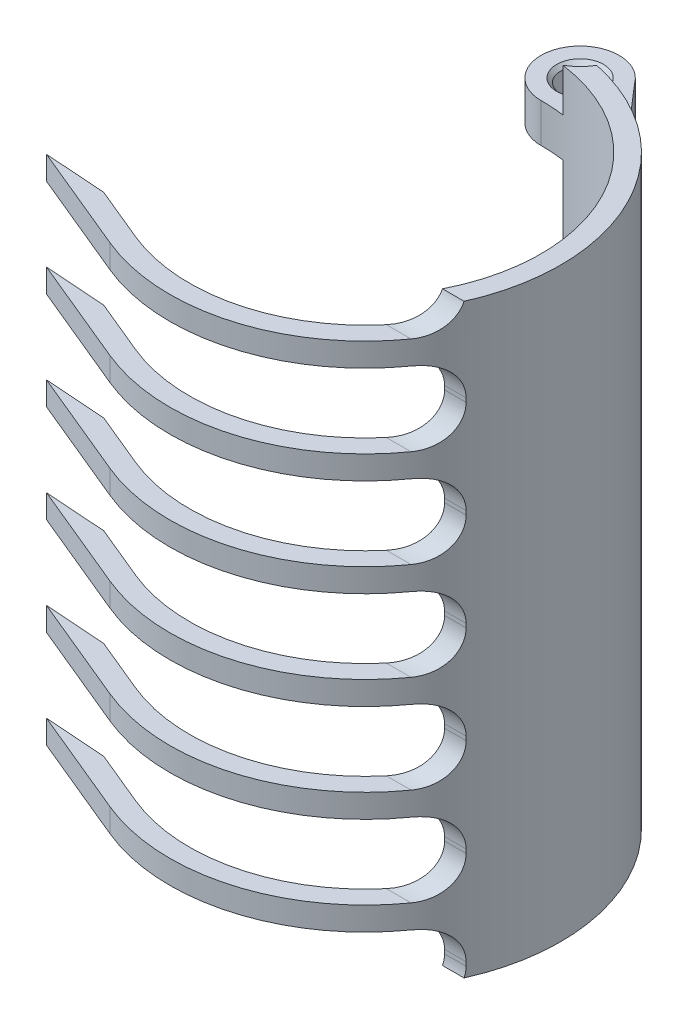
ISO-10303-21;
HEADER;
FILE_DESCRIPTION(('STEP AP214'),'2;1');
FILE_NAME('part.step','',(''),(''),'','','');
FILE_SCHEMA(('AUTOMOTIVE_DESIGN { 1 0 10303 214 1 1 1 1 }'));
ENDSEC;
DATA;
#1=APPLICATION_CONTEXT('core data for automotive mechanical design processes');
#2=APPLICATION_PROTOCOL_DEFINITION('international standard','automotive_design',2000,#1);
#3=PRODUCT_CONTEXT('',#1,'mechanical');
#4=PRODUCT('Part','Part','',(#3));
#5=PRODUCT_RELATED_PRODUCT_CATEGORY('part','',(#4));
#6=PRODUCT_DEFINITION_FORMATION('','',#4);
#7=PRODUCT_DEFINITION_CONTEXT('part definition',#1,'design');
#8=PRODUCT_DEFINITION('design','',#6,#7);
#9=PRODUCT_DEFINITION_SHAPE('','',#8);
#10=(LENGTH_UNIT() NAMED_UNIT(*) SI_UNIT(.MILLI.,.METRE.));
#11=(NAMED_UNIT(*) PLANE_ANGLE_UNIT() SI_UNIT($,.RADIAN.));
#12=(NAMED_UNIT(*) SI_UNIT($,.STERADIAN.) SOLID_ANGLE_UNIT());
#13=UNCERTAINTY_MEASURE_WITH_UNIT(LENGTH_MEASURE(1.E-05),#10,'distance_accuracy_value','');
#14=(GEOMETRIC_REPRESENTATION_CONTEXT(3) GLOBAL_UNCERTAINTY_ASSIGNED_CONTEXT((#13)) GLOBAL_UNIT_ASSIGNED_CONTEXT((#10,
#11,#12)) REPRESENTATION_CONTEXT('',''));
#15=CARTESIAN_POINT('',(0.,0.,0.));
#16=DIRECTION('',(0.,0.,1.));
#17=DIRECTION('',(1.,0.,0.));
#18=AXIS2_PLACEMENT_3D('',#15,#16,#17);
#19=CARTESIAN_POINT('',(0.,150.,0.));
#20=DIRECTION('',(0.,-1.,0.));
#21=DIRECTION('',(0.,0.,-1.));
#22=AXIS2_PLACEMENT_3D('',#19,#20,#21);
#23=CYLINDRICAL_SURFACE('',#22,45.);
#24=CARTESIAN_POINT('',(0.,21.,0.));
#25=DIRECTION('',(0.,1.,0.));
#26=DIRECTION('',(0.,0.,1.));
#27=AXIS2_PLACEMENT_3D('',#24,#25,#26);
#28=CIRCLE('',#27,45.);
#29=CARTESIAN_POINT('',(0.,21.,-45.));
#30=VERTEX_POINT('',#29);
#31=CARTESIAN_POINT('',(5.98665181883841,21.,-44.6));
#32=VERTEX_POINT('',#31);
#33=EDGE_CURVE('E449',#30,#32,#28,.F.);
#34=ORIENTED_EDGE('',*,*,#33,.F.);
#35=DIRECTION('',(0.,-1.,0.));
#36=VECTOR('',#35,1.);
#37=CARTESIAN_POINT('',(0.,150.,-45.));
#38=LINE('',#37,#36);
#39=CARTESIAN_POINT('',(0.,11.,-45.));
#40=VERTEX_POINT('',#39);
#41=EDGE_CURVE('E804',#30,#40,#38,.T.);
#42=ORIENTED_EDGE('',*,*,#41,.T.);
#43=CARTESIAN_POINT('',(0.,11.,0.));
#44=DIRECTION('',(0.,1.,0.));
#45=DIRECTION('',(0.,0.,1.));
#46=AXIS2_PLACEMENT_3D('',#43,#44,#45);
#47=CIRCLE('',#46,45.);
#48=CARTESIAN_POINT('',(5.98665181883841,11.,-44.6));
#49=VERTEX_POINT('',#48);
#50=EDGE_CURVE('E1736',#40,#49,#47,.F.);
#51=ORIENTED_EDGE('',*,*,#50,.T.);
#52=DIRECTION('',(0.,1.,0.));
#53=VECTOR('',#52,1.);
#54=CARTESIAN_POINT('',(5.98665181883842,5.49999999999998,-44.6));
#55=LINE('',#54,#53);
#56=CARTESIAN_POINT('',(5.98665181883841,0.,-44.6));
#57=VERTEX_POINT('',#56);
#58=EDGE_CURVE('E1717',#49,#57,#55,.F.);
#59=ORIENTED_EDGE('',*,*,#58,.T.);
#60=CARTESIAN_POINT('',(0.,0.,0.));
#61=DIRECTION('',(0.,-1.,0.));
#62=DIRECTION('',(0.,0.,1.));
#63=AXIS2_PLACEMENT_3D('',#60,#61,#62);
#64=CIRCLE('',#63,45.);
#65=CARTESIAN_POINT('',(40.1336128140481,0.,20.3541917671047));
#66=VERTEX_POINT('',#65);
#67=EDGE_CURVE('E797',#57,#66,#64,.T.);
#68=ORIENTED_EDGE('',*,*,#67,.T.);
#69=CARTESIAN_POINT('',(40.1336128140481,0.,20.3541917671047));
#70=CARTESIAN_POINT('',(40.1632523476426,0.20208273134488,20.2957326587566));
#71=CARTESIAN_POINT('',(40.1892051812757,0.406732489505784,20.2442602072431));
#72=CARTESIAN_POINT('',(40.2335664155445,0.818646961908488,20.1559601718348));
#73=CARTESIAN_POINT('',(40.2520199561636,1.02588805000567,20.1190450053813));
#74=CARTESIAN_POINT('',(40.281574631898,1.44296959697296,20.0598069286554));
#75=CARTESIAN_POINT('',(40.2926756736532,1.65281008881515,20.0374842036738));
#76=CARTESIAN_POINT('',(40.3075564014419,2.07509319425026,20.0075228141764));
#77=CARTESIAN_POINT('',(40.3112906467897,2.28754387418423,19.9999752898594));
#78=CARTESIAN_POINT('',(40.3112887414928,2.50000000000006,20.));
#79=B_SPLINE_CURVE_WITH_KNOTS('',3,(#69,#70,#71,#72,#73,#74,#75,#76,#77,#78),.UNSPECIFIED.,.F.,
.F.,(4,2,2,2,4),(0.,0.637185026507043,1.27047576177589,1.90377453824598,2.54096763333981),.UNSPECIFIED.);
#80=CARTESIAN_POINT('',(40.3112887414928,2.50000000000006,20.));
#81=VERTEX_POINT('',#80);
#82=EDGE_CURVE('E562',#66,#81,#79,.T.);
#83=ORIENTED_EDGE('',*,*,#82,.T.);
#84=DIRECTION('',(0.,-1.,0.));
#85=VECTOR('',#84,1.);
#86=CARTESIAN_POINT('',(40.3112887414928,150.,20.));
#87=LINE('',#86,#85);
#88=CARTESIAN_POINT('',(40.3112887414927,3.50000000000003,20.));
#89=VERTEX_POINT('',#88);
#90=EDGE_CURVE('E611',#81,#89,#87,.F.);
#91=ORIENTED_EDGE('',*,*,#90,.T.);
#92=CARTESIAN_POINT('',(40.3112887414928,3.50000000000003,20.));
#93=CARTESIAN_POINT('',(40.3112918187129,3.73145054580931,19.9999624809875));
#94=CARTESIAN_POINT('',(40.3068594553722,3.96289223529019,20.0089265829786));
#95=CARTESIAN_POINT('',(40.2891468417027,4.42402669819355,20.0445847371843));
#96=CARTESIAN_POINT('',(40.2758680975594,4.65371976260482,20.0712757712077));
#97=CARTESIAN_POINT('',(40.240531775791,5.10911195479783,20.1420224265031));
#98=CARTESIAN_POINT('',(40.2184971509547,5.33481992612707,20.1860326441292));
#99=CARTESIAN_POINT('',(40.1656941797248,5.78124421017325,20.2908963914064));
#100=CARTESIAN_POINT('',(40.1349257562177,6.00196047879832,20.3517500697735));
#101=CARTESIAN_POINT('',(40.064728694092,6.43683936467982,20.4895944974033));
#102=CARTESIAN_POINT('',(40.0253012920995,6.65100291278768,20.5665829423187));
#103=CARTESIAN_POINT('',(39.9378799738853,7.07140131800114,20.7358339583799));
#104=CARTESIAN_POINT('',(39.8898857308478,7.27763587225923,20.8280971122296));
#105=CARTESIAN_POINT('',(39.7854555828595,7.68091766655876,21.0268904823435));
#106=CARTESIAN_POINT('',(39.7290183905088,7.87796349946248,21.1334228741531));
#107=CARTESIAN_POINT('',(39.6078779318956,8.26170935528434,21.3595986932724));
#108=CARTESIAN_POINT('',(39.5431745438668,8.44840922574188,21.4792423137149));
#109=CARTESIAN_POINT('',(39.4038902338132,8.81530581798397,21.7337300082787));
#110=CARTESIAN_POINT('',(39.3290930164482,8.99519915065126,21.8688928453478));
#111=CARTESIAN_POINT('',(39.1712849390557,9.34223667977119,22.1503150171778));
#112=CARTESIAN_POINT('',(39.0882739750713,9.50938071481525,22.2965744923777));
#113=CARTESIAN_POINT('',(38.9143555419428,9.83028585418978,22.5987458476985));
#114=CARTESIAN_POINT('',(38.8234480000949,9.98404683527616,22.7546578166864));
#115=CARTESIAN_POINT('',(38.6340624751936,10.2777984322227,23.0747440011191));
#116=CARTESIAN_POINT('',(38.53558169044,10.4177839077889,23.2389212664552));
#117=CARTESIAN_POINT('',(38.3223682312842,10.6955221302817,23.5890173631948));
#118=CARTESIAN_POINT('',(38.2069693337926,10.8319646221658,23.7755699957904));
#119=CARTESIAN_POINT('',(37.9681867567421,11.0880840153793,24.1550631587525));
#120=CARTESIAN_POINT('',(37.8448001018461,11.2077546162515,24.3480060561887));
#121=CARTESIAN_POINT('',(37.5906118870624,11.4304065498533,24.7386379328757));
#122=CARTESIAN_POINT('',(37.45980859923,11.5333839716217,24.9363280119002));
#123=CARTESIAN_POINT('',(37.1913483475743,11.7229186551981,25.3349835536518));
#124=CARTESIAN_POINT('',(37.0536890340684,11.809470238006,25.5359501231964));
#125=CARTESIAN_POINT('',(36.751287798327,11.9781377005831,25.9696487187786));
#126=CARTESIAN_POINT('',(36.5855524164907,12.0577024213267,26.2026811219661));
#127=CARTESIAN_POINT('',(36.2466439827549,12.1964514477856,26.6695343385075));
#128=CARTESIAN_POINT('',(36.0734675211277,12.2556262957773,26.9033554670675));
#129=CARTESIAN_POINT('',(35.7207482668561,12.3543615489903,27.3699398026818));
#130=CARTESIAN_POINT('',(35.5412116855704,12.3939405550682,27.6027038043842));
#131=CARTESIAN_POINT('',(35.1764007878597,12.4544676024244,28.0661320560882));
#132=CARTESIAN_POINT('',(34.991126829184,12.4754168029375,28.296796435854));
#133=CARTESIAN_POINT('',(34.7382528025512,12.491694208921,28.6053207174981));
#134=CARTESIAN_POINT('',(34.6728116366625,12.4948200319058,28.6846075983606));
#135=CARTESIAN_POINT('',(34.5414378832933,12.4989714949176,28.8426699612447));
#136=CARTESIAN_POINT('',(34.4755059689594,12.499999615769,28.9214459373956));
#137=CARTESIAN_POINT('',(34.4093010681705,12.5,29.));
#138=B_SPLINE_CURVE_WITH_KNOTS('',3,(#92,#93,#94,#95,#96,#97,#98,#99,#100,#101,#102,#103,#104,
#105,#106,#107,#108,#109,#110,#111,#112,#113,#114,#115,#116,#117,#118,#119,#120,#121,#122,#123,
#124,#125,#126,#127,#128,#129,#130,#131,#132,#133,#134,#135,#136,#137),.UNSPECIFIED.,.F.,.F.,(4,
2,2,2,2,2,2,2,2,2,2,2,2,2,2,2,2,2,2,2,2,2,4),(0.,0.694122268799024,1.3881263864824,
2.08032310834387,2.77252594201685,3.46462998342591,4.15676043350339,4.84899652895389,
5.54124282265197,6.25183135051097,6.96242887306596,7.673032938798,8.38390116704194,
9.15810777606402,9.93260444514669,10.7072823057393,11.4822275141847,12.371834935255,
13.2618544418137,14.1510274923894,15.0401452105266,15.3486871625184,15.6568640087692),.UNSPECIFIED.);
#139=CARTESIAN_POINT('',(34.4093010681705,12.5,29.));
#140=VERTEX_POINT('',#139);
#141=EDGE_CURVE('E602',#89,#140,#138,.T.);
#142=ORIENTED_EDGE('',*,*,#141,.T.);
#143=CARTESIAN_POINT('',(0.,12.5,0.));
#144=DIRECTION('',(0.,1.,0.));
#145=DIRECTION('',(0.,0.,1.));
#146=AXIS2_PLACEMENT_3D('',#143,#144,#145);
#147=CIRCLE('',#146,45.);
#148=CARTESIAN_POINT('',(-17.2207544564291,12.5,41.5745789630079));
#149=VERTEX_POINT('',#148);
#150=EDGE_CURVE('E1401',#140,#149,#147,.F.);
#151=ORIENTED_EDGE('',*,*,#150,.T.);
#152=DIRECTION('',(0.,-1.,0.));
#153=VECTOR('',#152,1.);
#154=CARTESIAN_POINT('',(-17.2207544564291,150.,41.5745789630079));
#155=LINE('',#154,#153);
#156=CARTESIAN_POINT('',(-17.2207544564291,18.5,41.5745789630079));
#157=VERTEX_POINT('',#156);
#158=EDGE_CURVE('E826',#157,#149,#155,.T.);
#159=ORIENTED_EDGE('',*,*,#158,.F.);
#160=CARTESIAN_POINT('',(0.,18.5,0.));
#161=DIRECTION('',(0.,-1.,0.));
#162=DIRECTION('',(0.,0.,-1.));
#163=AXIS2_PLACEMENT_3D('',#160,#161,#162);
#164=CIRCLE('',#163,45.);
#165=CARTESIAN_POINT('',(34.4093010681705,18.5,29.));
#166=VERTEX_POINT('',#165);
#167=EDGE_CURVE('E1388',#157,#166,#164,.F.);
#168=ORIENTED_EDGE('',*,*,#167,.T.);
#169=CARTESIAN_POINT('',(34.4093010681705,18.5,29.));
#170=CARTESIAN_POINT('',(34.5320797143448,18.5000031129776,28.8543216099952));
#171=CARTESIAN_POINT('',(34.6539207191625,18.5035375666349,28.7078738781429));
#172=CARTESIAN_POINT('',(34.8955758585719,18.5179123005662,28.4136415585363));
#173=CARTESIAN_POINT('',(35.0153897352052,18.5287535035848,28.2658568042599));
#174=CARTESIAN_POINT('',(35.3718780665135,18.5726452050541,27.8204042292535));
#175=CARTESIAN_POINT('',(35.6052247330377,18.6170652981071,27.5210825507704));
#176=CARTESIAN_POINT('',(36.062569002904,18.7384652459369,26.919043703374));
#177=CARTESIAN_POINT('',(36.2865038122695,18.8156343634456,26.6163169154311));
#178=CARTESIAN_POINT('',(36.7216458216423,19.0043714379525,26.0126683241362));
#179=CARTESIAN_POINT('',(36.9328631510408,19.1159115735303,25.7117452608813));
#180=CARTESIAN_POINT('',(37.2874625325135,19.3410301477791,25.1935792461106));
#181=CARTESIAN_POINT('',(37.4341434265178,19.4464530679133,24.9750258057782));
#182=CARTESIAN_POINT('',(37.7188479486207,19.6773094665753,24.542929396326));
#183=CARTESIAN_POINT('',(37.8568735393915,19.8027383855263,24.3293852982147));
#184=CARTESIAN_POINT('',(38.1232129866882,20.0735053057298,23.9098772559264));
#185=CARTESIAN_POINT('',(38.2515495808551,20.2187942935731,23.703896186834));
#186=CARTESIAN_POINT('',(38.4981659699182,20.5294486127,23.3012222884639));
#187=CARTESIAN_POINT('',(38.6164457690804,20.6948139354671,23.104529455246));
#188=CARTESIAN_POINT('',(38.8431363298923,21.0465548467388,22.7213709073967));
#189=CARTESIAN_POINT('',(38.9514653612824,21.2330803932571,22.5349941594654));
#190=CARTESIAN_POINT('',(39.1566212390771,21.6253251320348,22.1766017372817));
#191=CARTESIAN_POINT('',(39.253447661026,21.8310450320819,22.0045865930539));
#192=CARTESIAN_POINT('',(39.4351043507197,22.2605579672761,21.6773522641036));
#193=CARTESIAN_POINT('',(39.5199290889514,22.4843592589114,21.5221408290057));
#194=CARTESIAN_POINT('',(39.6770829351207,22.9482961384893,21.2310261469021));
#195=CARTESIAN_POINT('',(39.7494141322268,23.1884289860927,21.0951196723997));
#196=CARTESIAN_POINT('',(39.8735359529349,23.6540421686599,20.8594520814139));
#197=CARTESIAN_POINT('',(39.9267395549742,23.8779511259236,20.7573225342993));
#198=CARTESIAN_POINT('',(40.0229745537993,24.3352674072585,20.5711569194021));
#199=CARTESIAN_POINT('',(40.0660070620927,24.5686736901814,20.487118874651));
#200=CARTESIAN_POINT('',(40.1417176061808,25.0427903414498,20.3383744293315));
#201=CARTESIAN_POINT('',(40.1744116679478,25.2834887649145,20.2736381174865));
#202=CARTESIAN_POINT('',(40.2294393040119,25.770457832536,20.1642246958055));
#203=CARTESIAN_POINT('',(40.2517779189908,26.016725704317,20.1195378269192));
#204=CARTESIAN_POINT('',(40.2830483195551,26.4691867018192,20.0568456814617));
#205=CARTESIAN_POINT('',(40.2936466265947,26.6748139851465,20.0355308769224));
#206=CARTESIAN_POINT('',(40.3077615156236,27.0869549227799,20.0071089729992));
#207=CARTESIAN_POINT('',(40.3112895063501,27.2934666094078,19.9999789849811));
#208=CARTESIAN_POINT('',(40.3112887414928,27.5,20.));
#209=B_SPLINE_CURVE_WITH_KNOTS('',3,(#169,#170,#171,#172,#173,#174,#175,#176,#177,#178,#179,
#180,#181,#182,#183,#184,#185,#186,#187,#188,#189,#190,#191,#192,#193,#194,#195,#196,#197,#198,
#199,#200,#201,#202,#203,#204,#205,#206,#207,#208),.UNSPECIFIED.,.F.,.F.,(4,2,2,2,2,2,2,2,2,2,2,
2,2,2,2,2,2,2,2,4),(0.,0.571477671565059,1.14302752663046,2.28786553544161,3.43941186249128,
4.59002851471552,5.43985160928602,6.28948129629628,7.13705078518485,7.98461991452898,
8.83862284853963,9.69265728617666,10.5470839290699,11.401367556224,12.1557299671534,
12.9100099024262,13.6631148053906,14.4158527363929,15.036260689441,15.6556667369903),.UNSPECIFIED.);
#210=CARTESIAN_POINT('',(40.3112887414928,27.5000000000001,20.));
#211=VERTEX_POINT('',#210);
#212=EDGE_CURVE('E638',#166,#211,#209,.T.);
#213=ORIENTED_EDGE('',*,*,#212,.T.);
#214=DIRECTION('',(0.,-1.,0.));
#215=VECTOR('',#214,1.);
#216=CARTESIAN_POINT('',(40.3112887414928,150.,20.));
#217=LINE('',#216,#215);
#218=CARTESIAN_POINT('',(40.3112887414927,28.5,20.));
#219=VERTEX_POINT('',#218);
#220=EDGE_CURVE('E1386',#211,#219,#217,.F.);
#221=ORIENTED_EDGE('',*,*,#220,.T.);
#222=CARTESIAN_POINT('',(40.3112887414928,28.5,20.));
#223=CARTESIAN_POINT('',(40.3112918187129,28.7314505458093,19.9999624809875));
#224=CARTESIAN_POINT('',(40.3068594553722,28.9628922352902,20.0089265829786));
#225=CARTESIAN_POINT('',(40.2891468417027,29.4240266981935,20.0445847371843));
#226=CARTESIAN_POINT('',(40.2758680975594,29.6537197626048,20.0712757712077));
#227=CARTESIAN_POINT('',(40.240531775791,30.1091119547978,20.1420224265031));
#228=CARTESIAN_POINT('',(40.2184971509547,30.3348199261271,20.1860326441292));
#229=CARTESIAN_POINT('',(40.1656941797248,30.7812442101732,20.2908963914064));
#230=CARTESIAN_POINT('',(40.1349257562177,31.0019604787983,20.3517500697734));
#231=CARTESIAN_POINT('',(40.064728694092,31.4368393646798,20.4895944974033));
#232=CARTESIAN_POINT('',(40.0253012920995,31.6510029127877,20.5665829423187));
#233=CARTESIAN_POINT('',(39.9378799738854,32.0714013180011,20.7358339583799));
#234=CARTESIAN_POINT('',(39.8898857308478,32.2776358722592,20.8280971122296));
#235=CARTESIAN_POINT('',(39.7854555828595,32.6809176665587,21.0268904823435));
#236=CARTESIAN_POINT('',(39.7290183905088,32.8779634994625,21.1334228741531));
#237=CARTESIAN_POINT('',(39.6078779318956,33.2617093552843,21.3595986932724));
#238=CARTESIAN_POINT('',(39.5431745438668,33.4484092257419,21.4792423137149));
#239=CARTESIAN_POINT('',(39.4038902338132,33.815305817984,21.7337300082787));
#240=CARTESIAN_POINT('',(39.3290930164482,33.9951991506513,21.8688928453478));
#241=CARTESIAN_POINT('',(39.1712849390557,34.3422366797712,22.1503150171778));
#242=CARTESIAN_POINT('',(39.0882739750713,34.5093807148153,22.2965744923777));
#243=CARTESIAN_POINT('',(38.9143555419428,34.8302858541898,22.5987458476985));
#244=CARTESIAN_POINT('',(38.8234480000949,34.9840468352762,22.7546578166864));
#245=CARTESIAN_POINT('',(38.6340624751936,35.2777984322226,23.0747440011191));
#246=CARTESIAN_POINT('',(38.53558169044,35.4177839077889,23.2389212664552));
#247=CARTESIAN_POINT('',(38.3223682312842,35.6955221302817,23.5890173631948));
#248=CARTESIAN_POINT('',(38.2069693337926,35.8319646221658,23.7755699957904));
#249=CARTESIAN_POINT('',(37.9681867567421,36.0880840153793,24.1550631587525));
#250=CARTESIAN_POINT('',(37.8448001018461,36.2077546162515,24.3480060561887));
#251=CARTESIAN_POINT('',(37.5906118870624,36.4304065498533,24.7386379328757));
#252=CARTESIAN_POINT('',(37.45980859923,36.5333839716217,24.9363280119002));
#253=CARTESIAN_POINT('',(37.1913483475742,36.7229186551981,25.3349835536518));
#254=CARTESIAN_POINT('',(37.0536890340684,36.809470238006,25.5359501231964));
#255=CARTESIAN_POINT('',(36.751287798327,36.9781377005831,25.9696487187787));
#256=CARTESIAN_POINT('',(36.5855524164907,37.0577024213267,26.2026811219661));
#257=CARTESIAN_POINT('',(36.2466439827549,37.1964514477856,26.6695343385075));
#258=CARTESIAN_POINT('',(36.0734675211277,37.2556262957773,26.9033554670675));
#259=CARTESIAN_POINT('',(35.7207482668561,37.3543615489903,27.3699398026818));
#260=CARTESIAN_POINT('',(35.5412116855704,37.3939405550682,27.6027038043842));
#261=CARTESIAN_POINT('',(35.1764007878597,37.4544676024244,28.0661320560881));
#262=CARTESIAN_POINT('',(34.991126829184,37.4754168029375,28.296796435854));
#263=CARTESIAN_POINT('',(34.7382528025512,37.491694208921,28.6053207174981));
#264=CARTESIAN_POINT('',(34.6728116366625,37.4948200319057,28.6846075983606));
#265=CARTESIAN_POINT('',(34.5414378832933,37.4989714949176,28.8426699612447));
#266=CARTESIAN_POINT('',(34.4755059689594,37.499999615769,28.9214459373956));
#267=CARTESIAN_POINT('',(34.4093010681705,37.5,29.));
#268=B_SPLINE_CURVE_WITH_KNOTS('',3,(#222,#223,#224,#225,#226,#227,#228,#229,#230,#231,#232,
#233,#234,#235,#236,#237,#238,#239,#240,#241,#242,#243,#244,#245,#246,#247,#248,#249,#250,#251,
#252,#253,#254,#255,#256,#257,#258,#259,#260,#261,#262,#263,#264,#265,#266,#267),.UNSPECIFIED.,
.F.,.F.,(4,2,2,2,2,2,2,2,2,2,2,2,2,2,2,2,2,2,2,2,2,2,4),(0.,0.694122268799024,1.3881263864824,
2.08032310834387,2.77252594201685,3.4646299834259,4.15676043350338,4.84899652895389,
5.54124282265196,6.25183135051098,6.96242887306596,7.673032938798,8.38390116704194,
9.15810777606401,9.93260444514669,10.7072823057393,11.4822275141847,12.371834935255,
13.2618544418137,14.1510274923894,15.0401452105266,15.3486871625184,15.6568640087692),.UNSPECIFIED.);
#269=CARTESIAN_POINT('',(34.4093010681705,37.5,29.));
#270=VERTEX_POINT('',#269);
#271=EDGE_CURVE('E648',#219,#270,#268,.T.);
#272=ORIENTED_EDGE('',*,*,#271,.T.);
#273=CARTESIAN_POINT('',(0.,37.5,0.));
#274=DIRECTION('',(0.,1.,0.));
#275=DIRECTION('',(0.,0.,1.));
#276=AXIS2_PLACEMENT_3D('',#273,#274,#275);
#277=CIRCLE('',#276,45.);
#278=CARTESIAN_POINT('',(-17.2207544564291,37.5,41.5745789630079));
#279=VERTEX_POINT('',#278);
#280=EDGE_CURVE('E1046',#270,#279,#277,.F.);
#281=ORIENTED_EDGE('',*,*,#280,.T.);
#282=CARTESIAN_POINT('',(-17.2207544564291,43.5,41.5745789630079));
#283=VERTEX_POINT('',#282);
#284=EDGE_CURVE('E829',#283,#279,#155,.T.);
#285=ORIENTED_EDGE('',*,*,#284,.F.);
#286=CARTESIAN_POINT('',(0.,43.5,0.));
#287=DIRECTION('',(0.,-1.,0.));
#288=DIRECTION('',(0.,0.,-1.));
#289=AXIS2_PLACEMENT_3D('',#286,#287,#288);
#290=CIRCLE('',#289,45.);
#291=CARTESIAN_POINT('',(34.4093010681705,43.5,29.));
#292=VERTEX_POINT('',#291);
#293=EDGE_CURVE('E1044',#283,#292,#290,.F.);
#294=ORIENTED_EDGE('',*,*,#293,.T.);
#295=CARTESIAN_POINT('',(34.4093010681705,43.5,29.));
#296=CARTESIAN_POINT('',(34.5320797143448,43.5000031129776,28.8543216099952));
#297=CARTESIAN_POINT('',(34.6539207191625,43.5035375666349,28.7078738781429));
#298=CARTESIAN_POINT('',(34.8955758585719,43.5179123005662,28.4136415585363));
#299=CARTESIAN_POINT('',(35.0153897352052,43.5287535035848,28.2658568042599));
#300=CARTESIAN_POINT('',(35.3718780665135,43.5726452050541,27.8204042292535));
#301=CARTESIAN_POINT('',(35.6052247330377,43.6170652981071,27.5210825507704));
#302=CARTESIAN_POINT('',(36.062569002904,43.7384652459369,26.919043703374));
#303=CARTESIAN_POINT('',(36.2865038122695,43.8156343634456,26.6163169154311));
#304=CARTESIAN_POINT('',(36.7216458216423,44.0043714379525,26.0126683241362));
#305=CARTESIAN_POINT('',(36.9328631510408,44.1159115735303,25.7117452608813));
#306=CARTESIAN_POINT('',(37.2874625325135,44.3410301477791,25.1935792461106));
#307=CARTESIAN_POINT('',(37.4341434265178,44.4464530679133,24.9750258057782));
#308=CARTESIAN_POINT('',(37.7188479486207,44.6773094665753,24.542929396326));
#309=CARTESIAN_POINT('',(37.8568735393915,44.8027383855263,24.3293852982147));
#310=CARTESIAN_POINT('',(38.1232129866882,45.0735053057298,23.9098772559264));
#311=CARTESIAN_POINT('',(38.2515495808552,45.2187942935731,23.703896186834));
#312=CARTESIAN_POINT('',(38.4981659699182,45.5294486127,23.3012222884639));
#313=CARTESIAN_POINT('',(38.6164457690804,45.6948139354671,23.104529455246));
#314=CARTESIAN_POINT('',(38.8431363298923,46.0465548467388,22.7213709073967));
#315=CARTESIAN_POINT('',(38.9514653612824,46.2330803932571,22.5349941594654));
#316=CARTESIAN_POINT('',(39.1566212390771,46.6253251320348,22.1766017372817));
#317=CARTESIAN_POINT('',(39.253447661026,46.8310450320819,22.0045865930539));
#318=CARTESIAN_POINT('',(39.4351043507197,47.2605579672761,21.6773522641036));
#319=CARTESIAN_POINT('',(39.5199290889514,47.4843592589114,21.5221408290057));
#320=CARTESIAN_POINT('',(39.6770829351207,47.9482961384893,21.2310261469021));
#321=CARTESIAN_POINT('',(39.7494141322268,48.1884289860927,21.0951196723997));
#322=CARTESIAN_POINT('',(39.8735359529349,48.6540421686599,20.8594520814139));
#323=CARTESIAN_POINT('',(39.9267395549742,48.8779511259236,20.7573225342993));
#324=CARTESIAN_POINT('',(40.0229745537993,49.3352674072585,20.5711569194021));
#325=CARTESIAN_POINT('',(40.0660070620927,49.5686736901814,20.487118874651));
#326=CARTESIAN_POINT('',(40.1417176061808,50.0427903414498,20.3383744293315));
#327=CARTESIAN_POINT('',(40.1744116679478,50.2834887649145,20.2736381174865));
#328=CARTESIAN_POINT('',(40.2294393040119,50.770457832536,20.1642246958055));
#329=CARTESIAN_POINT('',(40.2517779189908,51.016725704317,20.1195378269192));
#330=CARTESIAN_POINT('',(40.2830483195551,51.4691867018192,20.0568456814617));
#331=CARTESIAN_POINT('',(40.2936466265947,51.6748139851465,20.0355308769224));
#332=CARTESIAN_POINT('',(40.3077615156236,52.0869549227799,20.0071089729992));
#333=CARTESIAN_POINT('',(40.3112895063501,52.2934666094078,19.9999789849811));
#334=CARTESIAN_POINT('',(40.3112887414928,52.5,20.));
#335=B_SPLINE_CURVE_WITH_KNOTS('',3,(#295,#296,#297,#298,#299,#300,#301,#302,#303,#304,#305,
#306,#307,#308,#309,#310,#311,#312,#313,#314,#315,#316,#317,#318,#319,#320,#321,#322,#323,#324,
#325,#326,#327,#328,#329,#330,#331,#332,#333,#334),.UNSPECIFIED.,.F.,.F.,(4,2,2,2,2,2,2,2,2,2,2,
2,2,2,2,2,2,2,2,4),(0.,0.571477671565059,1.14302752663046,2.28786553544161,3.43941186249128,
4.59002851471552,5.43985160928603,6.28948129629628,7.13705078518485,7.98461991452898,
8.83862284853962,9.69265728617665,10.5470839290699,11.401367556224,12.1557299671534,
12.9100099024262,13.6631148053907,14.4158527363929,15.036260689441,15.6556667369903),.UNSPECIFIED.);
#336=CARTESIAN_POINT('',(40.3112887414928,52.5,20.));
#337=VERTEX_POINT('',#336);
#338=EDGE_CURVE('E656',#292,#337,#335,.T.);
#339=ORIENTED_EDGE('',*,*,#338,.T.);
#340=DIRECTION('',(0.,-1.,0.));
#341=VECTOR('',#340,1.);
#342=CARTESIAN_POINT('',(40.3112887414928,150.,20.));
#343=LINE('',#342,#341);
#344=CARTESIAN_POINT('',(40.3112887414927,53.5,20.));
#345=VERTEX_POINT('',#344);
#346=EDGE_CURVE('E1061',#337,#345,#343,.F.);
#347=ORIENTED_EDGE('',*,*,#346,.T.);
#348=CARTESIAN_POINT('',(40.3112887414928,53.5,20.));
#349=CARTESIAN_POINT('',(40.3112918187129,53.7314505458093,19.9999624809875));
#350=CARTESIAN_POINT('',(40.3068594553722,53.9628922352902,20.0089265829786));
#351=CARTESIAN_POINT('',(40.2891468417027,54.4240266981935,20.0445847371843));
#352=CARTESIAN_POINT('',(40.2758680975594,54.6537197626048,20.0712757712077));
#353=CARTESIAN_POINT('',(40.240531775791,55.1091119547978,20.1420224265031));
#354=CARTESIAN_POINT('',(40.2184971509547,55.3348199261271,20.1860326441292));
#355=CARTESIAN_POINT('',(40.1656941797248,55.7812442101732,20.2908963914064));
#356=CARTESIAN_POINT('',(40.1349257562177,56.0019604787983,20.3517500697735));
#357=CARTESIAN_POINT('',(40.064728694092,56.4368393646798,20.4895944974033));
#358=CARTESIAN_POINT('',(40.0253012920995,56.6510029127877,20.5665829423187));
#359=CARTESIAN_POINT('',(39.9378799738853,57.0714013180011,20.7358339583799));
#360=CARTESIAN_POINT('',(39.8898857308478,57.2776358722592,20.8280971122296));
#361=CARTESIAN_POINT('',(39.7854555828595,57.6809176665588,21.0268904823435));
#362=CARTESIAN_POINT('',(39.7290183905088,57.8779634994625,21.1334228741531));
#363=CARTESIAN_POINT('',(39.6078779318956,58.2617093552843,21.3595986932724));
#364=CARTESIAN_POINT('',(39.5431745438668,58.4484092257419,21.4792423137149));
#365=CARTESIAN_POINT('',(39.4038902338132,58.815305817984,21.7337300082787));
#366=CARTESIAN_POINT('',(39.3290930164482,58.9951991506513,21.8688928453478));
#367=CARTESIAN_POINT('',(39.1712849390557,59.3422366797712,22.1503150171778));
#368=CARTESIAN_POINT('',(39.0882739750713,59.5093807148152,22.2965744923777));
#369=CARTESIAN_POINT('',(38.9143555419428,59.8302858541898,22.5987458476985));
#370=CARTESIAN_POINT('',(38.8234480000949,59.9840468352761,22.7546578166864));
#371=CARTESIAN_POINT('',(38.6340624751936,60.2777984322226,23.0747440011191));
#372=CARTESIAN_POINT('',(38.53558169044,60.4177839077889,23.2389212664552));
#373=CARTESIAN_POINT('',(38.3223682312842,60.6955221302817,23.5890173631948));
#374=CARTESIAN_POINT('',(38.2069693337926,60.8319646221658,23.7755699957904));
#375=CARTESIAN_POINT('',(37.9681867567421,61.0880840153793,24.1550631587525));
#376=CARTESIAN_POINT('',(37.8448001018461,61.2077546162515,24.3480060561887));
#377=CARTESIAN_POINT('',(37.5906118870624,61.4304065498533,24.7386379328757));
#378=CARTESIAN_POINT('',(37.45980859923,61.5333839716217,24.9363280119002));
#379=CARTESIAN_POINT('',(37.1913483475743,61.7229186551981,25.3349835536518));
#380=CARTESIAN_POINT('',(37.0536890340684,61.809470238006,25.5359501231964));
#381=CARTESIAN_POINT('',(36.751287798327,61.9781377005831,25.9696487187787));
#382=CARTESIAN_POINT('',(36.5855524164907,62.0577024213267,26.2026811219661));
#383=CARTESIAN_POINT('',(36.2466439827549,62.1964514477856,26.6695343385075));
#384=CARTESIAN_POINT('',(36.0734675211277,62.2556262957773,26.9033554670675));
#385=CARTESIAN_POINT('',(35.7207482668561,62.3543615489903,27.3699398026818));
#386=CARTESIAN_POINT('',(35.5412116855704,62.3939405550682,27.6027038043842));
#387=CARTESIAN_POINT('',(35.1764007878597,62.4544676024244,28.0661320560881));
#388=CARTESIAN_POINT('',(34.991126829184,62.4754168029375,28.296796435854));
#389=CARTESIAN_POINT('',(34.7382528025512,62.491694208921,28.6053207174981));
#390=CARTESIAN_POINT('',(34.6728116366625,62.4948200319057,28.6846075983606));
#391=CARTESIAN_POINT('',(34.5414378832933,62.4989714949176,28.8426699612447));
#392=CARTESIAN_POINT('',(34.4755059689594,62.499999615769,28.9214459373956));
#393=CARTESIAN_POINT('',(34.4093010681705,62.5,29.));
#394=B_SPLINE_CURVE_WITH_KNOTS('',3,(#348,#349,#350,#351,#352,#353,#354,#355,#356,#357,#358,
#359,#360,#361,#362,#363,#364,#365,#366,#367,#368,#369,#370,#371,#372,#373,#374,#375,#376,#377,
#378,#379,#380,#381,#382,#383,#384,#385,#386,#387,#388,#389,#390,#391,#392,#393),.UNSPECIFIED.,
.F.,.F.,(4,2,2,2,2,2,2,2,2,2,2,2,2,2,2,2,2,2,2,2,2,2,4),(0.,0.694122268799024,1.3881263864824,
2.08032310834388,2.77252594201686,3.46462998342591,4.1567604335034,4.8489965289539,
5.54124282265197,6.25183135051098,6.96242887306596,7.673032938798,8.38390116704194,
9.15810777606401,9.93260444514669,10.7072823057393,11.4822275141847,12.371834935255,
13.2618544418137,14.1510274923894,15.0401452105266,15.3486871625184,15.6568640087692),.UNSPECIFIED.);
#395=CARTESIAN_POINT('',(34.4093010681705,62.5,29.));
#396=VERTEX_POINT('',#395);
#397=EDGE_CURVE('E666',#345,#396,#394,.T.);
#398=ORIENTED_EDGE('',*,*,#397,.T.);
#399=CARTESIAN_POINT('',(0.,62.5,0.));
#400=DIRECTION('',(0.,1.,0.));
#401=DIRECTION('',(0.,0.,1.));
#402=AXIS2_PLACEMENT_3D('',#399,#400,#401);
#403=CIRCLE('',#402,45.);
#404=CARTESIAN_POINT('',(-17.2207544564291,62.5,41.5745789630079));
#405=VERTEX_POINT('',#404);
#406=EDGE_CURVE('E1077',#396,#405,#403,.F.);
#407=ORIENTED_EDGE('',*,*,#406,.T.);
#408=CARTESIAN_POINT('',(-17.2207544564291,68.5,41.5745789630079));
#409=VERTEX_POINT('',#408);
#410=EDGE_CURVE('E1021',#409,#405,#155,.T.);
#411=ORIENTED_EDGE('',*,*,#410,.F.);
#412=CARTESIAN_POINT('',(0.,68.5,0.));
#413=DIRECTION('',(0.,-1.,0.));
#414=DIRECTION('',(0.,0.,-1.));
#415=AXIS2_PLACEMENT_3D('',#412,#413,#414);
#416=CIRCLE('',#415,45.);
#417=CARTESIAN_POINT('',(34.4093010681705,68.5,29.));
#418=VERTEX_POINT('',#417);
#419=EDGE_CURVE('E1086',#409,#418,#416,.F.);
#420=ORIENTED_EDGE('',*,*,#419,.T.);
#421=CARTESIAN_POINT('',(34.4093010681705,68.5,29.));
#422=CARTESIAN_POINT('',(34.5320797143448,68.5000031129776,28.8543216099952));
#423=CARTESIAN_POINT('',(34.6539207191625,68.5035375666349,28.7078738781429));
#424=CARTESIAN_POINT('',(34.8955758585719,68.5179123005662,28.4136415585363));
#425=CARTESIAN_POINT('',(35.0153897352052,68.5287535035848,28.2658568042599));
#426=CARTESIAN_POINT('',(35.3718780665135,68.5726452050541,27.8204042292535));
#427=CARTESIAN_POINT('',(35.6052247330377,68.6170652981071,27.5210825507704));
#428=CARTESIAN_POINT('',(36.062569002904,68.7384652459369,26.919043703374));
#429=CARTESIAN_POINT('',(36.2865038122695,68.8156343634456,26.6163169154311));
#430=CARTESIAN_POINT('',(36.7216458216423,69.0043714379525,26.0126683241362));
#431=CARTESIAN_POINT('',(36.9328631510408,69.1159115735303,25.7117452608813));
#432=CARTESIAN_POINT('',(37.2874625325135,69.3410301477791,25.1935792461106));
#433=CARTESIAN_POINT('',(37.4341434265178,69.4464530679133,24.9750258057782));
#434=CARTESIAN_POINT('',(37.7188479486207,69.6773094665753,24.542929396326));
#435=CARTESIAN_POINT('',(37.8568735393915,69.8027383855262,24.3293852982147));
#436=CARTESIAN_POINT('',(38.1232129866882,70.0735053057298,23.9098772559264));
#437=CARTESIAN_POINT('',(38.2515495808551,70.2187942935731,23.703896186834));
#438=CARTESIAN_POINT('',(38.4981659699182,70.5294486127,23.3012222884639));
#439=CARTESIAN_POINT('',(38.6164457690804,70.6948139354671,23.104529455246));
#440=CARTESIAN_POINT('',(38.8431363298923,71.0465548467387,22.7213709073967));
#441=CARTESIAN_POINT('',(38.9514653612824,71.2330803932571,22.5349941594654));
#442=CARTESIAN_POINT('',(39.1566212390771,71.6253251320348,22.1766017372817));
#443=CARTESIAN_POINT('',(39.253447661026,71.8310450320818,22.0045865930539));
#444=CARTESIAN_POINT('',(39.4351043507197,72.2605579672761,21.6773522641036));
#445=CARTESIAN_POINT('',(39.5199290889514,72.4843592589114,21.5221408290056));
#446=CARTESIAN_POINT('',(39.6770829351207,72.9482961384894,21.2310261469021));
#447=CARTESIAN_POINT('',(39.7494141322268,73.1884289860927,21.0951196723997));
#448=CARTESIAN_POINT('',(39.8735359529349,73.6540421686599,20.8594520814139));
#449=CARTESIAN_POINT('',(39.9267395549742,73.8779511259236,20.7573225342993));
#450=CARTESIAN_POINT('',(40.0229745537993,74.3352674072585,20.5711569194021));
#451=CARTESIAN_POINT('',(40.0660070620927,74.5686736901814,20.487118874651));
#452=CARTESIAN_POINT('',(40.1417176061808,75.0427903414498,20.3383744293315));
#453=CARTESIAN_POINT('',(40.1744116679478,75.2834887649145,20.2736381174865));
#454=CARTESIAN_POINT('',(40.2294393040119,75.770457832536,20.1642246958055));
#455=CARTESIAN_POINT('',(40.2517779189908,76.016725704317,20.1195378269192));
#456=CARTESIAN_POINT('',(40.2830483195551,76.4691867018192,20.0568456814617));
#457=CARTESIAN_POINT('',(40.2936466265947,76.6748139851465,20.0355308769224));
#458=CARTESIAN_POINT('',(40.3077615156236,77.0869549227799,20.0071089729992));
#459=CARTESIAN_POINT('',(40.3112895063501,77.2934666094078,19.9999789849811));
#460=CARTESIAN_POINT('',(40.3112887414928,77.5000000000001,20.));
#461=B_SPLINE_CURVE_WITH_KNOTS('',3,(#421,#422,#423,#424,#425,#426,#427,#428,#429,#430,#431,
#432,#433,#434,#435,#436,#437,#438,#439,#440,#441,#442,#443,#444,#445,#446,#447,#448,#449,#450,
#451,#452,#453,#454,#455,#456,#457,#458,#459,#460),.UNSPECIFIED.,.F.,.F.,(4,2,2,2,2,2,2,2,2,2,2,
2,2,2,2,2,2,2,2,4),(0.,0.571477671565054,1.14302752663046,2.2878655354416,3.43941186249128,
4.59002851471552,5.43985160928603,6.28948129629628,7.13705078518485,7.98461991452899,
8.83862284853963,9.69265728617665,10.5470839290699,11.401367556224,12.1557299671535,
12.9100099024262,13.6631148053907,14.4158527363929,15.0362606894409,15.6556667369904),.UNSPECIFIED.);
#462=CARTESIAN_POINT('',(40.3112887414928,77.5,20.));
#463=VERTEX_POINT('',#462);
#464=EDGE_CURVE('E675',#418,#463,#461,.T.);
#465=ORIENTED_EDGE('',*,*,#464,.T.);
#466=DIRECTION('',(0.,-1.,0.));
#467=VECTOR('',#466,1.);
#468=CARTESIAN_POINT('',(40.3112887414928,150.,20.));
#469=LINE('',#468,#467);
#470=CARTESIAN_POINT('',(40.3112887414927,78.5,20.));
#471=VERTEX_POINT('',#470);
#472=EDGE_CURVE('E1089',#463,#471,#469,.F.);
#473=ORIENTED_EDGE('',*,*,#472,.T.);
#474=CARTESIAN_POINT('',(40.3112887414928,78.5,20.));
#475=CARTESIAN_POINT('',(40.3112918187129,78.7314505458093,19.9999624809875));
#476=CARTESIAN_POINT('',(40.3068594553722,78.9628922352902,20.0089265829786));
#477=CARTESIAN_POINT('',(40.2891468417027,79.4240266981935,20.0445847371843));
#478=CARTESIAN_POINT('',(40.2758680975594,79.6537197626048,20.0712757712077));
#479=CARTESIAN_POINT('',(40.240531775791,80.1091119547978,20.1420224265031));
#480=CARTESIAN_POINT('',(40.2184971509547,80.334819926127,20.1860326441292));
#481=CARTESIAN_POINT('',(40.1656941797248,80.7812442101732,20.2908963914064));
#482=CARTESIAN_POINT('',(40.1349257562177,81.0019604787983,20.3517500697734));
#483=CARTESIAN_POINT('',(40.064728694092,81.4368393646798,20.4895944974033));
#484=CARTESIAN_POINT('',(40.0253012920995,81.6510029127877,20.5665829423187));
#485=CARTESIAN_POINT('',(39.9378799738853,82.0714013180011,20.7358339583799));
#486=CARTESIAN_POINT('',(39.8898857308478,82.2776358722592,20.8280971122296));
#487=CARTESIAN_POINT('',(39.7854555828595,82.6809176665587,21.0268904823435));
#488=CARTESIAN_POINT('',(39.7290183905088,82.8779634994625,21.1334228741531));
#489=CARTESIAN_POINT('',(39.6078779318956,83.2617093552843,21.3595986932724));
#490=CARTESIAN_POINT('',(39.5431745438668,83.4484092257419,21.4792423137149));
#491=CARTESIAN_POINT('',(39.4038902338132,83.815305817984,21.7337300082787));
#492=CARTESIAN_POINT('',(39.3290930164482,83.9951991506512,21.8688928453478));
#493=CARTESIAN_POINT('',(39.1712849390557,84.3422366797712,22.1503150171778));
#494=CARTESIAN_POINT('',(39.0882739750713,84.5093807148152,22.2965744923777));
#495=CARTESIAN_POINT('',(38.9143555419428,84.8302858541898,22.5987458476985));
#496=CARTESIAN_POINT('',(38.8234480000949,84.9840468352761,22.7546578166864));
#497=CARTESIAN_POINT('',(38.6340624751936,85.2777984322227,23.0747440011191));
#498=CARTESIAN_POINT('',(38.53558169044,85.4177839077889,23.2389212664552));
#499=CARTESIAN_POINT('',(38.3223682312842,85.6955221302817,23.5890173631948));
#500=CARTESIAN_POINT('',(38.2069693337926,85.8319646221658,23.7755699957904));
#501=CARTESIAN_POINT('',(37.9681867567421,86.0880840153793,24.1550631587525));
#502=CARTESIAN_POINT('',(37.8448001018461,86.2077546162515,24.3480060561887));
#503=CARTESIAN_POINT('',(37.5906118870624,86.4304065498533,24.7386379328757));
#504=CARTESIAN_POINT('',(37.45980859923,86.5333839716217,24.9363280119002));
#505=CARTESIAN_POINT('',(37.1913483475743,86.722918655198,25.3349835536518));
#506=CARTESIAN_POINT('',(37.0536890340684,86.809470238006,25.5359501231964));
#507=CARTESIAN_POINT('',(36.751287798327,86.978137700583,25.9696487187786));
#508=CARTESIAN_POINT('',(36.5855524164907,87.0577024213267,26.2026811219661));
#509=CARTESIAN_POINT('',(36.2466439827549,87.1964514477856,26.6695343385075));
#510=CARTESIAN_POINT('',(36.0734675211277,87.2556262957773,26.9033554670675));
#511=CARTESIAN_POINT('',(35.7207482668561,87.3543615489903,27.3699398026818));
#512=CARTESIAN_POINT('',(35.5412116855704,87.3939405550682,27.6027038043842));
#513=CARTESIAN_POINT('',(35.1764007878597,87.4544676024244,28.0661320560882));
#514=CARTESIAN_POINT('',(34.991126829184,87.4754168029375,28.296796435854));
#515=CARTESIAN_POINT('',(34.7382528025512,87.491694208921,28.6053207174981));
#516=CARTESIAN_POINT('',(34.6728116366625,87.4948200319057,28.6846075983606));
#517=CARTESIAN_POINT('',(34.5414378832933,87.4989714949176,28.8426699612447));
#518=CARTESIAN_POINT('',(34.4755059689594,87.499999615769,28.9214459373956));
#519=CARTESIAN_POINT('',(34.4093010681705,87.5,29.));
#520=B_SPLINE_CURVE_WITH_KNOTS('',3,(#474,#475,#476,#477,#478,#479,#480,#481,#482,#483,#484,
#485,#486,#487,#488,#489,#490,#491,#492,#493,#494,#495,#496,#497,#498,#499,#500,#501,#502,#503,
#504,#505,#506,#507,#508,#509,#510,#511,#512,#513,#514,#515,#516,#517,#518,#519),.UNSPECIFIED.,
.F.,.F.,(4,2,2,2,2,2,2,2,2,2,2,2,2,2,2,2,2,2,2,2,2,2,4),(0.,0.694122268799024,1.38812638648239,
2.08032310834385,2.77252594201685,3.46462998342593,4.1567604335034,4.84899652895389,
5.54124282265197,6.25183135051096,6.96242887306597,7.673032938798,8.38390116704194,
9.15810777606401,9.93260444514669,10.7072823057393,11.4822275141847,12.371834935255,
13.2618544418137,14.1510274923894,15.0401452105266,15.3486871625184,15.6568640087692),.UNSPECIFIED.);
#521=CARTESIAN_POINT('',(34.4093010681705,87.5,29.));
#522=VERTEX_POINT('',#521);
#523=EDGE_CURVE('E685',#471,#522,#520,.T.);
#524=ORIENTED_EDGE('',*,*,#523,.T.);
#525=CARTESIAN_POINT('',(0.,87.5,0.));
#526=DIRECTION('',(0.,1.,0.));
#527=DIRECTION('',(0.,0.,1.));
#528=AXIS2_PLACEMENT_3D('',#525,#526,#527);
#529=CIRCLE('',#528,45.);
#530=CARTESIAN_POINT('',(-17.2207544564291,87.5,41.5745789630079));
#531=VERTEX_POINT('',#530);
#532=EDGE_CURVE('E1105',#522,#531,#529,.F.);
#533=ORIENTED_EDGE('',*,*,#532,.T.);
#534=CARTESIAN_POINT('',(-17.2207544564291,93.5,41.5745789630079));
#535=VERTEX_POINT('',#534);
#536=EDGE_CURVE('E1015',#535,#531,#155,.T.);
#537=ORIENTED_EDGE('',*,*,#536,.F.);
#538=CARTESIAN_POINT('',(0.,93.5,0.));
#539=DIRECTION('',(0.,-1.,0.));
#540=DIRECTION('',(0.,0.,-1.));
#541=AXIS2_PLACEMENT_3D('',#538,#539,#540);
#542=CIRCLE('',#541,45.);
#543=CARTESIAN_POINT('',(34.4093010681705,93.5,29.));
#544=VERTEX_POINT('',#543);
#545=EDGE_CURVE('E1114',#535,#544,#542,.F.);
#546=ORIENTED_EDGE('',*,*,#545,.T.);
#547=CARTESIAN_POINT('',(34.4093010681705,93.5,29.));
#548=CARTESIAN_POINT('',(34.5320797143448,93.5000031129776,28.8543216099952));
#549=CARTESIAN_POINT('',(34.6539207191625,93.5035375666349,28.7078738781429));
#550=CARTESIAN_POINT('',(34.8955758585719,93.5179123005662,28.4136415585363));
#551=CARTESIAN_POINT('',(35.0153897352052,93.5287535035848,28.2658568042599));
#552=CARTESIAN_POINT('',(35.3718780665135,93.5726452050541,27.8204042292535));
#553=CARTESIAN_POINT('',(35.6052247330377,93.6170652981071,27.5210825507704));
#554=CARTESIAN_POINT('',(36.062569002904,93.7384652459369,26.919043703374));
#555=CARTESIAN_POINT('',(36.2865038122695,93.8156343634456,26.6163169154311));
#556=CARTESIAN_POINT('',(36.7216458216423,94.0043714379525,26.0126683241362));
#557=CARTESIAN_POINT('',(36.9328631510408,94.1159115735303,25.7117452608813));
#558=CARTESIAN_POINT('',(37.2874625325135,94.3410301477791,25.1935792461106));
#559=CARTESIAN_POINT('',(37.4341434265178,94.4464530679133,24.9750258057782));
#560=CARTESIAN_POINT('',(37.7188479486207,94.6773094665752,24.542929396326));
#561=CARTESIAN_POINT('',(37.8568735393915,94.8027383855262,24.3293852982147));
#562=CARTESIAN_POINT('',(38.1232129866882,95.0735053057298,23.9098772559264));
#563=CARTESIAN_POINT('',(38.2515495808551,95.2187942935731,23.703896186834));
#564=CARTESIAN_POINT('',(38.4981659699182,95.5294486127,23.3012222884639));
#565=CARTESIAN_POINT('',(38.6164457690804,95.6948139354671,23.104529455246));
#566=CARTESIAN_POINT('',(38.8431363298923,96.0465548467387,22.7213709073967));
#567=CARTESIAN_POINT('',(38.9514653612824,96.2330803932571,22.5349941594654));
#568=CARTESIAN_POINT('',(39.1566212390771,96.6253251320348,22.1766017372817));
#569=CARTESIAN_POINT('',(39.253447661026,96.8310450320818,22.0045865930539));
#570=CARTESIAN_POINT('',(39.4351043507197,97.2605579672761,21.6773522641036));
#571=CARTESIAN_POINT('',(39.5199290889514,97.4843592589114,21.5221408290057));
#572=CARTESIAN_POINT('',(39.6770829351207,97.9482961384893,21.2310261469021));
#573=CARTESIAN_POINT('',(39.7494141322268,98.1884289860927,21.0951196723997));
#574=CARTESIAN_POINT('',(39.8735359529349,98.6540421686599,20.8594520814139));
#575=CARTESIAN_POINT('',(39.9267395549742,98.8779511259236,20.7573225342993));
#576=CARTESIAN_POINT('',(40.0229745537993,99.3352674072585,20.5711569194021));
#577=CARTESIAN_POINT('',(40.0660070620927,99.5686736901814,20.487118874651));
#578=CARTESIAN_POINT('',(40.1417176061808,100.04279034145,20.3383744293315));
#579=CARTESIAN_POINT('',(40.1744116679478,100.283488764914,20.2736381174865));
#580=CARTESIAN_POINT('',(40.2294393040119,100.770457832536,20.1642246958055));
#581=CARTESIAN_POINT('',(40.2517779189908,101.016725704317,20.1195378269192));
#582=CARTESIAN_POINT('',(40.2830483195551,101.469186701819,20.0568456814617));
#583=CARTESIAN_POINT('',(40.2936466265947,101.674813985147,20.0355308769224));
#584=CARTESIAN_POINT('',(40.3077615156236,102.08695492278,20.0071089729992));
#585=CARTESIAN_POINT('',(40.3112895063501,102.293466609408,19.9999789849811));
#586=CARTESIAN_POINT('',(40.3112887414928,102.5,20.));
#587=B_SPLINE_CURVE_WITH_KNOTS('',3,(#547,#548,#549,#550,#551,#552,#553,#554,#555,#556,#557,
#558,#559,#560,#561,#562,#563,#564,#565,#566,#567,#568,#569,#570,#571,#572,#573,#574,#575,#576,
#577,#578,#579,#580,#581,#582,#583,#584,#585,#586),.UNSPECIFIED.,.F.,.F.,(4,2,2,2,2,2,2,2,2,2,2,
2,2,2,2,2,2,2,2,4),(0.,0.571477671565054,1.14302752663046,2.2878655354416,3.43941186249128,
4.59002851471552,5.43985160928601,6.28948129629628,7.13705078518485,7.98461991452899,
8.83862284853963,9.69265728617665,10.5470839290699,11.401367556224,12.1557299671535,
12.9100099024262,13.6631148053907,14.4158527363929,15.0362606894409,15.6556667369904),.UNSPECIFIED.);
#588=CARTESIAN_POINT('',(40.3112887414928,102.5,20.));
#589=VERTEX_POINT('',#588);
#590=EDGE_CURVE('E694',#544,#589,#587,.T.);
#591=ORIENTED_EDGE('',*,*,#590,.T.);
#592=DIRECTION('',(0.,-1.,0.));
#593=VECTOR('',#592,1.);
#594=CARTESIAN_POINT('',(40.3112887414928,150.,20.));
#595=LINE('',#594,#593);
#596=CARTESIAN_POINT('',(40.3112887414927,103.5,20.));
#597=VERTEX_POINT('',#596);
#598=EDGE_CURVE('E1117',#589,#597,#595,.F.);
#599=ORIENTED_EDGE('',*,*,#598,.T.);
#600=CARTESIAN_POINT('',(40.3112887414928,103.5,20.));
#601=CARTESIAN_POINT('',(40.3112918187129,103.731450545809,19.9999624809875));
#602=CARTESIAN_POINT('',(40.3068594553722,103.96289223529,20.0089265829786));
#603=CARTESIAN_POINT('',(40.2891468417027,104.424026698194,20.0445847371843));
#604=CARTESIAN_POINT('',(40.2758680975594,104.653719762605,20.0712757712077));
#605=CARTESIAN_POINT('',(40.240531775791,105.109111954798,20.1420224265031));
#606=CARTESIAN_POINT('',(40.2184971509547,105.334819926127,20.1860326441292));
#607=CARTESIAN_POINT('',(40.1656941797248,105.781244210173,20.2908963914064));
#608=CARTESIAN_POINT('',(40.1349257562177,106.001960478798,20.3517500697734));
#609=CARTESIAN_POINT('',(40.064728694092,106.43683936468,20.4895944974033));
#610=CARTESIAN_POINT('',(40.0253012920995,106.651002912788,20.5665829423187));
#611=CARTESIAN_POINT('',(39.9378799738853,107.071401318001,20.7358339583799));
#612=CARTESIAN_POINT('',(39.8898857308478,107.277635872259,20.8280971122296));
#613=CARTESIAN_POINT('',(39.7854555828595,107.680917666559,21.0268904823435));
#614=CARTESIAN_POINT('',(39.7290183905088,107.877963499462,21.1334228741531));
#615=CARTESIAN_POINT('',(39.6078779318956,108.261709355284,21.3595986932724));
#616=CARTESIAN_POINT('',(39.5431745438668,108.448409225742,21.4792423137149));
#617=CARTESIAN_POINT('',(39.4038902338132,108.815305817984,21.7337300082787));
#618=CARTESIAN_POINT('',(39.3290930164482,108.995199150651,21.8688928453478));
#619=CARTESIAN_POINT('',(39.1712849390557,109.342236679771,22.1503150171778));
#620=CARTESIAN_POINT('',(39.0882739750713,109.509380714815,22.2965744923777));
#621=CARTESIAN_POINT('',(38.9143555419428,109.83028585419,22.5987458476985));
#622=CARTESIAN_POINT('',(38.8234480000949,109.984046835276,22.7546578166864));
#623=CARTESIAN_POINT('',(38.6340624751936,110.277798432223,23.0747440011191));
#624=CARTESIAN_POINT('',(38.53558169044,110.417783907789,23.2389212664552));
#625=CARTESIAN_POINT('',(38.3223682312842,110.695522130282,23.5890173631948));
#626=CARTESIAN_POINT('',(38.2069693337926,110.831964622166,23.7755699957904));
#627=CARTESIAN_POINT('',(37.9681867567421,111.088084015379,24.1550631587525));
#628=CARTESIAN_POINT('',(37.8448001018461,111.207754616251,24.3480060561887));
#629=CARTESIAN_POINT('',(37.5906118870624,111.430406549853,24.7386379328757));
#630=CARTESIAN_POINT('',(37.45980859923,111.533383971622,24.9363280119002));
#631=CARTESIAN_POINT('',(37.1913483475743,111.722918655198,25.3349835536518));
#632=CARTESIAN_POINT('',(37.0536890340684,111.809470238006,25.5359501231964));
#633=CARTESIAN_POINT('',(36.751287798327,111.978137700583,25.9696487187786));
#634=CARTESIAN_POINT('',(36.5855524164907,112.057702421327,26.2026811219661));
#635=CARTESIAN_POINT('',(36.2466439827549,112.196451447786,26.6695343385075));
#636=CARTESIAN_POINT('',(36.0734675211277,112.255626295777,26.9033554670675));
#637=CARTESIAN_POINT('',(35.7207482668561,112.35436154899,27.3699398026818));
#638=CARTESIAN_POINT('',(35.5412116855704,112.393940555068,27.6027038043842));
#639=CARTESIAN_POINT('',(35.1764007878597,112.454467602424,28.0661320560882));
#640=CARTESIAN_POINT('',(34.991126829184,112.475416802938,28.296796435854));
#641=CARTESIAN_POINT('',(34.7382528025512,112.491694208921,28.6053207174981));
#642=CARTESIAN_POINT('',(34.6728116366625,112.494820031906,28.6846075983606));
#643=CARTESIAN_POINT('',(34.5414378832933,112.498971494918,28.8426699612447));
#644=CARTESIAN_POINT('',(34.4755059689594,112.499999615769,28.9214459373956));
#645=CARTESIAN_POINT('',(34.4093010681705,112.5,29.));
#646=B_SPLINE_CURVE_WITH_KNOTS('',3,(#600,#601,#602,#603,#604,#605,#606,#607,#608,#609,#610,
#611,#612,#613,#614,#615,#616,#617,#618,#619,#620,#621,#622,#623,#624,#625,#626,#627,#628,#629,
#630,#631,#632,#633,#634,#635,#636,#637,#638,#639,#640,#641,#642,#643,#644,#645),.UNSPECIFIED.,
.F.,.F.,(4,2,2,2,2,2,2,2,2,2,2,2,2,2,2,2,2,2,2,2,2,2,4),(0.,0.694122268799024,1.38812638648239,
2.08032310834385,2.77252594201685,3.46462998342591,4.1567604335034,4.84899652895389,
5.54124282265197,6.25183135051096,6.96242887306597,7.67303293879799,8.38390116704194,
9.15810777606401,9.93260444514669,10.7072823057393,11.4822275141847,12.371834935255,
13.2618544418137,14.1510274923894,15.0401452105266,15.3486871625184,15.6568640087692),.UNSPECIFIED.);
#647=CARTESIAN_POINT('',(34.4093010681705,112.5,29.));
#648=VERTEX_POINT('',#647);
#649=EDGE_CURVE('E703',#597,#648,#646,.T.);
#650=ORIENTED_EDGE('',*,*,#649,.T.);
#651=CARTESIAN_POINT('',(0.,112.5,0.));
#652=DIRECTION('',(0.,1.,0.));
#653=DIRECTION('',(0.,0.,1.));
#654=AXIS2_PLACEMENT_3D('',#651,#652,#653);
#655=CIRCLE('',#654,45.);
#656=CARTESIAN_POINT('',(-17.2207544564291,112.5,41.5745789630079));
#657=VERTEX_POINT('',#656);
#658=EDGE_CURVE('E1131',#648,#657,#655,.F.);
#659=ORIENTED_EDGE('',*,*,#658,.T.);
#660=CARTESIAN_POINT('',(-17.2207544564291,118.5,41.5745789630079));
#661=VERTEX_POINT('',#660);
#662=EDGE_CURVE('E1013',#661,#657,#155,.T.);
#663=ORIENTED_EDGE('',*,*,#662,.F.);
#664=CARTESIAN_POINT('',(0.,118.5,0.));
#665=DIRECTION('',(0.,-1.,0.));
#666=DIRECTION('',(0.,0.,-1.));
#667=AXIS2_PLACEMENT_3D('',#664,#665,#666);
#668=CIRCLE('',#667,45.);
#669=CARTESIAN_POINT('',(34.4093010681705,118.5,29.));
#670=VERTEX_POINT('',#669);
#671=EDGE_CURVE('E721',#661,#670,#668,.F.);
#672=ORIENTED_EDGE('',*,*,#671,.T.);
#673=CARTESIAN_POINT('',(34.4093010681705,118.5,29.));
#674=CARTESIAN_POINT('',(34.5320797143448,118.500003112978,28.8543216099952));
#675=CARTESIAN_POINT('',(34.6539207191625,118.503537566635,28.7078738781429));
#676=CARTESIAN_POINT('',(34.8955758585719,118.517912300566,28.4136415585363));
#677=CARTESIAN_POINT('',(35.0153897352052,118.528753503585,28.2658568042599));
#678=CARTESIAN_POINT('',(35.3718780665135,118.572645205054,27.8204042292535));
#679=CARTESIAN_POINT('',(35.6052247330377,118.617065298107,27.5210825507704));
#680=CARTESIAN_POINT('',(36.062569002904,118.738465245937,26.919043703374));
#681=CARTESIAN_POINT('',(36.2865038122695,118.815634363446,26.6163169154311));
#682=CARTESIAN_POINT('',(36.7216458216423,119.004371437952,26.0126683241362));
#683=CARTESIAN_POINT('',(36.9328631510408,119.11591157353,25.7117452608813));
#684=CARTESIAN_POINT('',(37.2874625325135,119.341030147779,25.1935792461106));
#685=CARTESIAN_POINT('',(37.4341434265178,119.446453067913,24.9750258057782));
#686=CARTESIAN_POINT('',(37.7188479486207,119.677309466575,24.542929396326));
#687=CARTESIAN_POINT('',(37.8568735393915,119.802738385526,24.3293852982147));
#688=CARTESIAN_POINT('',(38.1232129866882,120.07350530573,23.9098772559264));
#689=CARTESIAN_POINT('',(38.2515495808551,120.218794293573,23.703896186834));
#690=CARTESIAN_POINT('',(38.4981659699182,120.5294486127,23.3012222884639));
#691=CARTESIAN_POINT('',(38.6164457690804,120.694813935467,23.104529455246));
#692=CARTESIAN_POINT('',(38.8431363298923,121.046554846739,22.7213709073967));
#693=CARTESIAN_POINT('',(38.9514653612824,121.233080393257,22.5349941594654));
#694=CARTESIAN_POINT('',(39.1566212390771,121.625325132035,22.1766017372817));
#695=CARTESIAN_POINT('',(39.253447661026,121.831045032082,22.0045865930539));
#696=CARTESIAN_POINT('',(39.4351043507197,122.260557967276,21.6773522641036));
#697=CARTESIAN_POINT('',(39.5199290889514,122.484359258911,21.5221408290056));
#698=CARTESIAN_POINT('',(39.6770829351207,122.948296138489,21.2310261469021));
#699=CARTESIAN_POINT('',(39.7494141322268,123.188428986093,21.0951196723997));
#700=CARTESIAN_POINT('',(39.8735359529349,123.65404216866,20.8594520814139));
#701=CARTESIAN_POINT('',(39.9267395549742,123.877951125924,20.7573225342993));
#702=CARTESIAN_POINT('',(40.0229745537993,124.335267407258,20.5711569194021));
#703=CARTESIAN_POINT('',(40.0660070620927,124.568673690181,20.487118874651));
#704=CARTESIAN_POINT('',(40.1417176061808,125.04279034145,20.3383744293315));
#705=CARTESIAN_POINT('',(40.1744116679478,125.283488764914,20.2736381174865));
#706=CARTESIAN_POINT('',(40.2294393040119,125.770457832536,20.1642246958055));
#707=CARTESIAN_POINT('',(40.2517779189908,126.016725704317,20.1195378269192));
#708=CARTESIAN_POINT('',(40.2830483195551,126.469186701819,20.0568456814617));
#709=CARTESIAN_POINT('',(40.2936466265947,126.674813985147,20.0355308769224));
#710=CARTESIAN_POINT('',(40.3077615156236,127.08695492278,20.0071089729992));
#711=CARTESIAN_POINT('',(40.3112895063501,127.293466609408,19.9999789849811));
#712=CARTESIAN_POINT('',(40.3112887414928,127.5,20.));
#713=B_SPLINE_CURVE_WITH_KNOTS('',3,(#673,#674,#675,#676,#677,#678,#679,#680,#681,#682,#683,
#684,#685,#686,#687,#688,#689,#690,#691,#692,#693,#694,#695,#696,#697,#698,#699,#700,#701,#702,
#703,#704,#705,#706,#707,#708,#709,#710,#711,#712),.UNSPECIFIED.,.F.,.F.,(4,2,2,2,2,2,2,2,2,2,2,
2,2,2,2,2,2,2,2,4),(0.,0.571477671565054,1.14302752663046,2.2878655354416,3.43941186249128,
4.59002851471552,5.43985160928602,6.28948129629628,7.13705078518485,7.98461991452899,
8.83862284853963,9.69265728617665,10.5470839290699,11.401367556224,12.1557299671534,
12.9100099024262,13.6631148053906,14.4158527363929,15.0362606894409,15.6556667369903),.UNSPECIFIED.);
#714=CARTESIAN_POINT('',(40.3112887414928,127.5,20.));
#715=VERTEX_POINT('',#714);
#716=EDGE_CURVE('E711',#670,#715,#713,.T.);
#717=ORIENTED_EDGE('',*,*,#716,.T.);
#718=DIRECTION('',(0.,-1.,0.));
#719=VECTOR('',#718,1.);
#720=CARTESIAN_POINT('',(40.3112887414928,150.,20.));
#721=LINE('',#720,#719);
#722=CARTESIAN_POINT('',(40.3112887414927,128.5,20.));
#723=VERTEX_POINT('',#722);
#724=EDGE_CURVE('E720',#715,#723,#721,.F.);
#725=ORIENTED_EDGE('',*,*,#724,.T.);
#726=CARTESIAN_POINT('',(40.3112887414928,128.5,20.));
#727=CARTESIAN_POINT('',(40.3112918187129,128.731450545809,19.9999624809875));
#728=CARTESIAN_POINT('',(40.3068594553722,128.96289223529,20.0089265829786));
#729=CARTESIAN_POINT('',(40.2891468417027,129.424026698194,20.0445847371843));
#730=CARTESIAN_POINT('',(40.2758680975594,129.653719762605,20.0712757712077));
#731=CARTESIAN_POINT('',(40.240531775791,130.109111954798,20.1420224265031));
#732=CARTESIAN_POINT('',(40.2184971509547,130.334819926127,20.1860326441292));
#733=CARTESIAN_POINT('',(40.1656941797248,130.781244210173,20.2908963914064));
#734=CARTESIAN_POINT('',(40.1349257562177,131.001960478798,20.3517500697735));
#735=CARTESIAN_POINT('',(40.064728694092,131.43683936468,20.4895944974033));
#736=CARTESIAN_POINT('',(40.0253012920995,131.651002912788,20.5665829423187));
#737=CARTESIAN_POINT('',(39.9378799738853,132.071401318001,20.7358339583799));
#738=CARTESIAN_POINT('',(39.8898857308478,132.277635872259,20.8280971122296));
#739=CARTESIAN_POINT('',(39.7854555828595,132.680917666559,21.0268904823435));
#740=CARTESIAN_POINT('',(39.7290183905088,132.877963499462,21.1334228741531));
#741=CARTESIAN_POINT('',(39.6078779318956,133.261709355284,21.3595986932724));
#742=CARTESIAN_POINT('',(39.5431745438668,133.448409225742,21.4792423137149));
#743=CARTESIAN_POINT('',(39.4038902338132,133.815305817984,21.7337300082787));
#744=CARTESIAN_POINT('',(39.3290930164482,133.995199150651,21.8688928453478));
#745=CARTESIAN_POINT('',(39.1712849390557,134.342236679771,22.1503150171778));
#746=CARTESIAN_POINT('',(39.0882739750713,134.509380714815,22.2965744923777));
#747=CARTESIAN_POINT('',(38.9143555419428,134.83028585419,22.5987458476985));
#748=CARTESIAN_POINT('',(38.8234480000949,134.984046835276,22.7546578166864));
#749=CARTESIAN_POINT('',(38.6340624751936,135.277798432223,23.0747440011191));
#750=CARTESIAN_POINT('',(38.53558169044,135.417783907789,23.2389212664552));
#751=CARTESIAN_POINT('',(38.3223682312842,135.695522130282,23.5890173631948));
#752=CARTESIAN_POINT('',(38.2069693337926,135.831964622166,23.7755699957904));
#753=CARTESIAN_POINT('',(37.9681867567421,136.088084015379,24.1550631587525));
#754=CARTESIAN_POINT('',(37.8448001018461,136.207754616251,24.3480060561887));
#755=CARTESIAN_POINT('',(37.5906118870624,136.430406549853,24.7386379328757));
#756=CARTESIAN_POINT('',(37.45980859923,136.533383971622,24.9363280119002));
#757=CARTESIAN_POINT('',(37.1913483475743,136.722918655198,25.3349835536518));
#758=CARTESIAN_POINT('',(37.0536890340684,136.809470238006,25.5359501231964));
#759=CARTESIAN_POINT('',(36.751287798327,136.978137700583,25.9696487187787));
#760=CARTESIAN_POINT('',(36.5855524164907,137.057702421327,26.2026811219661));
#761=CARTESIAN_POINT('',(36.2466439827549,137.196451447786,26.6695343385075));
#762=CARTESIAN_POINT('',(36.0734675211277,137.255626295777,26.9033554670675));
#763=CARTESIAN_POINT('',(35.7207482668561,137.35436154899,27.3699398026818));
#764=CARTESIAN_POINT('',(35.5412116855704,137.393940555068,27.6027038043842));
#765=CARTESIAN_POINT('',(35.1764007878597,137.454467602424,28.0661320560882));
#766=CARTESIAN_POINT('',(34.991126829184,137.475416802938,28.296796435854));
#767=CARTESIAN_POINT('',(34.7382528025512,137.491694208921,28.6053207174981));
#768=CARTESIAN_POINT('',(34.6728116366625,137.494820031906,28.6846075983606));
#769=CARTESIAN_POINT('',(34.5414378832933,137.498971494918,28.8426699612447));
#770=CARTESIAN_POINT('',(34.4755059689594,137.499999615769,28.9214459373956));
#771=CARTESIAN_POINT('',(34.4093010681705,137.5,29.));
#772=B_SPLINE_CURVE_WITH_KNOTS('',3,(#726,#727,#728,#729,#730,#731,#732,#733,#734,#735,#736,
#737,#738,#739,#740,#741,#742,#743,#744,#745,#746,#747,#748,#749,#750,#751,#752,#753,#754,#755,
#756,#757,#758,#759,#760,#761,#762,#763,#764,#765,#766,#767,#768,#769,#770,#771),.UNSPECIFIED.,
.F.,.F.,(4,2,2,2,2,2,2,2,2,2,2,2,2,2,2,2,2,2,2,2,2,2,4),(0.,0.694122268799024,1.3881263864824,
2.08032310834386,2.77252594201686,3.46462998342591,4.15676043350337,4.8489965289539,
5.54124282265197,6.25183135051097,6.96242887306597,7.67303293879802,8.38390116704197,
9.15810777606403,9.9326044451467,10.7072823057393,11.4822275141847,12.371834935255,
13.2618544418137,14.1510274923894,15.0401452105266,15.3486871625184,15.6568640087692),.UNSPECIFIED.);
#773=CARTESIAN_POINT('',(34.4093010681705,137.5,29.));
#774=VERTEX_POINT('',#773);
#775=EDGE_CURVE('E766',#723,#774,#772,.T.);
#776=ORIENTED_EDGE('',*,*,#775,.T.);
#777=CARTESIAN_POINT('',(0.,137.5,0.));
#778=DIRECTION('',(0.,1.,0.));
#779=DIRECTION('',(0.,0.,1.));
#780=AXIS2_PLACEMENT_3D('',#777,#778,#779);
#781=CIRCLE('',#780,45.);
#782=CARTESIAN_POINT('',(-17.2207544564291,137.5,41.5745789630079));
#783=VERTEX_POINT('',#782);
#784=EDGE_CURVE('E782',#774,#783,#781,.F.);
#785=ORIENTED_EDGE('',*,*,#784,.T.);
#786=CARTESIAN_POINT('',(-17.2207544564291,143.5,41.5745789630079));
#787=VERTEX_POINT('',#786);
#788=EDGE_CURVE('E830',#787,#783,#155,.T.);
#789=ORIENTED_EDGE('',*,*,#788,.F.);
#790=CARTESIAN_POINT('',(0.,143.5,0.));
#791=DIRECTION('',(0.,-1.,0.));
#792=DIRECTION('',(0.,0.,-1.));
#793=AXIS2_PLACEMENT_3D('',#790,#791,#792);
#794=CIRCLE('',#793,45.);
#795=CARTESIAN_POINT('',(34.4093010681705,143.5,29.));
#796=VERTEX_POINT('',#795);
#797=EDGE_CURVE('E794',#787,#796,#794,.F.);
#798=ORIENTED_EDGE('',*,*,#797,.T.);
#799=CARTESIAN_POINT('',(34.4093010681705,143.5,29.));
#800=CARTESIAN_POINT('',(34.5320797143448,143.500003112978,28.8543216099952));
#801=CARTESIAN_POINT('',(34.6539207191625,143.503537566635,28.7078738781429));
#802=CARTESIAN_POINT('',(34.8955758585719,143.517912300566,28.4136415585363));
#803=CARTESIAN_POINT('',(35.0153897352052,143.528753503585,28.2658568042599));
#804=CARTESIAN_POINT('',(35.3718780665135,143.572645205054,27.8204042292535));
#805=CARTESIAN_POINT('',(35.6052247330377,143.617065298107,27.5210825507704));
#806=CARTESIAN_POINT('',(36.062569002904,143.738465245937,26.9190437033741));
#807=CARTESIAN_POINT('',(36.2865038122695,143.815634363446,26.6163169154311));
#808=CARTESIAN_POINT('',(36.7216458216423,144.004371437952,26.0126683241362));
#809=CARTESIAN_POINT('',(36.9328631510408,144.11591157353,25.7117452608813));
#810=CARTESIAN_POINT('',(37.2874625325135,144.341030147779,25.1935792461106));
#811=CARTESIAN_POINT('',(37.4341434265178,144.446453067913,24.9750258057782));
#812=CARTESIAN_POINT('',(37.7188479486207,144.677309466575,24.542929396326));
#813=CARTESIAN_POINT('',(37.8568735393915,144.802738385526,24.3293852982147));
#814=CARTESIAN_POINT('',(38.1232129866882,145.07350530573,23.9098772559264));
#815=CARTESIAN_POINT('',(38.2515495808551,145.218794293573,23.703896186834));
#816=CARTESIAN_POINT('',(38.4981659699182,145.5294486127,23.3012222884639));
#817=CARTESIAN_POINT('',(38.6164457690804,145.694813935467,23.104529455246));
#818=CARTESIAN_POINT('',(38.8431363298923,146.046554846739,22.7213709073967));
#819=CARTESIAN_POINT('',(38.9514653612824,146.233080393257,22.5349941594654));
#820=CARTESIAN_POINT('',(39.1566212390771,146.625325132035,22.1766017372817));
#821=CARTESIAN_POINT('',(39.253447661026,146.831045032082,22.0045865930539));
#822=CARTESIAN_POINT('',(39.4351043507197,147.260557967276,21.6773522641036));
#823=CARTESIAN_POINT('',(39.5199290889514,147.484359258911,21.5221408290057));
#824=CARTESIAN_POINT('',(39.6770829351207,147.948296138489,21.2310261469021));
#825=CARTESIAN_POINT('',(39.7494141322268,148.188428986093,21.0951196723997));
#826=CARTESIAN_POINT('',(39.8735359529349,148.65404216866,20.8594520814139));
#827=CARTESIAN_POINT('',(39.9267395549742,148.877951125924,20.7573225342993));
#828=CARTESIAN_POINT('',(40.0229745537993,149.335267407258,20.5711569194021));
#829=CARTESIAN_POINT('',(40.0660070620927,149.568673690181,20.487118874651));
#830=CARTESIAN_POINT('',(40.1417176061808,150.04279034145,20.3383744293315));
#831=CARTESIAN_POINT('',(40.1744116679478,150.283488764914,20.2736381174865));
#832=CARTESIAN_POINT('',(40.2294393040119,150.770457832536,20.1642246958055));
#833=CARTESIAN_POINT('',(40.2517779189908,151.016725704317,20.1195378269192));
#834=CARTESIAN_POINT('',(40.2830483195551,151.469186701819,20.0568456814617));
#835=CARTESIAN_POINT('',(40.2936466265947,151.674813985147,20.0355308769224));
#836=CARTESIAN_POINT('',(40.3077615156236,152.08695492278,20.0071089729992));
#837=CARTESIAN_POINT('',(40.3112895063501,152.293466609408,19.9999789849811));
#838=CARTESIAN_POINT('',(40.3112887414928,152.5,20.));
#839=B_SPLINE_CURVE_WITH_KNOTS('',3,(#799,#800,#801,#802,#803,#804,#805,#806,#807,#808,#809,
#810,#811,#812,#813,#814,#815,#816,#817,#818,#819,#820,#821,#822,#823,#824,#825,#826,#827,#828,
#829,#830,#831,#832,#833,#834,#835,#836,#837,#838),.UNSPECIFIED.,.F.,.F.,(4,2,2,2,2,2,2,2,2,2,2,
2,2,2,2,2,2,2,2,4),(0.,0.571477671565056,1.14302752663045,2.2878655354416,3.43941186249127,
4.59002851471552,5.43985160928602,6.28948129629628,7.13705078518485,7.98461991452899,
8.83862284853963,9.69265728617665,10.5470839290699,11.401367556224,12.1557299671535,
12.9100099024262,13.6631148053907,14.4158527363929,15.036260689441,15.6556667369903),.UNSPECIFIED.);
#840=CARTESIAN_POINT('',(40.1336128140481,150.,20.3541917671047));
#841=VERTEX_POINT('',#840);
#842=EDGE_CURVE('E629',#796,#841,#839,.T.);
#843=ORIENTED_EDGE('',*,*,#842,.T.);
#844=CARTESIAN_POINT('',(0.,150.,0.));
#845=DIRECTION('',(0.,-1.,0.));
#846=DIRECTION('',(0.,0.,1.));
#847=AXIS2_PLACEMENT_3D('',#844,#845,#846);
#848=CIRCLE('',#847,45.);
#849=CARTESIAN_POINT('',(5.98665181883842,150.,-44.6));
#850=VERTEX_POINT('',#849);
#851=EDGE_CURVE('E798',#850,#841,#848,.T.);
#852=ORIENTED_EDGE('',*,*,#851,.F.);
#853=DIRECTION('',(0.,1.,0.));
#854=VECTOR('',#853,1.);
#855=CARTESIAN_POINT('',(5.98665181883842,144.5,-44.6));
#856=LINE('',#855,#854);
#857=CARTESIAN_POINT('',(5.98665181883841,139.,-44.6));
#858=VERTEX_POINT('',#857);
#859=EDGE_CURVE('E1746',#850,#858,#856,.F.);
#860=ORIENTED_EDGE('',*,*,#859,.T.);
#861=CARTESIAN_POINT('',(0.,139.,0.));
#862=DIRECTION('',(0.,1.,0.));
#863=DIRECTION('',(0.,0.,1.));
#864=AXIS2_PLACEMENT_3D('',#861,#862,#863);
#865=CIRCLE('',#864,45.);
#866=CARTESIAN_POINT('',(0.,139.,-45.));
#867=VERTEX_POINT('',#866);
#868=EDGE_CURVE('E1743',#867,#858,#865,.F.);
#869=ORIENTED_EDGE('',*,*,#868,.F.);
#870=CARTESIAN_POINT('',(0.,129.,-45.));
#871=VERTEX_POINT('',#870);
#872=EDGE_CURVE('E808',#867,#871,#38,.T.);
#873=ORIENTED_EDGE('',*,*,#872,.T.);
#874=CARTESIAN_POINT('',(0.,129.,0.));
#875=DIRECTION('',(0.,1.,0.));
#876=DIRECTION('',(0.,0.,1.));
#877=AXIS2_PLACEMENT_3D('',#874,#875,#876);
#878=CIRCLE('',#877,45.);
#879=CARTESIAN_POINT('',(5.98665181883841,129.,-44.6));
#880=VERTEX_POINT('',#879);
#881=EDGE_CURVE('E1729',#871,#880,#878,.F.);
#882=ORIENTED_EDGE('',*,*,#881,.T.);
#883=DIRECTION('',(0.,1.,0.));
#884=VECTOR('',#883,1.);
#885=CARTESIAN_POINT('',(5.98665181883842,75.,-44.6));
#886=LINE('',#885,#884);
#887=EDGE_CURVE('E435',#880,#32,#886,.F.);
#888=ORIENTED_EDGE('',*,*,#887,.T.);
#889=EDGE_LOOP('',(#34,#42,#51,#59,#68,#83,#91,#142,#151,#159,#168,#213,#221,#272,#281,#285,
#294,#339,#347,#398,#407,#411,#420,#465,#473,#524,#533,#537,#546,#591,#599,#650,#659,#663,#672,
#717,#725,#776,#785,#789,#798,#843,#852,#860,#869,#873,#882,#888));
#890=FACE_BOUND('',#889,.T.);
#891=ADVANCED_FACE('F41',(#890),#23,.F.);
#892=CARTESIAN_POINT('',(0.,150.,0.));
#893=DIRECTION('',(0.,-1.,0.));
#894=DIRECTION('',(0.,0.,-1.));
#895=AXIS2_PLACEMENT_3D('',#892,#893,#894);
#896=CYLINDRICAL_SURFACE('',#895,50.);
#897=CARTESIAN_POINT('',(0.,21.,0.));
#898=DIRECTION('',(0.,-1.,0.));
#899=DIRECTION('',(0.,0.,-1.));
#900=AXIS2_PLACEMENT_3D('',#897,#898,#899);
#901=CIRCLE('',#900,50.);
#902=CARTESIAN_POINT('',(10.3446356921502,21.,-48.9181818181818));
#903=VERTEX_POINT('',#902);
#904=CARTESIAN_POINT('',(21.7944947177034,21.,-45.));
#905=VERTEX_POINT('',#904);
#906=EDGE_CURVE('E448',#903,#905,#901,.T.);
#907=ORIENTED_EDGE('',*,*,#906,.F.);
#908=DIRECTION('',(0.,1.,0.));
#909=VECTOR('',#908,1.);
#910=CARTESIAN_POINT('',(10.3446356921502,75.,-48.9181818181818));
#911=LINE('',#910,#909);
#912=CARTESIAN_POINT('',(10.3446356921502,129.,-48.9181818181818));
#913=VERTEX_POINT('',#912);
#914=EDGE_CURVE('E432',#903,#913,#911,.T.);
#915=ORIENTED_EDGE('',*,*,#914,.T.);
#916=CARTESIAN_POINT('',(0.,129.,0.));
#917=DIRECTION('',(0.,-1.,0.));
#918=DIRECTION('',(0.,0.,-1.));
#919=AXIS2_PLACEMENT_3D('',#916,#917,#918);
#920=CIRCLE('',#919,50.);
#921=CARTESIAN_POINT('',(21.7944947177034,129.,-45.));
#922=VERTEX_POINT('',#921);
#923=EDGE_CURVE('E444',#913,#922,#920,.T.);
#924=ORIENTED_EDGE('',*,*,#923,.T.);
#925=DIRECTION('',(0.,-1.,0.));
#926=VECTOR('',#925,1.);
#927=CARTESIAN_POINT('',(21.7944947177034,139.,-45.));
#928=LINE('',#927,#926);
#929=CARTESIAN_POINT('',(21.7944947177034,139.,-45.));
#930=VERTEX_POINT('',#929);
#931=EDGE_CURVE('E455',#930,#922,#928,.T.);
#932=ORIENTED_EDGE('',*,*,#931,.F.);
#933=CARTESIAN_POINT('',(0.,139.,0.));
#934=DIRECTION('',(0.,-1.,0.));
#935=DIRECTION('',(0.,0.,-1.));
#936=AXIS2_PLACEMENT_3D('',#933,#934,#935);
#937=CIRCLE('',#936,50.);
#938=CARTESIAN_POINT('',(10.3446356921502,139.,-48.9181818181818));
#939=VERTEX_POINT('',#938);
#940=EDGE_CURVE('E454',#939,#930,#937,.T.);
#941=ORIENTED_EDGE('',*,*,#940,.F.);
#942=DIRECTION('',(0.,1.,0.));
#943=VECTOR('',#942,1.);
#944=CARTESIAN_POINT('',(10.3446356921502,144.5,-48.9181818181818));
#945=LINE('',#944,#943);
#946=CARTESIAN_POINT('',(10.3446356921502,150.,-48.9181818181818));
#947=VERTEX_POINT('',#946);
#948=EDGE_CURVE('E1749',#939,#947,#945,.T.);
#949=ORIENTED_EDGE('',*,*,#948,.T.);
#950=CARTESIAN_POINT('',(0.,150.,0.));
#951=DIRECTION('',(0.,1.,0.));
#952=DIRECTION('',(0.,0.,1.));
#953=AXIS2_PLACEMENT_3D('',#950,#951,#952);
#954=CIRCLE('',#953,50.);
#955=CARTESIAN_POINT('',(45.669539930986,150.,20.3541917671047));
#956=VERTEX_POINT('',#955);
#957=EDGE_CURVE('E800',#956,#947,#954,.T.);
#958=ORIENTED_EDGE('',*,*,#957,.F.);
#959=CARTESIAN_POINT('',(45.8257569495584,152.5,20.));
#960=CARTESIAN_POINT('',(45.8257585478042,152.264260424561,19.9999640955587));
#961=CARTESIAN_POINT('',(45.8217148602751,152.028528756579,20.0092606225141));
#962=CARTESIAN_POINT('',(45.8055489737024,151.558826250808,20.0462573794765));
#963=CARTESIAN_POINT('',(45.7934279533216,151.324855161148,20.0739549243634));
#964=CARTESIAN_POINT('',(45.7611572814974,150.860892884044,20.1474066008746));
#965=CARTESIAN_POINT('',(45.7410264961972,150.630893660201,20.1931182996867));
#966=CARTESIAN_POINT('',(45.6927608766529,150.175952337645,20.3020977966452));
#967=CARTESIAN_POINT('',(45.6646260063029,149.951010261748,20.3653656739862));
#968=CARTESIAN_POINT('',(45.6003936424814,149.507754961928,20.5087849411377));
#969=CARTESIAN_POINT('',(45.5642963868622,149.289441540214,20.5889358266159));
#970=CARTESIAN_POINT('',(45.4841999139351,148.860891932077,20.7652818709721));
#971=CARTESIAN_POINT('',(45.4402004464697,148.650656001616,20.8614775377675));
#972=CARTESIAN_POINT('',(45.3443811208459,148.239568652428,21.0689380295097));
#973=CARTESIAN_POINT('',(45.2925597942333,148.038719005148,21.1802056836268));
#974=CARTESIAN_POINT('',(45.1812256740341,147.647641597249,21.4166738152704));
#975=CARTESIAN_POINT('',(45.1217127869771,147.457413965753,21.541874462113));
#976=CARTESIAN_POINT('',(44.9937481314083,147.084518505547,21.8079088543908));
#977=CARTESIAN_POINT('',(44.9251271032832,146.90211262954,21.9490281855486));
#978=CARTESIAN_POINT('',(44.7802289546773,146.550411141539,22.2431554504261));
#979=CARTESIAN_POINT('',(44.7039517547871,146.381115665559,22.3961635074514));
#980=CARTESIAN_POINT('',(44.5440143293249,146.056399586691,22.7126000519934));
#981=CARTESIAN_POINT('',(44.4603555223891,145.900976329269,22.8760265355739));
#982=CARTESIAN_POINT('',(44.2859359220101,145.604499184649,23.2118867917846));
#983=CARTESIAN_POINT('',(44.1951744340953,145.463446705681,23.3843214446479));
#984=CARTESIAN_POINT('',(44.0000403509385,145.186359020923,23.7495761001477));
#985=CARTESIAN_POINT('',(43.895157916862,145.051434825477,23.9429666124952));
#986=CARTESIAN_POINT('',(43.6780709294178,144.798786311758,24.3367350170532));
#987=CARTESIAN_POINT('',(43.5658660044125,144.681062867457,24.5371132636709));
#988=CARTESIAN_POINT('',(43.3344456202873,144.462680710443,24.9435480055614));
#989=CARTESIAN_POINT('',(43.2152193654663,144.362049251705,25.1496129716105));
#990=CARTESIAN_POINT('',(42.9704303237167,144.177938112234,25.56560947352));
#991=CARTESIAN_POINT('',(42.8448668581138,144.094460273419,25.7755414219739));
#992=CARTESIAN_POINT('',(42.5644613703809,143.930688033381,26.2364636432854));
#993=CARTESIAN_POINT('',(42.4084608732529,143.853760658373,26.487948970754));
#994=CARTESIAN_POINT('',(42.0892023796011,143.72290681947,26.9923736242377));
#995=CARTESIAN_POINT('',(41.9259419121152,143.668988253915,27.245313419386));
#996=CARTESIAN_POINT('',(41.5936909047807,143.583586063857,27.7498767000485));
#997=CARTESIAN_POINT('',(41.424722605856,143.552023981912,28.0015016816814));
#998=CARTESIAN_POINT('',(41.0815267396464,143.510238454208,28.5026469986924));
#999=CARTESIAN_POINT('',(40.9073034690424,143.499998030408,28.7521688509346));
#1000=CARTESIAN_POINT('',(40.7308237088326,143.5,29.));
#1001=B_SPLINE_CURVE_WITH_KNOTS('',3,(#959,#960,#961,#962,#963,#964,#965,#966,#967,#968,#969,
#970,#971,#972,#973,#974,#975,#976,#977,#978,#979,#980,#981,#982,#983,#984,#985,#986,#987,#988,
#989,#990,#991,#992,#993,#994,#995,#996,#997,#998,#999,#1000),.UNSPECIFIED.,.F.,.F.,(4,2,2,2,2,
2,2,2,2,2,2,2,2,2,2,2,2,2,2,2,4),(0.,0.706988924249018,1.41387470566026,2.11910525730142,
2.82433899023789,3.5295516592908,4.2347866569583,4.94015421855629,5.64553035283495,
6.3665822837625,7.0876416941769,7.80856282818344,8.52955453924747,9.30298356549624,
10.0764518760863,10.8511421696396,11.6259156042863,12.542216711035,13.4588321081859,
14.3722145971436,15.2848694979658),.UNSPECIFIED.);
#1002=CARTESIAN_POINT('',(40.7308237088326,143.5,29.));
#1003=VERTEX_POINT('',#1002);
#1004=EDGE_CURVE('E1366',#956,#1003,#1001,.T.);
#1005=ORIENTED_EDGE('',*,*,#1004,.T.);
#1006=CARTESIAN_POINT('',(0.,143.5,0.));
#1007=DIRECTION('',(0.,-1.,0.));
#1008=DIRECTION('',(0.,0.,-1.));
#1009=AXIS2_PLACEMENT_3D('',#1006,#1007,#1008);
#1010=CIRCLE('',#1009,50.);
#1011=CARTESIAN_POINT('',(-19.1341716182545,143.5,46.1939766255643));
#1012=VERTEX_POINT('',#1011);
#1013=EDGE_CURVE('E755',#1003,#1012,#1010,.T.);
#1014=ORIENTED_EDGE('',*,*,#1013,.T.);
#1015=DIRECTION('',(0.,-1.,0.));
#1016=VECTOR('',#1015,1.);
#1017=CARTESIAN_POINT('',(-19.1341716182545,150.,46.1939766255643));
#1018=LINE('',#1017,#1016);
#1019=CARTESIAN_POINT('',(-19.1341716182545,137.5,46.1939766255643));
#1020=VERTEX_POINT('',#1019);
#1021=EDGE_CURVE('E815',#1012,#1020,#1018,.T.);
#1022=ORIENTED_EDGE('',*,*,#1021,.T.);
#1023=CARTESIAN_POINT('',(0.,137.5,0.));
#1024=DIRECTION('',(0.,1.,0.));
#1025=DIRECTION('',(0.,0.,1.));
#1026=AXIS2_PLACEMENT_3D('',#1023,#1024,#1025);
#1027=CIRCLE('',#1026,50.);
#1028=CARTESIAN_POINT('',(40.7308237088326,137.5,29.));
#1029=VERTEX_POINT('',#1028);
#1030=EDGE_CURVE('E744',#1020,#1029,#1027,.T.);
#1031=ORIENTED_EDGE('',*,*,#1030,.T.);
#1032=CARTESIAN_POINT('',(40.7308237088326,137.5,29.));
#1033=CARTESIAN_POINT('',(40.8418986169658,137.499996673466,28.8439965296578));
#1034=CARTESIAN_POINT('',(40.9520621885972,137.495943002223,28.6873702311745));
#1035=CARTESIAN_POINT('',(41.1703963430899,137.479522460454,28.3731397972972));
#1036=CARTESIAN_POINT('',(41.2785666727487,137.467154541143,28.2155355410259));
#1037=CARTESIAN_POINT('',(41.6001082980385,137.417212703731,27.7412482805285));
#1038=CARTESIAN_POINT('',(41.8101794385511,137.366799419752,27.4235555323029));
#1039=CARTESIAN_POINT('',(42.2203805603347,137.229954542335,26.7877439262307));
#1040=CARTESIAN_POINT('',(42.4204695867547,137.143386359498,26.4696280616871));
#1041=CARTESIAN_POINT('',(42.8079414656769,136.93291787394,25.8382867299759));
#1042=CARTESIAN_POINT('',(42.9953354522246,136.809050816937,25.5250571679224));
#1043=CARTESIAN_POINT('',(43.3042595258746,136.563997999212,24.9961283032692));
#1044=CARTESIAN_POINT('',(43.4293153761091,136.452149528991,24.7781231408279));
#1045=CARTESIAN_POINT('',(43.6714894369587,136.208873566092,24.3487513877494));
#1046=CARTESIAN_POINT('',(43.7886094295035,136.077450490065,24.1373833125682));
#1047=CARTESIAN_POINT('',(44.0140799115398,135.795454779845,23.7237464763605));
#1048=CARTESIAN_POINT('',(44.1224500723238,135.644927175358,23.5214577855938));
#1049=CARTESIAN_POINT('',(44.330193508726,135.324860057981,23.1275491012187));
#1050=CARTESIAN_POINT('',(44.4295667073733,135.155320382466,22.9359291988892));
#1051=CARTESIAN_POINT('',(44.619389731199,134.796867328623,22.5644373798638));
#1052=CARTESIAN_POINT('',(44.709784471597,134.607847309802,22.3846400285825));
#1053=CARTESIAN_POINT('',(44.8805821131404,134.212261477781,22.0401977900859));
#1054=CARTESIAN_POINT('',(44.9609847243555,134.005695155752,21.8755533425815));
#1055=CARTESIAN_POINT('',(45.1115091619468,133.576222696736,21.5634365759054));
#1056=CARTESIAN_POINT('',(45.1816240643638,133.353305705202,21.4159758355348));
#1057=CARTESIAN_POINT('',(45.3112412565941,132.892941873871,21.1403553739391));
#1058=CARTESIAN_POINT('',(45.3707449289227,132.655496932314,21.012193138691));
#1059=CARTESIAN_POINT('',(45.4738868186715,132.190883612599,20.7879627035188));
#1060=CARTESIAN_POINT('',(45.5184889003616,131.96483480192,20.6900130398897));
#1061=CARTESIAN_POINT('',(45.5987277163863,131.50407377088,20.5125698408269));
#1062=CARTESIAN_POINT('',(45.6343651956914,131.269362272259,20.4330747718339));
#1063=CARTESIAN_POINT('',(45.6965605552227,130.793465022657,20.2935995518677));
#1064=CARTESIAN_POINT('',(45.7231331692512,130.552290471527,20.2335877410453));
#1065=CARTESIAN_POINT('',(45.7672292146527,130.065107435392,20.1336463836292));
#1066=CARTESIAN_POINT('',(45.7847572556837,129.819101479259,20.0937066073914));
#1067=CARTESIAN_POINT('',(45.8070978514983,129.393906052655,20.0427127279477));
#1068=CARTESIAN_POINT('',(45.814101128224,129.215408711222,20.02669160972));
#1069=CARTESIAN_POINT('',(45.8234265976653,128.857947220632,20.0053394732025));
#1070=CARTESIAN_POINT('',(45.8257564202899,128.678984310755,19.9999910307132));
#1071=CARTESIAN_POINT('',(45.8257569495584,128.5,20.));
#1072=B_SPLINE_CURVE_WITH_KNOTS('',3,(#1032,#1033,#1034,#1035,#1036,#1037,#1038,#1039,#1040,
#1041,#1042,#1043,#1044,#1045,#1046,#1047,#1048,#1049,#1050,#1051,#1052,#1053,#1054,#1055,#1056,
#1057,#1058,#1059,#1060,#1061,#1062,#1063,#1064,#1065,#1066,#1067,#1068,#1069,#1070,#1071),
.UNSPECIFIED.,.F.,.F.,(4,2,2,2,2,2,2,2,2,2,2,2,2,2,2,2,2,2,2,4),(0.,0.57442562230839,
1.14892371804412,2.29962489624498,3.45471319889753,4.60877496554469,5.43324415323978,
6.25752759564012,7.07990306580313,7.90228557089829,8.72943677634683,9.55661197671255,
10.3843413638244,11.211962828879,11.9620896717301,12.7121541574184,13.4609936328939,
14.2094510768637,14.7471456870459,15.2839617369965),.UNSPECIFIED.);
#1073=CARTESIAN_POINT('',(45.8257569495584,128.5,20.));
#1074=VERTEX_POINT('',#1073);
#1075=EDGE_CURVE('E748',#1029,#1074,#1072,.T.);
#1076=ORIENTED_EDGE('',*,*,#1075,.T.);
#1077=DIRECTION('',(0.,-1.,0.));
#1078=VECTOR('',#1077,1.);
#1079=CARTESIAN_POINT('',(45.8257569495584,150.,20.));
#1080=LINE('',#1079,#1078);
#1081=CARTESIAN_POINT('',(45.8257569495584,127.5,20.));
#1082=VERTEX_POINT('',#1081);
#1083=EDGE_CURVE('E743',#1074,#1082,#1080,.T.);
#1084=ORIENTED_EDGE('',*,*,#1083,.T.);
#1085=CARTESIAN_POINT('',(45.8257569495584,127.5,20.));
#1086=CARTESIAN_POINT('',(45.8257585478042,127.264260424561,19.9999640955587));
#1087=CARTESIAN_POINT('',(45.8217148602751,127.028528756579,20.0092606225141));
#1088=CARTESIAN_POINT('',(45.8055489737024,126.558826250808,20.0462573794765));
#1089=CARTESIAN_POINT('',(45.7934279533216,126.324855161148,20.0739549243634));
#1090=CARTESIAN_POINT('',(45.7611572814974,125.860892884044,20.1474066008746));
#1091=CARTESIAN_POINT('',(45.7410264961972,125.630893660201,20.1931182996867));
#1092=CARTESIAN_POINT('',(45.6927608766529,125.175952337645,20.3020977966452));
#1093=CARTESIAN_POINT('',(45.6646260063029,124.951010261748,20.3653656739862));
#1094=CARTESIAN_POINT('',(45.6003936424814,124.507754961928,20.5087849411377));
#1095=CARTESIAN_POINT('',(45.5642963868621,124.289441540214,20.5889358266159));
#1096=CARTESIAN_POINT('',(45.4841999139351,123.860891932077,20.7652818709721));
#1097=CARTESIAN_POINT('',(45.4402004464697,123.650656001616,20.8614775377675));
#1098=CARTESIAN_POINT('',(45.3443811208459,123.239568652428,21.0689380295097));
#1099=CARTESIAN_POINT('',(45.2925597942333,123.038719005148,21.1802056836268));
#1100=CARTESIAN_POINT('',(45.1812256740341,122.647641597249,21.4166738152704));
#1101=CARTESIAN_POINT('',(45.1217127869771,122.457413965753,21.541874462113));
#1102=CARTESIAN_POINT('',(44.9937481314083,122.084518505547,21.8079088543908));
#1103=CARTESIAN_POINT('',(44.9251271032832,121.90211262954,21.9490281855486));
#1104=CARTESIAN_POINT('',(44.7802289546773,121.550411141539,22.2431554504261));
#1105=CARTESIAN_POINT('',(44.7039517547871,121.381115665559,22.3961635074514));
#1106=CARTESIAN_POINT('',(44.5440143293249,121.056399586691,22.7126000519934));
#1107=CARTESIAN_POINT('',(44.4603555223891,120.900976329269,22.8760265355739));
#1108=CARTESIAN_POINT('',(44.2859359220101,120.604499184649,23.2118867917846));
#1109=CARTESIAN_POINT('',(44.1951744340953,120.463446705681,23.3843214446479));
#1110=CARTESIAN_POINT('',(44.0000403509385,120.186359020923,23.7495761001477));
#1111=CARTESIAN_POINT('',(43.895157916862,120.051434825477,23.9429666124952));
#1112=CARTESIAN_POINT('',(43.6780709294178,119.798786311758,24.3367350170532));
#1113=CARTESIAN_POINT('',(43.5658660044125,119.681062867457,24.5371132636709));
#1114=CARTESIAN_POINT('',(43.3344456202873,119.462680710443,24.9435480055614));
#1115=CARTESIAN_POINT('',(43.2152193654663,119.362049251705,25.1496129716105));
#1116=CARTESIAN_POINT('',(42.9704303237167,119.177938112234,25.56560947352));
#1117=CARTESIAN_POINT('',(42.8448668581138,119.094460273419,25.7755414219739));
#1118=CARTESIAN_POINT('',(42.5644613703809,118.930688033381,26.2364636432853));
#1119=CARTESIAN_POINT('',(42.4084608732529,118.853760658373,26.487948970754));
#1120=CARTESIAN_POINT('',(42.0892023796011,118.72290681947,26.9923736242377));
#1121=CARTESIAN_POINT('',(41.9259419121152,118.668988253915,27.245313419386));
#1122=CARTESIAN_POINT('',(41.5936909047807,118.583586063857,27.7498767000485));
#1123=CARTESIAN_POINT('',(41.424722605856,118.552023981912,28.0015016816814));
#1124=CARTESIAN_POINT('',(41.0815267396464,118.510238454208,28.5026469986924));
#1125=CARTESIAN_POINT('',(40.9073034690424,118.499998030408,28.7521688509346));
#1126=CARTESIAN_POINT('',(40.7308237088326,118.5,29.));
#1127=B_SPLINE_CURVE_WITH_KNOTS('',3,(#1085,#1086,#1087,#1088,#1089,#1090,#1091,#1092,#1093,
#1094,#1095,#1096,#1097,#1098,#1099,#1100,#1101,#1102,#1103,#1104,#1105,#1106,#1107,#1108,#1109,
#1110,#1111,#1112,#1113,#1114,#1115,#1116,#1117,#1118,#1119,#1120,#1121,#1122,#1123,#1124,#1125,
#1126),.UNSPECIFIED.,.F.,.F.,(4,2,2,2,2,2,2,2,2,2,2,2,2,2,2,2,2,2,2,2,4),(0.,0.70698892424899,
1.41387470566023,2.11910525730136,2.82433899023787,3.52955165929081,4.23478665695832,
4.94015421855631,5.64553035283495,6.36658228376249,7.08764169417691,7.80856282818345,
8.52955453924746,9.30298356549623,10.0764518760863,10.8511421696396,11.6259156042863,
12.542216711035,13.4588321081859,14.3722145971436,15.2848694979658),.UNSPECIFIED.);
#1128=CARTESIAN_POINT('',(40.7308237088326,118.5,29.));
#1129=VERTEX_POINT('',#1128);
#1130=EDGE_CURVE('E735',#1082,#1129,#1127,.T.);
#1131=ORIENTED_EDGE('',*,*,#1130,.T.);
#1132=CARTESIAN_POINT('',(0.,118.5,0.));
#1133=DIRECTION('',(0.,-1.,0.));
#1134=DIRECTION('',(0.,0.,-1.));
#1135=AXIS2_PLACEMENT_3D('',#1132,#1133,#1134);
#1136=CIRCLE('',#1135,50.);
#1137=CARTESIAN_POINT('',(-19.1341716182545,118.5,46.1939766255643));
#1138=VERTEX_POINT('',#1137);
#1139=EDGE_CURVE('E995',#1129,#1138,#1136,.T.);
#1140=ORIENTED_EDGE('',*,*,#1139,.T.);
#1141=CARTESIAN_POINT('',(-19.1341716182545,112.5,46.1939766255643));
#1142=VERTEX_POINT('',#1141);
#1143=EDGE_CURVE('E1373',#1138,#1142,#1018,.T.);
#1144=ORIENTED_EDGE('',*,*,#1143,.T.);
#1145=CARTESIAN_POINT('',(0.,112.5,0.));
#1146=DIRECTION('',(0.,1.,0.));
#1147=DIRECTION('',(0.,0.,1.));
#1148=AXIS2_PLACEMENT_3D('',#1145,#1146,#1147);
#1149=CIRCLE('',#1148,50.);
#1150=CARTESIAN_POINT('',(40.7308237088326,112.5,29.));
#1151=VERTEX_POINT('',#1150);
#1152=EDGE_CURVE('E963',#1142,#1151,#1149,.T.);
#1153=ORIENTED_EDGE('',*,*,#1152,.T.);
#1154=CARTESIAN_POINT('',(40.7308237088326,112.5,29.));
#1155=CARTESIAN_POINT('',(40.8418986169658,112.499996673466,28.8439965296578));
#1156=CARTESIAN_POINT('',(40.9520621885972,112.495943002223,28.6873702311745));
#1157=CARTESIAN_POINT('',(41.1703963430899,112.479522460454,28.3731397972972));
#1158=CARTESIAN_POINT('',(41.2785666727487,112.467154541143,28.2155355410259));
#1159=CARTESIAN_POINT('',(41.6001082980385,112.417212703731,27.7412482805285));
#1160=CARTESIAN_POINT('',(41.8101794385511,112.366799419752,27.4235555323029));
#1161=CARTESIAN_POINT('',(42.2203805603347,112.229954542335,26.7877439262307));
#1162=CARTESIAN_POINT('',(42.4204695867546,112.143386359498,26.4696280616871));
#1163=CARTESIAN_POINT('',(42.8079414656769,111.93291787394,25.8382867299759));
#1164=CARTESIAN_POINT('',(42.9953354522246,111.809050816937,25.5250571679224));
#1165=CARTESIAN_POINT('',(43.3042595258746,111.563997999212,24.9961283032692));
#1166=CARTESIAN_POINT('',(43.4293153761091,111.452149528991,24.7781231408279));
#1167=CARTESIAN_POINT('',(43.6714894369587,111.208873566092,24.3487513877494));
#1168=CARTESIAN_POINT('',(43.7886094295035,111.077450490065,24.1373833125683));
#1169=CARTESIAN_POINT('',(44.0140799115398,110.795454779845,23.7237464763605));
#1170=CARTESIAN_POINT('',(44.1224500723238,110.644927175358,23.5214577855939));
#1171=CARTESIAN_POINT('',(44.330193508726,110.324860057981,23.1275491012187));
#1172=CARTESIAN_POINT('',(44.4295667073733,110.155320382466,22.9359291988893));
#1173=CARTESIAN_POINT('',(44.619389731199,109.796867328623,22.5644373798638));
#1174=CARTESIAN_POINT('',(44.709784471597,109.607847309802,22.3846400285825));
#1175=CARTESIAN_POINT('',(44.8805821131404,109.212261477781,22.040197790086));
#1176=CARTESIAN_POINT('',(44.9609847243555,109.005695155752,21.8755533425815));
#1177=CARTESIAN_POINT('',(45.1115091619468,108.576222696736,21.5634365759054));
#1178=CARTESIAN_POINT('',(45.1816240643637,108.353305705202,21.4159758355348));
#1179=CARTESIAN_POINT('',(45.3112412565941,107.892941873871,21.1403553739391));
#1180=CARTESIAN_POINT('',(45.3707449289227,107.655496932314,21.012193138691));
#1181=CARTESIAN_POINT('',(45.4738868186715,107.190883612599,20.7879627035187));
#1182=CARTESIAN_POINT('',(45.5184889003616,106.96483480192,20.6900130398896));
#1183=CARTESIAN_POINT('',(45.5987277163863,106.50407377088,20.5125698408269));
#1184=CARTESIAN_POINT('',(45.6343651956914,106.269362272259,20.4330747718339));
#1185=CARTESIAN_POINT('',(45.6965605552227,105.793465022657,20.2935995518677));
#1186=CARTESIAN_POINT('',(45.7231331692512,105.552290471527,20.2335877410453));
#1187=CARTESIAN_POINT('',(45.7672292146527,105.065107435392,20.1336463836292));
#1188=CARTESIAN_POINT('',(45.7847572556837,104.819101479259,20.0937066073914));
#1189=CARTESIAN_POINT('',(45.8070978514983,104.393906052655,20.0427127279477));
#1190=CARTESIAN_POINT('',(45.814101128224,104.215408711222,20.02669160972));
#1191=CARTESIAN_POINT('',(45.8234265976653,103.857947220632,20.0053394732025));
#1192=CARTESIAN_POINT('',(45.8257564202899,103.678984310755,19.9999910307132));
#1193=CARTESIAN_POINT('',(45.8257569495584,103.5,20.));
#1194=B_SPLINE_CURVE_WITH_KNOTS('',3,(#1154,#1155,#1156,#1157,#1158,#1159,#1160,#1161,#1162,
#1163,#1164,#1165,#1166,#1167,#1168,#1169,#1170,#1171,#1172,#1173,#1174,#1175,#1176,#1177,#1178,
#1179,#1180,#1181,#1182,#1183,#1184,#1185,#1186,#1187,#1188,#1189,#1190,#1191,#1192,#1193),
.UNSPECIFIED.,.F.,.F.,(4,2,2,2,2,2,2,2,2,2,2,2,2,2,2,2,2,2,2,4),(0.,0.574425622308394,
1.14892371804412,2.29962489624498,3.45471319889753,4.60877496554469,5.43324415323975,
6.2575275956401,7.07990306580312,7.90228557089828,8.72943677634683,9.55661197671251,
10.3843413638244,11.211962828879,11.9620896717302,12.7121541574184,13.4609936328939,
14.2094510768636,14.7471456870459,15.2839617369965),.UNSPECIFIED.);
#1195=CARTESIAN_POINT('',(45.8257569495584,103.5,20.));
#1196=VERTEX_POINT('',#1195);
#1197=EDGE_CURVE('E989',#1151,#1196,#1194,.T.);
#1198=ORIENTED_EDGE('',*,*,#1197,.T.);
#1199=DIRECTION('',(0.,-1.,0.));
#1200=VECTOR('',#1199,1.);
#1201=CARTESIAN_POINT('',(45.8257569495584,150.,20.));
#1202=LINE('',#1201,#1200);
#1203=CARTESIAN_POINT('',(45.8257569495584,102.5,20.));
#1204=VERTEX_POINT('',#1203);
#1205=EDGE_CURVE('E972',#1196,#1204,#1202,.T.);
#1206=ORIENTED_EDGE('',*,*,#1205,.T.);
#1207=CARTESIAN_POINT('',(45.8257569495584,102.5,20.));
#1208=CARTESIAN_POINT('',(45.8257585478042,102.264260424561,19.9999640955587));
#1209=CARTESIAN_POINT('',(45.8217148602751,102.028528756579,20.0092606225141));
#1210=CARTESIAN_POINT('',(45.8055489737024,101.558826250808,20.0462573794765));
#1211=CARTESIAN_POINT('',(45.7934279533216,101.324855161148,20.0739549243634));
#1212=CARTESIAN_POINT('',(45.7611572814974,100.860892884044,20.1474066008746));
#1213=CARTESIAN_POINT('',(45.7410264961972,100.630893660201,20.1931182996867));
#1214=CARTESIAN_POINT('',(45.6927608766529,100.175952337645,20.3020977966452));
#1215=CARTESIAN_POINT('',(45.6646260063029,99.9510102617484,20.3653656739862));
#1216=CARTESIAN_POINT('',(45.6003936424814,99.5077549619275,20.5087849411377));
#1217=CARTESIAN_POINT('',(45.5642963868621,99.2894415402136,20.5889358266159));
#1218=CARTESIAN_POINT('',(45.4841999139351,98.8608919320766,20.7652818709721));
#1219=CARTESIAN_POINT('',(45.4402004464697,98.6506560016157,20.8614775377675));
#1220=CARTESIAN_POINT('',(45.3443811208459,98.2395686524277,21.0689380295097));
#1221=CARTESIAN_POINT('',(45.2925597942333,98.0387190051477,21.1802056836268));
#1222=CARTESIAN_POINT('',(45.1812256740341,97.6476415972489,21.4166738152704));
#1223=CARTESIAN_POINT('',(45.1217127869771,97.4574139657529,21.541874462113));
#1224=CARTESIAN_POINT('',(44.9937481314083,97.0845185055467,21.8079088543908));
#1225=CARTESIAN_POINT('',(44.9251271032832,96.9021126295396,21.9490281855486));
#1226=CARTESIAN_POINT('',(44.7802289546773,96.5504111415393,22.2431554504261));
#1227=CARTESIAN_POINT('',(44.7039517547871,96.3811156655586,22.3961635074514));
#1228=CARTESIAN_POINT('',(44.5440143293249,96.0563995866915,22.7126000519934));
#1229=CARTESIAN_POINT('',(44.4603555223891,95.9009763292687,22.8760265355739));
#1230=CARTESIAN_POINT('',(44.2859359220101,95.6044991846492,23.2118867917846));
#1231=CARTESIAN_POINT('',(44.1951744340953,95.463446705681,23.3843214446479));
#1232=CARTESIAN_POINT('',(44.0000403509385,95.1863590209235,23.7495761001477));
#1233=CARTESIAN_POINT('',(43.895157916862,95.0514348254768,23.9429666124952));
#1234=CARTESIAN_POINT('',(43.6780709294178,94.7987863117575,24.3367350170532));
#1235=CARTESIAN_POINT('',(43.5658660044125,94.6810628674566,24.5371132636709));
#1236=CARTESIAN_POINT('',(43.3344456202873,94.4626807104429,24.9435480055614));
#1237=CARTESIAN_POINT('',(43.2152193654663,94.3620492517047,25.1496129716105));
#1238=CARTESIAN_POINT('',(42.9704303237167,94.1779381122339,25.56560947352));
#1239=CARTESIAN_POINT('',(42.8448668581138,94.0944602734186,25.7755414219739));
#1240=CARTESIAN_POINT('',(42.5644613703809,93.9306880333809,26.2364636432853));
#1241=CARTESIAN_POINT('',(42.4084608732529,93.8537606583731,26.487948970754));
#1242=CARTESIAN_POINT('',(42.0892023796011,93.7229068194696,26.9923736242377));
#1243=CARTESIAN_POINT('',(41.9259419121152,93.6689882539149,27.245313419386));
#1244=CARTESIAN_POINT('',(41.5936909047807,93.5835860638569,27.7498767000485));
#1245=CARTESIAN_POINT('',(41.424722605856,93.552023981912,28.0015016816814));
#1246=CARTESIAN_POINT('',(41.0815267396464,93.510238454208,28.5026469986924));
#1247=CARTESIAN_POINT('',(40.9073034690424,93.4999980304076,28.7521688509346));
#1248=CARTESIAN_POINT('',(40.7308237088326,93.5,29.));
#1249=B_SPLINE_CURVE_WITH_KNOTS('',3,(#1207,#1208,#1209,#1210,#1211,#1212,#1213,#1214,#1215,
#1216,#1217,#1218,#1219,#1220,#1221,#1222,#1223,#1224,#1225,#1226,#1227,#1228,#1229,#1230,#1231,
#1232,#1233,#1234,#1235,#1236,#1237,#1238,#1239,#1240,#1241,#1242,#1243,#1244,#1245,#1246,#1247,
#1248),.UNSPECIFIED.,.F.,.F.,(4,2,2,2,2,2,2,2,2,2,2,2,2,2,2,2,2,2,2,2,4),(0.,0.706988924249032,
1.41387470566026,2.11910525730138,2.82433899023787,3.52955165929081,4.23478665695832,
4.94015421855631,5.64553035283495,6.36658228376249,7.08764169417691,7.80856282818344,
8.52955453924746,9.30298356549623,10.0764518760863,10.8511421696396,11.6259156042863,
12.542216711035,13.4588321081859,14.3722145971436,15.2848694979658),.UNSPECIFIED.);
#1250=CARTESIAN_POINT('',(40.7308237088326,93.5,29.));
#1251=VERTEX_POINT('',#1250);
#1252=EDGE_CURVE('E965',#1204,#1251,#1249,.T.);
#1253=ORIENTED_EDGE('',*,*,#1252,.T.);
#1254=CARTESIAN_POINT('',(0.,93.5,0.));
#1255=DIRECTION('',(0.,-1.,0.));
#1256=DIRECTION('',(0.,0.,-1.));
#1257=AXIS2_PLACEMENT_3D('',#1254,#1255,#1256);
#1258=CIRCLE('',#1257,50.);
#1259=CARTESIAN_POINT('',(-19.1341716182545,93.5,46.1939766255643));
#1260=VERTEX_POINT('',#1259);
#1261=EDGE_CURVE('E960',#1251,#1260,#1258,.T.);
#1262=ORIENTED_EDGE('',*,*,#1261,.T.);
#1263=CARTESIAN_POINT('',(-19.1341716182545,87.5,46.1939766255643));
#1264=VERTEX_POINT('',#1263);
#1265=EDGE_CURVE('E1374',#1260,#1264,#1018,.T.);
#1266=ORIENTED_EDGE('',*,*,#1265,.T.);
#1267=CARTESIAN_POINT('',(0.,87.5,0.));
#1268=DIRECTION('',(0.,1.,0.));
#1269=DIRECTION('',(0.,0.,1.));
#1270=AXIS2_PLACEMENT_3D('',#1267,#1268,#1269);
#1271=CIRCLE('',#1270,50.);
#1272=CARTESIAN_POINT('',(40.7308237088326,87.5,29.));
#1273=VERTEX_POINT('',#1272);
#1274=EDGE_CURVE('E924',#1264,#1273,#1271,.T.);
#1275=ORIENTED_EDGE('',*,*,#1274,.T.);
#1276=CARTESIAN_POINT('',(40.7308237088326,87.5,29.));
#1277=CARTESIAN_POINT('',(40.8418986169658,87.4999966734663,28.8439965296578));
#1278=CARTESIAN_POINT('',(40.9520621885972,87.4959430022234,28.6873702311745));
#1279=CARTESIAN_POINT('',(41.1703963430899,87.4795224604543,28.3731397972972));
#1280=CARTESIAN_POINT('',(41.2785666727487,87.4671545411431,28.2155355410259));
#1281=CARTESIAN_POINT('',(41.6001082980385,87.4172127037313,27.7412482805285));
#1282=CARTESIAN_POINT('',(41.8101794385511,87.3667994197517,27.4235555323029));
#1283=CARTESIAN_POINT('',(42.2203805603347,87.2299545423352,26.7877439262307));
#1284=CARTESIAN_POINT('',(42.4204695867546,87.1433863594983,26.4696280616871));
#1285=CARTESIAN_POINT('',(42.8079414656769,86.93291787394,25.8382867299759));
#1286=CARTESIAN_POINT('',(42.9953354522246,86.8090508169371,25.5250571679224));
#1287=CARTESIAN_POINT('',(43.3042595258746,86.5639979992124,24.9961283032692));
#1288=CARTESIAN_POINT('',(43.4293153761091,86.452149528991,24.7781231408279));
#1289=CARTESIAN_POINT('',(43.6714894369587,86.2088735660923,24.3487513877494));
#1290=CARTESIAN_POINT('',(43.7886094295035,86.0774504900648,24.1373833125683));
#1291=CARTESIAN_POINT('',(44.0140799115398,85.7954547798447,23.7237464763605));
#1292=CARTESIAN_POINT('',(44.1224500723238,85.644927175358,23.5214577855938));
#1293=CARTESIAN_POINT('',(44.330193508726,85.3248600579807,23.1275491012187));
#1294=CARTESIAN_POINT('',(44.4295667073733,85.1553203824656,22.9359291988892));
#1295=CARTESIAN_POINT('',(44.619389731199,84.796867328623,22.5644373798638));
#1296=CARTESIAN_POINT('',(44.709784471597,84.6078473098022,22.3846400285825));
#1297=CARTESIAN_POINT('',(44.8805821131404,84.2122614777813,22.040197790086));
#1298=CARTESIAN_POINT('',(44.9609847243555,84.0056951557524,21.8755533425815));
#1299=CARTESIAN_POINT('',(45.1115091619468,83.5762226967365,21.5634365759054));
#1300=CARTESIAN_POINT('',(45.1816240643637,83.3533057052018,21.4159758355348));
#1301=CARTESIAN_POINT('',(45.3112412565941,82.8929418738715,21.1403553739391));
#1302=CARTESIAN_POINT('',(45.3707449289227,82.6554969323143,21.012193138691));
#1303=CARTESIAN_POINT('',(45.4738868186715,82.1908836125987,20.7879627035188));
#1304=CARTESIAN_POINT('',(45.5184889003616,81.9648348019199,20.6900130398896));
#1305=CARTESIAN_POINT('',(45.5987277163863,81.5040737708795,20.5125698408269));
#1306=CARTESIAN_POINT('',(45.6343651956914,81.269362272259,20.4330747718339));
#1307=CARTESIAN_POINT('',(45.6965605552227,80.7934650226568,20.2935995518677));
#1308=CARTESIAN_POINT('',(45.7231331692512,80.5522904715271,20.2335877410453));
#1309=CARTESIAN_POINT('',(45.7672292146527,80.065107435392,20.1336463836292));
#1310=CARTESIAN_POINT('',(45.7847572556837,79.8191014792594,20.0937066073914));
#1311=CARTESIAN_POINT('',(45.8070978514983,79.393906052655,20.0427127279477));
#1312=CARTESIAN_POINT('',(45.814101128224,79.2154087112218,20.02669160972));
#1313=CARTESIAN_POINT('',(45.8234265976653,78.8579472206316,20.0053394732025));
#1314=CARTESIAN_POINT('',(45.8257564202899,78.6789843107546,19.9999910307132));
#1315=CARTESIAN_POINT('',(45.8257569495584,78.5,20.));
#1316=B_SPLINE_CURVE_WITH_KNOTS('',3,(#1276,#1277,#1278,#1279,#1280,#1281,#1282,#1283,#1284,
#1285,#1286,#1287,#1288,#1289,#1290,#1291,#1292,#1293,#1294,#1295,#1296,#1297,#1298,#1299,#1300,
#1301,#1302,#1303,#1304,#1305,#1306,#1307,#1308,#1309,#1310,#1311,#1312,#1313,#1314,#1315),
.UNSPECIFIED.,.F.,.F.,(4,2,2,2,2,2,2,2,2,2,2,2,2,2,2,2,2,2,2,4),(0.,0.57442562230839,
1.14892371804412,2.29962489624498,3.45471319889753,4.60877496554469,5.43324415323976,
6.25752759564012,7.07990306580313,7.90228557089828,8.72943677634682,9.55661197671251,
10.3843413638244,11.211962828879,11.9620896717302,12.7121541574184,13.4609936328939,
14.2094510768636,14.7471456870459,15.2839617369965),.UNSPECIFIED.);
#1317=CARTESIAN_POINT('',(45.8257569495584,78.5,20.));
#1318=VERTEX_POINT('',#1317);
#1319=EDGE_CURVE('E953',#1273,#1318,#1316,.T.);
#1320=ORIENTED_EDGE('',*,*,#1319,.T.);
#1321=DIRECTION('',(0.,-1.,0.));
#1322=VECTOR('',#1321,1.);
#1323=CARTESIAN_POINT('',(45.8257569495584,150.,20.));
#1324=LINE('',#1323,#1322);
#1325=CARTESIAN_POINT('',(45.8257569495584,77.5,20.));
#1326=VERTEX_POINT('',#1325);
#1327=EDGE_CURVE('E933',#1318,#1326,#1324,.T.);
#1328=ORIENTED_EDGE('',*,*,#1327,.T.);
#1329=CARTESIAN_POINT('',(45.8257569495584,77.5,20.));
#1330=CARTESIAN_POINT('',(45.8257585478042,77.2642604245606,19.9999640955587));
#1331=CARTESIAN_POINT('',(45.8217148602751,77.0285287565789,20.0092606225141));
#1332=CARTESIAN_POINT('',(45.8055489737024,76.5588262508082,20.0462573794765));
#1333=CARTESIAN_POINT('',(45.7934279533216,76.3248551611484,20.0739549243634));
#1334=CARTESIAN_POINT('',(45.7611572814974,75.8608928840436,20.1474066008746));
#1335=CARTESIAN_POINT('',(45.7410264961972,75.6308936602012,20.1931182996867));
#1336=CARTESIAN_POINT('',(45.6927608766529,75.1759523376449,20.3020977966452));
#1337=CARTESIAN_POINT('',(45.6646260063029,74.9510102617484,20.3653656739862));
#1338=CARTESIAN_POINT('',(45.6003936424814,74.5077549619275,20.5087849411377));
#1339=CARTESIAN_POINT('',(45.5642963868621,74.2894415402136,20.5889358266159));
#1340=CARTESIAN_POINT('',(45.4841999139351,73.8608919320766,20.7652818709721));
#1341=CARTESIAN_POINT('',(45.4402004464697,73.6506560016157,20.8614775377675));
#1342=CARTESIAN_POINT('',(45.3443811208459,73.2395686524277,21.0689380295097));
#1343=CARTESIAN_POINT('',(45.2925597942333,73.0387190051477,21.1802056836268));
#1344=CARTESIAN_POINT('',(45.1812256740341,72.6476415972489,21.4166738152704));
#1345=CARTESIAN_POINT('',(45.1217127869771,72.4574139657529,21.541874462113));
#1346=CARTESIAN_POINT('',(44.9937481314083,72.0845185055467,21.8079088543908));
#1347=CARTESIAN_POINT('',(44.9251271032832,71.9021126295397,21.9490281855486));
#1348=CARTESIAN_POINT('',(44.7802289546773,71.5504111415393,22.2431554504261));
#1349=CARTESIAN_POINT('',(44.7039517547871,71.3811156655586,22.3961635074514));
#1350=CARTESIAN_POINT('',(44.5440143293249,71.0563995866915,22.7126000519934));
#1351=CARTESIAN_POINT('',(44.4603555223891,70.9009763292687,22.8760265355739));
#1352=CARTESIAN_POINT('',(44.2859359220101,70.6044991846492,23.2118867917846));
#1353=CARTESIAN_POINT('',(44.1951744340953,70.463446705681,23.3843214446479));
#1354=CARTESIAN_POINT('',(44.0000403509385,70.1863590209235,23.7495761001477));
#1355=CARTESIAN_POINT('',(43.895157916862,70.0514348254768,23.9429666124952));
#1356=CARTESIAN_POINT('',(43.6780709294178,69.7987863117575,24.3367350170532));
#1357=CARTESIAN_POINT('',(43.5658660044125,69.6810628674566,24.5371132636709));
#1358=CARTESIAN_POINT('',(43.3344456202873,69.4626807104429,24.9435480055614));
#1359=CARTESIAN_POINT('',(43.2152193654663,69.3620492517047,25.1496129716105));
#1360=CARTESIAN_POINT('',(42.9704303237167,69.1779381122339,25.56560947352));
#1361=CARTESIAN_POINT('',(42.8448668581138,69.0944602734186,25.7755414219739));
#1362=CARTESIAN_POINT('',(42.5644613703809,68.930688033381,26.2364636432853));
#1363=CARTESIAN_POINT('',(42.4084608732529,68.8537606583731,26.487948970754));
#1364=CARTESIAN_POINT('',(42.0892023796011,68.7229068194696,26.9923736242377));
#1365=CARTESIAN_POINT('',(41.9259419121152,68.6689882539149,27.245313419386));
#1366=CARTESIAN_POINT('',(41.5936909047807,68.5835860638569,27.7498767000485));
#1367=CARTESIAN_POINT('',(41.424722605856,68.5520239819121,28.0015016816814));
#1368=CARTESIAN_POINT('',(41.0815267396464,68.510238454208,28.5026469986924));
#1369=CARTESIAN_POINT('',(40.9073034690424,68.4999980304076,28.7521688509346));
#1370=CARTESIAN_POINT('',(40.7308237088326,68.5,29.));
#1371=B_SPLINE_CURVE_WITH_KNOTS('',3,(#1329,#1330,#1331,#1332,#1333,#1334,#1335,#1336,#1337,
#1338,#1339,#1340,#1341,#1342,#1343,#1344,#1345,#1346,#1347,#1348,#1349,#1350,#1351,#1352,#1353,
#1354,#1355,#1356,#1357,#1358,#1359,#1360,#1361,#1362,#1363,#1364,#1365,#1366,#1367,#1368,#1369,
#1370),.UNSPECIFIED.,.F.,.F.,(4,2,2,2,2,2,2,2,2,2,2,2,2,2,2,2,2,2,2,2,4),(0.,0.706988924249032,
1.41387470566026,2.11910525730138,2.82433899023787,3.52955165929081,4.23478665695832,
4.94015421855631,5.64553035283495,6.36658228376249,7.08764169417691,7.80856282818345,
8.52955453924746,9.30298356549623,10.0764518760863,10.8511421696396,11.6259156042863,
12.542216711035,13.4588321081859,14.3722145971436,15.2848694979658),.UNSPECIFIED.);
#1372=CARTESIAN_POINT('',(40.7308237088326,68.5,29.));
#1373=VERTEX_POINT('',#1372);
#1374=EDGE_CURVE('E926',#1326,#1373,#1371,.T.);
#1375=ORIENTED_EDGE('',*,*,#1374,.T.);
#1376=CARTESIAN_POINT('',(0.,68.5,0.));
#1377=DIRECTION('',(0.,-1.,0.));
#1378=DIRECTION('',(0.,0.,-1.));
#1379=AXIS2_PLACEMENT_3D('',#1376,#1377,#1378);
#1380=CIRCLE('',#1379,50.);
#1381=CARTESIAN_POINT('',(-19.1341716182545,68.5,46.1939766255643));
#1382=VERTEX_POINT('',#1381);
#1383=EDGE_CURVE('E921',#1373,#1382,#1380,.T.);
#1384=ORIENTED_EDGE('',*,*,#1383,.T.);
#1385=CARTESIAN_POINT('',(-19.1341716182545,62.5,46.1939766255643));
#1386=VERTEX_POINT('',#1385);
#1387=EDGE_CURVE('E1375',#1382,#1386,#1018,.T.);
#1388=ORIENTED_EDGE('',*,*,#1387,.T.);
#1389=CARTESIAN_POINT('',(0.,62.5,0.));
#1390=DIRECTION('',(0.,1.,0.));
#1391=DIRECTION('',(0.,0.,1.));
#1392=AXIS2_PLACEMENT_3D('',#1389,#1390,#1391);
#1393=CIRCLE('',#1392,50.);
#1394=CARTESIAN_POINT('',(40.7308237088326,62.5,29.));
#1395=VERTEX_POINT('',#1394);
#1396=EDGE_CURVE('E885',#1386,#1395,#1393,.T.);
#1397=ORIENTED_EDGE('',*,*,#1396,.T.);
#1398=CARTESIAN_POINT('',(40.7308237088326,62.5,29.));
#1399=CARTESIAN_POINT('',(40.8418986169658,62.4999966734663,28.8439965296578));
#1400=CARTESIAN_POINT('',(40.9520621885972,62.4959430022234,28.6873702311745));
#1401=CARTESIAN_POINT('',(41.1703963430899,62.4795224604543,28.3731397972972));
#1402=CARTESIAN_POINT('',(41.2785666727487,62.4671545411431,28.2155355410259));
#1403=CARTESIAN_POINT('',(41.6001082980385,62.4172127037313,27.7412482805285));
#1404=CARTESIAN_POINT('',(41.8101794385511,62.3667994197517,27.4235555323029));
#1405=CARTESIAN_POINT('',(42.2203805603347,62.2299545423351,26.7877439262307));
#1406=CARTESIAN_POINT('',(42.4204695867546,62.1433863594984,26.4696280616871));
#1407=CARTESIAN_POINT('',(42.8079414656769,61.9329178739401,25.8382867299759));
#1408=CARTESIAN_POINT('',(42.9953354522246,61.8090508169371,25.5250571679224));
#1409=CARTESIAN_POINT('',(43.3042595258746,61.5639979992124,24.9961283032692));
#1410=CARTESIAN_POINT('',(43.4293153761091,61.452149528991,24.7781231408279));
#1411=CARTESIAN_POINT('',(43.6714894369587,61.2088735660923,24.3487513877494));
#1412=CARTESIAN_POINT('',(43.7886094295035,61.0774504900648,24.1373833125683));
#1413=CARTESIAN_POINT('',(44.0140799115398,60.7954547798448,23.7237464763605));
#1414=CARTESIAN_POINT('',(44.1224500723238,60.644927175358,23.5214577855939));
#1415=CARTESIAN_POINT('',(44.330193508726,60.3248600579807,23.1275491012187));
#1416=CARTESIAN_POINT('',(44.4295667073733,60.1553203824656,22.9359291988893));
#1417=CARTESIAN_POINT('',(44.619389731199,59.796867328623,22.5644373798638));
#1418=CARTESIAN_POINT('',(44.709784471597,59.6078473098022,22.3846400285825));
#1419=CARTESIAN_POINT('',(44.8805821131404,59.2122614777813,22.0401977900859));
#1420=CARTESIAN_POINT('',(44.9609847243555,59.0056951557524,21.8755533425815));
#1421=CARTESIAN_POINT('',(45.1115091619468,58.5762226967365,21.5634365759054));
#1422=CARTESIAN_POINT('',(45.1816240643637,58.3533057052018,21.4159758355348));
#1423=CARTESIAN_POINT('',(45.3112412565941,57.8929418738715,21.1403553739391));
#1424=CARTESIAN_POINT('',(45.3707449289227,57.6554969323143,21.012193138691));
#1425=CARTESIAN_POINT('',(45.4738868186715,57.1908836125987,20.7879627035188));
#1426=CARTESIAN_POINT('',(45.5184889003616,56.9648348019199,20.6900130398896));
#1427=CARTESIAN_POINT('',(45.5987277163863,56.5040737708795,20.5125698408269));
#1428=CARTESIAN_POINT('',(45.6343651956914,56.269362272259,20.4330747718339));
#1429=CARTESIAN_POINT('',(45.6965605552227,55.7934650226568,20.2935995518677));
#1430=CARTESIAN_POINT('',(45.7231331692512,55.5522904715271,20.2335877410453));
#1431=CARTESIAN_POINT('',(45.7672292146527,55.0651074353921,20.1336463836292));
#1432=CARTESIAN_POINT('',(45.7847572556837,54.8191014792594,20.0937066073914));
#1433=CARTESIAN_POINT('',(45.8070978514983,54.3939060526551,20.0427127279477));
#1434=CARTESIAN_POINT('',(45.814101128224,54.2154087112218,20.02669160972));
#1435=CARTESIAN_POINT('',(45.8234265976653,53.8579472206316,20.0053394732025));
#1436=CARTESIAN_POINT('',(45.8257564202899,53.6789843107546,19.9999910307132));
#1437=CARTESIAN_POINT('',(45.8257569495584,53.5,20.));
#1438=B_SPLINE_CURVE_WITH_KNOTS('',3,(#1398,#1399,#1400,#1401,#1402,#1403,#1404,#1405,#1406,
#1407,#1408,#1409,#1410,#1411,#1412,#1413,#1414,#1415,#1416,#1417,#1418,#1419,#1420,#1421,#1422,
#1423,#1424,#1425,#1426,#1427,#1428,#1429,#1430,#1431,#1432,#1433,#1434,#1435,#1436,#1437),
.UNSPECIFIED.,.F.,.F.,(4,2,2,2,2,2,2,2,2,2,2,2,2,2,2,2,2,2,2,4),(0.,0.574425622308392,
1.14892371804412,2.29962489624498,3.45471319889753,4.60877496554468,5.43324415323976,
6.2575275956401,7.07990306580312,7.90228557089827,8.72943677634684,9.55661197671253,
10.3843413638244,11.211962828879,11.9620896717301,12.7121541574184,13.4609936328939,
14.2094510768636,14.7471456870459,15.2839617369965),.UNSPECIFIED.);
#1439=CARTESIAN_POINT('',(45.8257569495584,53.5,20.));
#1440=VERTEX_POINT('',#1439);
#1441=EDGE_CURVE('E914',#1395,#1440,#1438,.T.);
#1442=ORIENTED_EDGE('',*,*,#1441,.T.);
#1443=DIRECTION('',(0.,-1.,0.));
#1444=VECTOR('',#1443,1.);
#1445=CARTESIAN_POINT('',(45.8257569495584,150.,20.));
#1446=LINE('',#1445,#1444);
#1447=CARTESIAN_POINT('',(45.8257569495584,52.5,20.));
#1448=VERTEX_POINT('',#1447);
#1449=EDGE_CURVE('E894',#1440,#1448,#1446,.T.);
#1450=ORIENTED_EDGE('',*,*,#1449,.T.);
#1451=CARTESIAN_POINT('',(45.8257569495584,52.5,20.));
#1452=CARTESIAN_POINT('',(45.8257585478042,52.2642604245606,19.9999640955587));
#1453=CARTESIAN_POINT('',(45.8217148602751,52.0285287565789,20.0092606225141));
#1454=CARTESIAN_POINT('',(45.8055489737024,51.5588262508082,20.0462573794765));
#1455=CARTESIAN_POINT('',(45.7934279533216,51.3248551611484,20.0739549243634));
#1456=CARTESIAN_POINT('',(45.7611572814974,50.8608928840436,20.1474066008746));
#1457=CARTESIAN_POINT('',(45.7410264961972,50.6308936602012,20.1931182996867));
#1458=CARTESIAN_POINT('',(45.6927608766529,50.175952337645,20.3020977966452));
#1459=CARTESIAN_POINT('',(45.6646260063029,49.9510102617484,20.3653656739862));
#1460=CARTESIAN_POINT('',(45.6003936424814,49.5077549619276,20.5087849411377));
#1461=CARTESIAN_POINT('',(45.5642963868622,49.2894415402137,20.5889358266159));
#1462=CARTESIAN_POINT('',(45.4841999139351,48.8608919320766,20.7652818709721));
#1463=CARTESIAN_POINT('',(45.4402004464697,48.6506560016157,20.8614775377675));
#1464=CARTESIAN_POINT('',(45.3443811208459,48.2395686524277,21.0689380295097));
#1465=CARTESIAN_POINT('',(45.2925597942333,48.0387190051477,21.1802056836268));
#1466=CARTESIAN_POINT('',(45.1812256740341,47.647641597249,21.4166738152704));
#1467=CARTESIAN_POINT('',(45.1217127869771,47.4574139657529,21.541874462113));
#1468=CARTESIAN_POINT('',(44.9937481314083,47.0845185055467,21.8079088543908));
#1469=CARTESIAN_POINT('',(44.9251271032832,46.9021126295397,21.9490281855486));
#1470=CARTESIAN_POINT('',(44.7802289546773,46.5504111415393,22.2431554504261));
#1471=CARTESIAN_POINT('',(44.7039517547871,46.3811156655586,22.3961635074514));
#1472=CARTESIAN_POINT('',(44.5440143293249,46.0563995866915,22.7126000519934));
#1473=CARTESIAN_POINT('',(44.4603555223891,45.9009763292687,22.8760265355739));
#1474=CARTESIAN_POINT('',(44.2859359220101,45.6044991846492,23.2118867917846));
#1475=CARTESIAN_POINT('',(44.1951744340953,45.463446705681,23.3843214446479));
#1476=CARTESIAN_POINT('',(44.0000403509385,45.1863590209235,23.7495761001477));
#1477=CARTESIAN_POINT('',(43.895157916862,45.0514348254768,23.9429666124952));
#1478=CARTESIAN_POINT('',(43.6780709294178,44.7987863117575,24.3367350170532));
#1479=CARTESIAN_POINT('',(43.5658660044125,44.6810628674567,24.5371132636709));
#1480=CARTESIAN_POINT('',(43.3344456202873,44.4626807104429,24.9435480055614));
#1481=CARTESIAN_POINT('',(43.2152193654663,44.3620492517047,25.1496129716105));
#1482=CARTESIAN_POINT('',(42.9704303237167,44.1779381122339,25.56560947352));
#1483=CARTESIAN_POINT('',(42.8448668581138,44.0944602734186,25.7755414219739));
#1484=CARTESIAN_POINT('',(42.5644613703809,43.930688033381,26.2364636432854));
#1485=CARTESIAN_POINT('',(42.4084608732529,43.8537606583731,26.487948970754));
#1486=CARTESIAN_POINT('',(42.0892023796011,43.7229068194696,26.9923736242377));
#1487=CARTESIAN_POINT('',(41.9259419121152,43.6689882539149,27.245313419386));
#1488=CARTESIAN_POINT('',(41.5936909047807,43.5835860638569,27.7498767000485));
#1489=CARTESIAN_POINT('',(41.424722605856,43.5520239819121,28.0015016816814));
#1490=CARTESIAN_POINT('',(41.0815267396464,43.510238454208,28.5026469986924));
#1491=CARTESIAN_POINT('',(40.9073034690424,43.4999980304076,28.7521688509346));
#1492=CARTESIAN_POINT('',(40.7308237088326,43.5,29.));
#1493=B_SPLINE_CURVE_WITH_KNOTS('',3,(#1451,#1452,#1453,#1454,#1455,#1456,#1457,#1458,#1459,
#1460,#1461,#1462,#1463,#1464,#1465,#1466,#1467,#1468,#1469,#1470,#1471,#1472,#1473,#1474,#1475,
#1476,#1477,#1478,#1479,#1480,#1481,#1482,#1483,#1484,#1485,#1486,#1487,#1488,#1489,#1490,#1491,
#1492),.UNSPECIFIED.,.F.,.F.,(4,2,2,2,2,2,2,2,2,2,2,2,2,2,2,2,2,2,2,2,4),(0.,0.706988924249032,
1.41387470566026,2.11910525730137,2.82433899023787,3.52955165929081,4.23478665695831,
4.9401542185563,5.64553035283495,6.36658228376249,7.08764169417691,7.80856282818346,
8.52955453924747,9.30298356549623,10.0764518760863,10.8511421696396,11.6259156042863,
12.542216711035,13.4588321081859,14.3722145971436,15.2848694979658),.UNSPECIFIED.);
#1494=CARTESIAN_POINT('',(40.7308237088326,43.5,29.));
#1495=VERTEX_POINT('',#1494);
#1496=EDGE_CURVE('E887',#1448,#1495,#1493,.T.);
#1497=ORIENTED_EDGE('',*,*,#1496,.T.);
#1498=CARTESIAN_POINT('',(0.,43.5,0.));
#1499=DIRECTION('',(0.,-1.,0.));
#1500=DIRECTION('',(0.,0.,-1.));
#1501=AXIS2_PLACEMENT_3D('',#1498,#1499,#1500);
#1502=CIRCLE('',#1501,50.);
#1503=CARTESIAN_POINT('',(-19.1341716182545,43.5,46.1939766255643));
#1504=VERTEX_POINT('',#1503);
#1505=EDGE_CURVE('E882',#1495,#1504,#1502,.T.);
#1506=ORIENTED_EDGE('',*,*,#1505,.T.);
#1507=CARTESIAN_POINT('',(-19.1341716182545,37.5,46.1939766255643));
#1508=VERTEX_POINT('',#1507);
#1509=EDGE_CURVE('E814',#1504,#1508,#1018,.T.);
#1510=ORIENTED_EDGE('',*,*,#1509,.T.);
#1511=CARTESIAN_POINT('',(0.,37.5,0.));
#1512=DIRECTION('',(0.,1.,0.));
#1513=DIRECTION('',(0.,0.,1.));
#1514=AXIS2_PLACEMENT_3D('',#1511,#1512,#1513);
#1515=CIRCLE('',#1514,50.);
#1516=CARTESIAN_POINT('',(40.7308237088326,37.5,29.));
#1517=VERTEX_POINT('',#1516);
#1518=EDGE_CURVE('E844',#1508,#1517,#1515,.T.);
#1519=ORIENTED_EDGE('',*,*,#1518,.T.);
#1520=CARTESIAN_POINT('',(40.7308237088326,37.5,29.));
#1521=CARTESIAN_POINT('',(40.8418986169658,37.4999966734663,28.8439965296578));
#1522=CARTESIAN_POINT('',(40.9520621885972,37.4959430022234,28.6873702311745));
#1523=CARTESIAN_POINT('',(41.1703963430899,37.4795224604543,28.3731397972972));
#1524=CARTESIAN_POINT('',(41.2785666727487,37.4671545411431,28.2155355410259));
#1525=CARTESIAN_POINT('',(41.6001082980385,37.4172127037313,27.7412482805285));
#1526=CARTESIAN_POINT('',(41.8101794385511,37.3667994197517,27.4235555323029));
#1527=CARTESIAN_POINT('',(42.2203805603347,37.2299545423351,26.7877439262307));
#1528=CARTESIAN_POINT('',(42.4204695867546,37.1433863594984,26.4696280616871));
#1529=CARTESIAN_POINT('',(42.8079414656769,36.9329178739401,25.8382867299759));
#1530=CARTESIAN_POINT('',(42.9953354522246,36.8090508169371,25.5250571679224));
#1531=CARTESIAN_POINT('',(43.3042595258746,36.5639979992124,24.9961283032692));
#1532=CARTESIAN_POINT('',(43.4293153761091,36.452149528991,24.7781231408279));
#1533=CARTESIAN_POINT('',(43.6714894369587,36.2088735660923,24.3487513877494));
#1534=CARTESIAN_POINT('',(43.7886094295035,36.0774504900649,24.1373833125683));
#1535=CARTESIAN_POINT('',(44.0140799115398,35.7954547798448,23.7237464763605));
#1536=CARTESIAN_POINT('',(44.1224500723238,35.6449271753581,23.5214577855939));
#1537=CARTESIAN_POINT('',(44.330193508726,35.3248600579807,23.1275491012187));
#1538=CARTESIAN_POINT('',(44.4295667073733,35.1553203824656,22.9359291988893));
#1539=CARTESIAN_POINT('',(44.619389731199,34.796867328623,22.5644373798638));
#1540=CARTESIAN_POINT('',(44.709784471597,34.6078473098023,22.3846400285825));
#1541=CARTESIAN_POINT('',(44.8805821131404,34.2122614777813,22.0401977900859));
#1542=CARTESIAN_POINT('',(44.9609847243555,34.0056951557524,21.8755533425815));
#1543=CARTESIAN_POINT('',(45.1115091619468,33.5762226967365,21.5634365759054));
#1544=CARTESIAN_POINT('',(45.1816240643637,33.3533057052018,21.4159758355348));
#1545=CARTESIAN_POINT('',(45.3112412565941,32.8929418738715,21.1403553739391));
#1546=CARTESIAN_POINT('',(45.3707449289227,32.6554969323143,21.012193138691));
#1547=CARTESIAN_POINT('',(45.4738868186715,32.1908836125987,20.7879627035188));
#1548=CARTESIAN_POINT('',(45.5184889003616,31.96483480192,20.6900130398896));
#1549=CARTESIAN_POINT('',(45.5987277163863,31.5040737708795,20.5125698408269));
#1550=CARTESIAN_POINT('',(45.6343651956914,31.2693622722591,20.4330747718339));
#1551=CARTESIAN_POINT('',(45.6965605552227,30.7934650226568,20.2935995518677));
#1552=CARTESIAN_POINT('',(45.7231331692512,30.5522904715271,20.2335877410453));
#1553=CARTESIAN_POINT('',(45.7672292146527,30.0651074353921,20.1336463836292));
#1554=CARTESIAN_POINT('',(45.7847572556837,29.8191014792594,20.0937066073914));
#1555=CARTESIAN_POINT('',(45.8070978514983,29.3939060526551,20.0427127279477));
#1556=CARTESIAN_POINT('',(45.814101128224,29.2154087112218,20.02669160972));
#1557=CARTESIAN_POINT('',(45.8234265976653,28.8579472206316,20.0053394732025));
#1558=CARTESIAN_POINT('',(45.8257564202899,28.6789843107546,19.9999910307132));
#1559=CARTESIAN_POINT('',(45.8257569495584,28.5,20.));
#1560=B_SPLINE_CURVE_WITH_KNOTS('',3,(#1520,#1521,#1522,#1523,#1524,#1525,#1526,#1527,#1528,
#1529,#1530,#1531,#1532,#1533,#1534,#1535,#1536,#1537,#1538,#1539,#1540,#1541,#1542,#1543,#1544,
#1545,#1546,#1547,#1548,#1549,#1550,#1551,#1552,#1553,#1554,#1555,#1556,#1557,#1558,#1559),
.UNSPECIFIED.,.F.,.F.,(4,2,2,2,2,2,2,2,2,2,2,2,2,2,2,2,2,2,2,4),(0.,0.57442562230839,
1.14892371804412,2.29962489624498,3.45471319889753,4.60877496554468,5.43324415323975,
6.2575275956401,7.07990306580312,7.90228557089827,8.72943677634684,9.55661197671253,
10.3843413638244,11.211962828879,11.9620896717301,12.7121541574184,13.4609936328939,
14.2094510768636,14.7471456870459,15.2839617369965),.UNSPECIFIED.);
#1561=CARTESIAN_POINT('',(45.8257569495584,28.5,20.));
#1562=VERTEX_POINT('',#1561);
#1563=EDGE_CURVE('E875',#1517,#1562,#1560,.T.);
#1564=ORIENTED_EDGE('',*,*,#1563,.T.);
#1565=DIRECTION('',(0.,-1.,0.));
#1566=VECTOR('',#1565,1.);
#1567=CARTESIAN_POINT('',(45.8257569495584,150.,20.));
#1568=LINE('',#1567,#1566);
#1569=CARTESIAN_POINT('',(45.8257569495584,27.5000000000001,20.));
#1570=VERTEX_POINT('',#1569);
#1571=EDGE_CURVE('E855',#1562,#1570,#1568,.T.);
#1572=ORIENTED_EDGE('',*,*,#1571,.T.);
#1573=CARTESIAN_POINT('',(45.8257569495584,27.5000000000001,20.));
#1574=CARTESIAN_POINT('',(45.8257585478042,27.2642604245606,19.9999640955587));
#1575=CARTESIAN_POINT('',(45.8217148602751,27.0285287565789,20.0092606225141));
#1576=CARTESIAN_POINT('',(45.8055489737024,26.5588262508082,20.0462573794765));
#1577=CARTESIAN_POINT('',(45.7934279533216,26.3248551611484,20.0739549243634));
#1578=CARTESIAN_POINT('',(45.7611572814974,25.8608928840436,20.1474066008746));
#1579=CARTESIAN_POINT('',(45.7410264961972,25.6308936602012,20.1931182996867));
#1580=CARTESIAN_POINT('',(45.6927608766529,25.175952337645,20.3020977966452));
#1581=CARTESIAN_POINT('',(45.6646260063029,24.9510102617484,20.3653656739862));
#1582=CARTESIAN_POINT('',(45.6003936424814,24.5077549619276,20.5087849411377));
#1583=CARTESIAN_POINT('',(45.5642963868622,24.2894415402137,20.5889358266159));
#1584=CARTESIAN_POINT('',(45.4841999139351,23.8608919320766,20.7652818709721));
#1585=CARTESIAN_POINT('',(45.4402004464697,23.6506560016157,20.8614775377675));
#1586=CARTESIAN_POINT('',(45.3443811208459,23.2395686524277,21.0689380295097));
#1587=CARTESIAN_POINT('',(45.2925597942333,23.0387190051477,21.1802056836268));
#1588=CARTESIAN_POINT('',(45.1812256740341,22.647641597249,21.4166738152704));
#1589=CARTESIAN_POINT('',(45.1217127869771,22.4574139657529,21.541874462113));
#1590=CARTESIAN_POINT('',(44.9937481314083,22.0845185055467,21.8079088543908));
#1591=CARTESIAN_POINT('',(44.9251271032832,21.9021126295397,21.9490281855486));
#1592=CARTESIAN_POINT('',(44.7802289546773,21.5504111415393,22.2431554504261));
#1593=CARTESIAN_POINT('',(44.7039517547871,21.3811156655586,22.3961635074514));
#1594=CARTESIAN_POINT('',(44.5440143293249,21.0563995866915,22.7126000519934));
#1595=CARTESIAN_POINT('',(44.4603555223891,20.9009763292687,22.8760265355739));
#1596=CARTESIAN_POINT('',(44.2859359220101,20.6044991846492,23.2118867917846));
#1597=CARTESIAN_POINT('',(44.1951744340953,20.463446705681,23.3843214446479));
#1598=CARTESIAN_POINT('',(44.0000403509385,20.1863590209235,23.7495761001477));
#1599=CARTESIAN_POINT('',(43.895157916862,20.0514348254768,23.9429666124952));
#1600=CARTESIAN_POINT('',(43.6780709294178,19.7987863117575,24.3367350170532));
#1601=CARTESIAN_POINT('',(43.5658660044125,19.6810628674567,24.5371132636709));
#1602=CARTESIAN_POINT('',(43.3344456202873,19.4626807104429,24.9435480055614));
#1603=CARTESIAN_POINT('',(43.2152193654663,19.3620492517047,25.1496129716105));
#1604=CARTESIAN_POINT('',(42.9704303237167,19.1779381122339,25.56560947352));
#1605=CARTESIAN_POINT('',(42.8448668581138,19.0944602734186,25.775541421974));
#1606=CARTESIAN_POINT('',(42.5644613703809,18.930688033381,26.2364636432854));
#1607=CARTESIAN_POINT('',(42.4084608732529,18.8537606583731,26.487948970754));
#1608=CARTESIAN_POINT('',(42.0892023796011,18.7229068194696,26.9923736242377));
#1609=CARTESIAN_POINT('',(41.9259419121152,18.6689882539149,27.245313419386));
#1610=CARTESIAN_POINT('',(41.5936909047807,18.5835860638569,27.7498767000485));
#1611=CARTESIAN_POINT('',(41.424722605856,18.5520239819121,28.0015016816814));
#1612=CARTESIAN_POINT('',(41.0815267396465,18.510238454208,28.5026469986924));
#1613=CARTESIAN_POINT('',(40.9073034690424,18.4999980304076,28.7521688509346));
#1614=CARTESIAN_POINT('',(40.7308237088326,18.5,29.));
#1615=B_SPLINE_CURVE_WITH_KNOTS('',3,(#1573,#1574,#1575,#1576,#1577,#1578,#1579,#1580,#1581,
#1582,#1583,#1584,#1585,#1586,#1587,#1588,#1589,#1590,#1591,#1592,#1593,#1594,#1595,#1596,#1597,
#1598,#1599,#1600,#1601,#1602,#1603,#1604,#1605,#1606,#1607,#1608,#1609,#1610,#1611,#1612,#1613,
#1614),.UNSPECIFIED.,.F.,.F.,(4,2,2,2,2,2,2,2,2,2,2,2,2,2,2,2,2,2,2,2,4),(0.,0.706988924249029,
1.41387470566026,2.11910525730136,2.82433899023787,3.52955165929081,4.23478665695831,
4.9401542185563,5.64553035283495,6.36658228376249,7.08764169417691,7.80856282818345,
8.52955453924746,9.30298356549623,10.0764518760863,10.8511421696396,11.6259156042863,
12.542216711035,13.4588321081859,14.3722145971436,15.2848694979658),.UNSPECIFIED.);
#1616=CARTESIAN_POINT('',(40.7308237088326,18.5,29.));
#1617=VERTEX_POINT('',#1616);
#1618=EDGE_CURVE('E847',#1570,#1617,#1615,.T.);
#1619=ORIENTED_EDGE('',*,*,#1618,.T.);
#1620=CARTESIAN_POINT('',(0.,18.5,0.));
#1621=DIRECTION('',(0.,-1.,0.));
#1622=DIRECTION('',(0.,0.,-1.));
#1623=AXIS2_PLACEMENT_3D('',#1620,#1621,#1622);
#1624=CIRCLE('',#1623,50.);
#1625=CARTESIAN_POINT('',(-19.1341716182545,18.5,46.1939766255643));
#1626=VERTEX_POINT('',#1625);
#1627=EDGE_CURVE('E841',#1617,#1626,#1624,.T.);
#1628=ORIENTED_EDGE('',*,*,#1627,.T.);
#1629=CARTESIAN_POINT('',(-19.1341716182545,12.5,46.1939766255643));
#1630=VERTEX_POINT('',#1629);
#1631=EDGE_CURVE('E811',#1626,#1630,#1018,.T.);
#1632=ORIENTED_EDGE('',*,*,#1631,.T.);
#1633=CARTESIAN_POINT('',(0.,12.5,0.));
#1634=DIRECTION('',(0.,1.,0.));
#1635=DIRECTION('',(0.,0.,1.));
#1636=AXIS2_PLACEMENT_3D('',#1633,#1634,#1635);
#1637=CIRCLE('',#1636,50.);
#1638=CARTESIAN_POINT('',(40.7308237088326,12.5,29.));
#1639=VERTEX_POINT('',#1638);
#1640=EDGE_CURVE('E837',#1630,#1639,#1637,.T.);
#1641=ORIENTED_EDGE('',*,*,#1640,.T.);
#1642=CARTESIAN_POINT('',(40.7308237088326,12.5,29.));
#1643=CARTESIAN_POINT('',(40.8418986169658,12.4999966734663,28.8439965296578));
#1644=CARTESIAN_POINT('',(40.9520621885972,12.4959430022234,28.6873702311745));
#1645=CARTESIAN_POINT('',(41.1703963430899,12.4795224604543,28.3731397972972));
#1646=CARTESIAN_POINT('',(41.2785666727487,12.4671545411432,28.2155355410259));
#1647=CARTESIAN_POINT('',(41.6001082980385,12.4172127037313,27.7412482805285));
#1648=CARTESIAN_POINT('',(41.8101794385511,12.3667994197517,27.4235555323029));
#1649=CARTESIAN_POINT('',(42.2203805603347,12.2299545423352,26.7877439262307));
#1650=CARTESIAN_POINT('',(42.4204695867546,12.1433863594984,26.4696280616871));
#1651=CARTESIAN_POINT('',(42.8079414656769,11.9329178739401,25.8382867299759));
#1652=CARTESIAN_POINT('',(42.9953354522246,11.8090508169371,25.5250571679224));
#1653=CARTESIAN_POINT('',(43.3042595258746,11.5639979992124,24.9961283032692));
#1654=CARTESIAN_POINT('',(43.4293153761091,11.452149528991,24.7781231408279));
#1655=CARTESIAN_POINT('',(43.6714894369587,11.2088735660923,24.3487513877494));
#1656=CARTESIAN_POINT('',(43.7886094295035,11.0774504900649,24.1373833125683));
#1657=CARTESIAN_POINT('',(44.0140799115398,10.7954547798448,23.7237464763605));
#1658=CARTESIAN_POINT('',(44.1224500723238,10.6449271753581,23.5214577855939));
#1659=CARTESIAN_POINT('',(44.330193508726,10.3248600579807,23.1275491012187));
#1660=CARTESIAN_POINT('',(44.4295667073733,10.1553203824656,22.9359291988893));
#1661=CARTESIAN_POINT('',(44.619389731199,9.79686732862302,22.5644373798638));
#1662=CARTESIAN_POINT('',(44.709784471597,9.60784730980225,22.3846400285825));
#1663=CARTESIAN_POINT('',(44.8805821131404,9.21226147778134,22.0401977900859));
#1664=CARTESIAN_POINT('',(44.9609847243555,9.00569515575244,21.8755533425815));
#1665=CARTESIAN_POINT('',(45.1115091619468,8.5762226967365,21.5634365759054));
#1666=CARTESIAN_POINT('',(45.1816240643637,8.35330570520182,21.4159758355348));
#1667=CARTESIAN_POINT('',(45.3112412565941,7.89294187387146,21.1403553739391));
#1668=CARTESIAN_POINT('',(45.3707449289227,7.65549693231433,21.012193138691));
#1669=CARTESIAN_POINT('',(45.4738868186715,7.19088361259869,20.7879627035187));
#1670=CARTESIAN_POINT('',(45.5184889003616,6.96483480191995,20.6900130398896));
#1671=CARTESIAN_POINT('',(45.5987277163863,6.50407377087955,20.5125698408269));
#1672=CARTESIAN_POINT('',(45.6343651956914,6.26936227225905,20.4330747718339));
#1673=CARTESIAN_POINT('',(45.6965605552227,5.79346502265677,20.2935995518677));
#1674=CARTESIAN_POINT('',(45.7231331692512,5.55229047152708,20.2335877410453));
#1675=CARTESIAN_POINT('',(45.7672292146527,5.06510743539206,20.1336463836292));
#1676=CARTESIAN_POINT('',(45.7847572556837,4.81910147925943,20.0937066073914));
#1677=CARTESIAN_POINT('',(45.8070978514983,4.39390605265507,20.0427127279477));
#1678=CARTESIAN_POINT('',(45.814101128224,4.21540871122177,20.02669160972));
#1679=CARTESIAN_POINT('',(45.8234265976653,3.85794722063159,20.0053394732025));
#1680=CARTESIAN_POINT('',(45.8257564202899,3.6789843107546,19.9999910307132));
#1681=CARTESIAN_POINT('',(45.8257569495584,3.50000000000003,20.));
#1682=B_SPLINE_CURVE_WITH_KNOTS('',3,(#1642,#1643,#1644,#1645,#1646,#1647,#1648,#1649,#1650,
#1651,#1652,#1653,#1654,#1655,#1656,#1657,#1658,#1659,#1660,#1661,#1662,#1663,#1664,#1665,#1666,
#1667,#1668,#1669,#1670,#1671,#1672,#1673,#1674,#1675,#1676,#1677,#1678,#1679,#1680,#1681),
.UNSPECIFIED.,.F.,.F.,(4,2,2,2,2,2,2,2,2,2,2,2,2,2,2,2,2,2,2,4),(0.,0.574425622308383,
1.14892371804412,2.29962489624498,3.45471319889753,4.60877496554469,5.43324415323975,
6.2575275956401,7.07990306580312,7.90228557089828,8.72943677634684,9.55661197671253,
10.3843413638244,11.211962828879,11.9620896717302,12.7121541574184,13.4609936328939,
14.2094510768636,14.7471456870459,15.2839617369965),.UNSPECIFIED.);
#1683=CARTESIAN_POINT('',(45.8257569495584,3.50000000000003,20.));
#1684=VERTEX_POINT('',#1683);
#1685=EDGE_CURVE('E594',#1639,#1684,#1682,.T.);
#1686=ORIENTED_EDGE('',*,*,#1685,.T.);
#1687=DIRECTION('',(0.,-1.,0.));
#1688=VECTOR('',#1687,1.);
#1689=CARTESIAN_POINT('',(45.8257569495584,150.,20.));
#1690=LINE('',#1689,#1688);
#1691=CARTESIAN_POINT('',(45.8257569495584,2.50000000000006,20.));
#1692=VERTEX_POINT('',#1691);
#1693=EDGE_CURVE('E838',#1684,#1692,#1690,.T.);
#1694=ORIENTED_EDGE('',*,*,#1693,.T.);
#1695=CARTESIAN_POINT('',(45.8257569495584,2.50000000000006,20.));
#1696=CARTESIAN_POINT('',(45.8257578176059,2.28773057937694,19.9999781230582));
#1697=CARTESIAN_POINT('',(45.8224794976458,2.07546564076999,20.0075096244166));
#1698=CARTESIAN_POINT('',(45.8094094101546,1.65343460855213,20.0374267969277));
#1699=CARTESIAN_POINT('',(45.7996558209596,1.44366116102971,20.0597253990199));
#1700=CARTESIAN_POINT('',(45.7736798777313,1.02659471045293,20.1189280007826));
#1701=CARTESIAN_POINT('',(45.7574575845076,0.819301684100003,20.155831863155));
#1702=CARTESIAN_POINT('',(45.7184471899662,0.407172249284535,20.2441538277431));
#1703=CARTESIAN_POINT('',(45.6956210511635,0.202357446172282,20.2956559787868));
#1704=CARTESIAN_POINT('',(45.669539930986,0.,20.3541917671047));
#1705=B_SPLINE_CURVE_WITH_KNOTS('',3,(#1695,#1696,#1697,#1698,#1699,#1700,#1701,#1702,#1703,
#1704),.UNSPECIFIED.,.F.,.F.,(4,2,2,2,4),(0.,0.636642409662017,1.26956410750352,
1.90247985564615,2.53911629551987),.UNSPECIFIED.);
#1706=CARTESIAN_POINT('',(45.669539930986,0.,20.3541917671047));
#1707=VERTEX_POINT('',#1706);
#1708=EDGE_CURVE('E485',#1692,#1707,#1705,.T.);
#1709=ORIENTED_EDGE('',*,*,#1708,.T.);
#1710=CARTESIAN_POINT('',(0.,0.,0.));
#1711=DIRECTION('',(0.,1.,0.));
#1712=DIRECTION('',(0.,0.,1.));
#1713=AXIS2_PLACEMENT_3D('',#1710,#1711,#1712);
#1714=CIRCLE('',#1713,50.);
#1715=CARTESIAN_POINT('',(10.3446356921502,0.,-48.9181818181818));
#1716=VERTEX_POINT('',#1715);
#1717=EDGE_CURVE('E801',#1707,#1716,#1714,.T.);
#1718=ORIENTED_EDGE('',*,*,#1717,.T.);
#1719=DIRECTION('',(0.,1.,0.));
#1720=VECTOR('',#1719,1.);
#1721=CARTESIAN_POINT('',(10.3446356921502,5.49999999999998,-48.9181818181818));
#1722=LINE('',#1721,#1720);
#1723=CARTESIAN_POINT('',(10.3446356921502,11.,-48.9181818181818));
#1724=VERTEX_POINT('',#1723);
#1725=EDGE_CURVE('E65',#1716,#1724,#1722,.T.);
#1726=ORIENTED_EDGE('',*,*,#1725,.T.);
#1727=CARTESIAN_POINT('',(0.,11.,0.));
#1728=DIRECTION('',(0.,-1.,0.));
#1729=DIRECTION('',(0.,0.,-1.));
#1730=AXIS2_PLACEMENT_3D('',#1727,#1728,#1729);
#1731=CIRCLE('',#1730,50.);
#1732=CARTESIAN_POINT('',(21.7944947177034,11.,-45.));
#1733=VERTEX_POINT('',#1732);
#1734=EDGE_CURVE('E475',#1724,#1733,#1731,.T.);
#1735=ORIENTED_EDGE('',*,*,#1734,.T.);
#1736=DIRECTION('',(0.,-1.,0.));
#1737=VECTOR('',#1736,1.);
#1738=CARTESIAN_POINT('',(21.7944947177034,21.,-45.));
#1739=LINE('',#1738,#1737);
#1740=EDGE_CURVE('E472',#905,#1733,#1739,.T.);
#1741=ORIENTED_EDGE('',*,*,#1740,.F.);
#1742=EDGE_LOOP('',(#907,#915,#924,#932,#941,#949,#958,#1005,#1014,#1022,#1031,#1076,#1084,
#1131,#1140,#1144,#1153,#1198,#1206,#1253,#1262,#1266,#1275,#1320,#1328,#1375,#1384,#1388,#1397,
#1442,#1450,#1497,#1506,#1510,#1519,#1564,#1572,#1619,#1628,#1632,#1641,#1686,#1694,#1709,#1718,
#1726,#1735,#1741));
#1743=FACE_BOUND('',#1742,.T.);
#1744=ADVANCED_FACE('F442',(#1743),#896,.T.);
#1745=CARTESIAN_POINT('',(-17.2207544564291,150.,41.5745789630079));
#1746=DIRECTION('',(-0.38268343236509,0.,0.923879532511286));
#1747=DIRECTION('',(0.923879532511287,0.,0.382683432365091));
#1748=AXIS2_PLACEMENT_3D('',#1745,#1746,#1747);
#1749=PLANE('',#1748);
#1750=DIRECTION('',(0.,-1.,0.));
#1751=VECTOR('',#1750,1.);
#1752=CARTESIAN_POINT('',(-31.0789474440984,150.,35.8343274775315));
#1753=LINE('',#1752,#1751);
#1754=CARTESIAN_POINT('',(-31.0789474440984,143.5,35.8343274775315));
#1755=VERTEX_POINT('',#1754);
#1756=CARTESIAN_POINT('',(-31.0789474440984,137.5,35.8343274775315));
#1757=VERTEX_POINT('',#1756);
#1758=EDGE_CURVE('E825',#1755,#1757,#1753,.T.);
#1759=ORIENTED_EDGE('',*,*,#1758,.F.);
#1760=DIRECTION('',(0.923879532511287,0.,0.382683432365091));
#1761=VECTOR('',#1760,1.);
#1762=CARTESIAN_POINT('',(-17.2207544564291,143.5,41.5745789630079));
#1763=LINE('',#1762,#1761);
#1764=EDGE_CURVE('E791',#1755,#787,#1763,.T.);
#1765=ORIENTED_EDGE('',*,*,#1764,.T.);
#1766=ORIENTED_EDGE('',*,*,#788,.T.);
#1767=DIRECTION('',(-0.923879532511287,0.,-0.382683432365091));
#1768=VECTOR('',#1767,1.);
#1769=CARTESIAN_POINT('',(-17.2207544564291,137.5,41.5745789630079));
#1770=LINE('',#1769,#1768);
#1771=EDGE_CURVE('E779',#783,#1757,#1770,.T.);
#1772=ORIENTED_EDGE('',*,*,#1771,.T.);
#1773=EDGE_LOOP('',(#1759,#1765,#1766,#1772));
#1774=FACE_BOUND('',#1773,.T.);
#1775=ADVANCED_FACE('F1011',(#1774),#1749,.F.);
#1776=CARTESIAN_POINT('',(-31.0789474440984,118.5,35.8343274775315));
#1777=VERTEX_POINT('',#1776);
#1778=CARTESIAN_POINT('',(-31.0789474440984,112.5,35.8343274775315));
#1779=VERTEX_POINT('',#1778);
#1780=EDGE_CURVE('E1447',#1777,#1779,#1753,.T.);
#1781=ORIENTED_EDGE('',*,*,#1780,.F.);
#1782=DIRECTION('',(0.923879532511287,0.,0.382683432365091));
#1783=VECTOR('',#1782,1.);
#1784=CARTESIAN_POINT('',(-17.2207544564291,118.5,41.5745789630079));
#1785=LINE('',#1784,#1783);
#1786=EDGE_CURVE('E1138',#1777,#661,#1785,.T.);
#1787=ORIENTED_EDGE('',*,*,#1786,.T.);
#1788=ORIENTED_EDGE('',*,*,#662,.T.);
#1789=DIRECTION('',(-0.923879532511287,0.,-0.382683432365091));
#1790=VECTOR('',#1789,1.);
#1791=CARTESIAN_POINT('',(-17.2207544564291,112.5,41.5745789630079));
#1792=LINE('',#1791,#1790);
#1793=EDGE_CURVE('E1127',#657,#1779,#1792,.T.);
#1794=ORIENTED_EDGE('',*,*,#1793,.T.);
#1795=EDGE_LOOP('',(#1781,#1787,#1788,#1794));
#1796=FACE_BOUND('',#1795,.T.);
#1797=ADVANCED_FACE('F1499',(#1796),#1749,.F.);
#1798=CARTESIAN_POINT('',(-31.0789474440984,93.5,35.8343274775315));
#1799=VERTEX_POINT('',#1798);
#1800=CARTESIAN_POINT('',(-31.0789474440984,87.5,35.8343274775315));
#1801=VERTEX_POINT('',#1800);
#1802=EDGE_CURVE('E1449',#1799,#1801,#1753,.T.);
#1803=ORIENTED_EDGE('',*,*,#1802,.F.);
#1804=DIRECTION('',(0.923879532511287,0.,0.382683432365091));
#1805=VECTOR('',#1804,1.);
#1806=CARTESIAN_POINT('',(-17.2207544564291,93.5,41.5745789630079));
#1807=LINE('',#1806,#1805);
#1808=EDGE_CURVE('E1113',#1799,#535,#1807,.T.);
#1809=ORIENTED_EDGE('',*,*,#1808,.T.);
#1810=ORIENTED_EDGE('',*,*,#536,.T.);
#1811=DIRECTION('',(-0.923879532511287,0.,-0.382683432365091));
#1812=VECTOR('',#1811,1.);
#1813=CARTESIAN_POINT('',(-17.2207544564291,87.5,41.5745789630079));
#1814=LINE('',#1813,#1812);
#1815=EDGE_CURVE('E1101',#531,#1801,#1814,.T.);
#1816=ORIENTED_EDGE('',*,*,#1815,.T.);
#1817=EDGE_LOOP('',(#1803,#1809,#1810,#1816));
#1818=FACE_BOUND('',#1817,.T.);
#1819=ADVANCED_FACE('F1491',(#1818),#1749,.F.);
#1820=CARTESIAN_POINT('',(-31.0789474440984,68.5,35.8343274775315));
#1821=VERTEX_POINT('',#1820);
#1822=CARTESIAN_POINT('',(-31.0789474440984,62.5,35.8343274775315));
#1823=VERTEX_POINT('',#1822);
#1824=EDGE_CURVE('E1452',#1821,#1823,#1753,.T.);
#1825=ORIENTED_EDGE('',*,*,#1824,.F.);
#1826=DIRECTION('',(0.923879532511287,0.,0.382683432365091));
#1827=VECTOR('',#1826,1.);
#1828=CARTESIAN_POINT('',(-17.2207544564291,68.5,41.5745789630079));
#1829=LINE('',#1828,#1827);
#1830=EDGE_CURVE('E1085',#1821,#409,#1829,.T.);
#1831=ORIENTED_EDGE('',*,*,#1830,.T.);
#1832=ORIENTED_EDGE('',*,*,#410,.T.);
#1833=DIRECTION('',(-0.923879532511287,0.,-0.382683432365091));
#1834=VECTOR('',#1833,1.);
#1835=CARTESIAN_POINT('',(-17.2207544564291,62.5,41.5745789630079));
#1836=LINE('',#1835,#1834);
#1837=EDGE_CURVE('E1073',#405,#1823,#1836,.T.);
#1838=ORIENTED_EDGE('',*,*,#1837,.T.);
#1839=EDGE_LOOP('',(#1825,#1831,#1832,#1838));
#1840=FACE_BOUND('',#1839,.T.);
#1841=ADVANCED_FACE('F1457',(#1840),#1749,.F.);
#1842=CARTESIAN_POINT('',(-31.0789474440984,43.5,35.8343274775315));
#1843=VERTEX_POINT('',#1842);
#1844=CARTESIAN_POINT('',(-31.0789474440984,37.5,35.8343274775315));
#1845=VERTEX_POINT('',#1844);
#1846=EDGE_CURVE('E824',#1843,#1845,#1753,.T.);
#1847=ORIENTED_EDGE('',*,*,#1846,.F.);
#1848=DIRECTION('',(0.923879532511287,0.,0.382683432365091));
#1849=VECTOR('',#1848,1.);
#1850=CARTESIAN_POINT('',(-17.2207544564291,43.5,41.5745789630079));
#1851=LINE('',#1850,#1849);
#1852=EDGE_CURVE('E1040',#1843,#283,#1851,.T.);
#1853=ORIENTED_EDGE('',*,*,#1852,.T.);
#1854=ORIENTED_EDGE('',*,*,#284,.T.);
#1855=DIRECTION('',(-0.923879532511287,0.,-0.382683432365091));
#1856=VECTOR('',#1855,1.);
#1857=CARTESIAN_POINT('',(-17.2207544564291,37.5,41.5745789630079));
#1858=LINE('',#1857,#1856);
#1859=EDGE_CURVE('E1038',#279,#1845,#1858,.T.);
#1860=ORIENTED_EDGE('',*,*,#1859,.T.);
#1861=EDGE_LOOP('',(#1847,#1853,#1854,#1860));
#1862=FACE_BOUND('',#1861,.T.);
#1863=ADVANCED_FACE('F1037',(#1862),#1749,.F.);
#1864=CARTESIAN_POINT('',(-46.8505575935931,150.,34.7134736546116));
#1865=DIRECTION('',(-0.07088902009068,0.,0.997484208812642));
#1866=DIRECTION('',(0.997484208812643,0.,0.07088902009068));
#1867=AXIS2_PLACEMENT_3D('',#1864,#1865,#1866);
#1868=PLANE('',#1867);
#1869=DIRECTION('',(0.,-1.,0.));
#1870=VECTOR('',#1869,1.);
#1871=CARTESIAN_POINT('',(-46.8505575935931,150.,34.7134736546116));
#1872=LINE('',#1871,#1870);
#1873=CARTESIAN_POINT('',(-46.8505575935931,143.5,34.7134736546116));
#1874=VERTEX_POINT('',#1873);
#1875=CARTESIAN_POINT('',(-46.8505575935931,137.5,34.7134736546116));
#1876=VERTEX_POINT('',#1875);
#1877=EDGE_CURVE('E820',#1874,#1876,#1872,.T.);
#1878=ORIENTED_EDGE('',*,*,#1877,.F.);
#1879=DIRECTION('',(0.997484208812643,0.,0.07088902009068));
#1880=VECTOR('',#1879,1.);
#1881=CARTESIAN_POINT('',(-46.8505575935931,143.5,34.7134736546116));
#1882=LINE('',#1881,#1880);
#1883=EDGE_CURVE('E788',#1874,#1755,#1882,.T.);
#1884=ORIENTED_EDGE('',*,*,#1883,.T.);
#1885=ORIENTED_EDGE('',*,*,#1758,.T.);
#1886=DIRECTION('',(-0.997484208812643,0.,-0.07088902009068));
#1887=VECTOR('',#1886,1.);
#1888=CARTESIAN_POINT('',(-46.8505575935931,137.5,34.7134736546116));
#1889=LINE('',#1888,#1887);
#1890=EDGE_CURVE('E776',#1757,#1876,#1889,.T.);
#1891=ORIENTED_EDGE('',*,*,#1890,.T.);
#1892=EDGE_LOOP('',(#1878,#1884,#1885,#1891));
#1893=FACE_BOUND('',#1892,.T.);
#1894=ADVANCED_FACE('F1422',(#1893),#1868,.F.);
#1895=CARTESIAN_POINT('',(-46.8505575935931,118.5,34.7134736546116));
#1896=VERTEX_POINT('',#1895);
#1897=CARTESIAN_POINT('',(-46.8505575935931,112.5,34.7134736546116));
#1898=VERTEX_POINT('',#1897);
#1899=EDGE_CURVE('E1444',#1896,#1898,#1872,.T.);
#1900=ORIENTED_EDGE('',*,*,#1899,.F.);
#1901=DIRECTION('',(0.997484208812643,0.,0.07088902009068));
#1902=VECTOR('',#1901,1.);
#1903=CARTESIAN_POINT('',(-46.8505575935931,118.5,34.7134736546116));
#1904=LINE('',#1903,#1902);
#1905=EDGE_CURVE('E1136',#1896,#1777,#1904,.T.);
#1906=ORIENTED_EDGE('',*,*,#1905,.T.);
#1907=ORIENTED_EDGE('',*,*,#1780,.T.);
#1908=DIRECTION('',(-0.997484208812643,0.,-0.07088902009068));
#1909=VECTOR('',#1908,1.);
#1910=CARTESIAN_POINT('',(-46.8505575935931,112.5,34.7134736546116));
#1911=LINE('',#1910,#1909);
#1912=EDGE_CURVE('E1123',#1779,#1898,#1911,.T.);
#1913=ORIENTED_EDGE('',*,*,#1912,.T.);
#1914=EDGE_LOOP('',(#1900,#1906,#1907,#1913));
#1915=FACE_BOUND('',#1914,.T.);
#1916=ADVANCED_FACE('F1429',(#1915),#1868,.F.);
#1917=CARTESIAN_POINT('',(-46.8505575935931,93.5,34.7134736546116));
#1918=VERTEX_POINT('',#1917);
#1919=CARTESIAN_POINT('',(-46.8505575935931,87.5,34.7134736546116));
#1920=VERTEX_POINT('',#1919);
#1921=EDGE_CURVE('E1442',#1918,#1920,#1872,.T.);
#1922=ORIENTED_EDGE('',*,*,#1921,.F.);
#1923=DIRECTION('',(0.997484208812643,0.,0.07088902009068));
#1924=VECTOR('',#1923,1.);
#1925=CARTESIAN_POINT('',(-46.8505575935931,93.5,34.7134736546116));
#1926=LINE('',#1925,#1924);
#1927=EDGE_CURVE('E1110',#1918,#1799,#1926,.T.);
#1928=ORIENTED_EDGE('',*,*,#1927,.T.);
#1929=ORIENTED_EDGE('',*,*,#1802,.T.);
#1930=DIRECTION('',(-0.997484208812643,0.,-0.07088902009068));
#1931=VECTOR('',#1930,1.);
#1932=CARTESIAN_POINT('',(-46.8505575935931,87.5,34.7134736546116));
#1933=LINE('',#1932,#1931);
#1934=EDGE_CURVE('E1095',#1801,#1920,#1933,.T.);
#1935=ORIENTED_EDGE('',*,*,#1934,.T.);
#1936=EDGE_LOOP('',(#1922,#1928,#1929,#1935));
#1937=FACE_BOUND('',#1936,.T.);
#1938=ADVANCED_FACE('F1439',(#1937),#1868,.F.);
#1939=CARTESIAN_POINT('',(-46.8505575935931,68.5,34.7134736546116));
#1940=VERTEX_POINT('',#1939);
#1941=CARTESIAN_POINT('',(-46.8505575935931,62.5,34.7134736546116));
#1942=VERTEX_POINT('',#1941);
#1943=EDGE_CURVE('E1441',#1940,#1942,#1872,.T.);
#1944=ORIENTED_EDGE('',*,*,#1943,.F.);
#1945=DIRECTION('',(0.997484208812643,0.,0.07088902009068));
#1946=VECTOR('',#1945,1.);
#1947=CARTESIAN_POINT('',(-46.8505575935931,68.5,34.7134736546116));
#1948=LINE('',#1947,#1946);
#1949=EDGE_CURVE('E1082',#1940,#1821,#1948,.T.);
#1950=ORIENTED_EDGE('',*,*,#1949,.T.);
#1951=ORIENTED_EDGE('',*,*,#1824,.T.);
#1952=DIRECTION('',(-0.997484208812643,0.,-0.07088902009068));
#1953=VECTOR('',#1952,1.);
#1954=CARTESIAN_POINT('',(-46.8505575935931,62.5,34.7134736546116));
#1955=LINE('',#1954,#1953);
#1956=EDGE_CURVE('E1067',#1823,#1942,#1955,.T.);
#1957=ORIENTED_EDGE('',*,*,#1956,.T.);
#1958=EDGE_LOOP('',(#1944,#1950,#1951,#1957));
#1959=FACE_BOUND('',#1958,.T.);
#1960=ADVANCED_FACE('F1432',(#1959),#1868,.F.);
#1961=CARTESIAN_POINT('',(-46.8505575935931,43.5,34.7134736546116));
#1962=VERTEX_POINT('',#1961);
#1963=CARTESIAN_POINT('',(-46.8505575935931,37.5,34.7134736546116));
#1964=VERTEX_POINT('',#1963);
#1965=EDGE_CURVE('E819',#1962,#1964,#1872,.T.);
#1966=ORIENTED_EDGE('',*,*,#1965,.F.);
#1967=DIRECTION('',(0.997484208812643,0.,0.07088902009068));
#1968=VECTOR('',#1967,1.);
#1969=CARTESIAN_POINT('',(-46.8505575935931,43.5,34.7134736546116));
#1970=LINE('',#1969,#1968);
#1971=EDGE_CURVE('E1053',#1962,#1843,#1970,.T.);
#1972=ORIENTED_EDGE('',*,*,#1971,.T.);
#1973=ORIENTED_EDGE('',*,*,#1846,.T.);
#1974=DIRECTION('',(-0.997484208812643,0.,-0.07088902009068));
#1975=VECTOR('',#1974,1.);
#1976=CARTESIAN_POINT('',(-46.8505575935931,37.5,34.7134736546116));
#1977=LINE('',#1976,#1975);
#1978=EDGE_CURVE('E1055',#1845,#1964,#1977,.T.);
#1979=ORIENTED_EDGE('',*,*,#1978,.T.);
#1980=EDGE_LOOP('',(#1966,#1972,#1973,#1979));
#1981=FACE_BOUND('',#1980,.T.);
#1982=ADVANCED_FACE('F1423',(#1981),#1868,.F.);
#1983=CARTESIAN_POINT('',(-19.1341716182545,150.,46.1939766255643));
#1984=DIRECTION('',(0.38268343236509,0.,-0.923879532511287));
#1985=DIRECTION('',(-0.923879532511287,0.,-0.38268343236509));
#1986=AXIS2_PLACEMENT_3D('',#1983,#1984,#1985);
#1987=PLANE('',#1986);
#1988=ORIENTED_EDGE('',*,*,#1021,.F.);
#1989=DIRECTION('',(-0.923879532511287,0.,-0.38268343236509));
#1990=VECTOR('',#1989,1.);
#1991=CARTESIAN_POINT('',(-19.1341716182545,143.5,46.1939766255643));
#1992=LINE('',#1991,#1990);
#1993=EDGE_CURVE('E785',#1012,#1874,#1992,.T.);
#1994=ORIENTED_EDGE('',*,*,#1993,.T.);
#1995=ORIENTED_EDGE('',*,*,#1877,.T.);
#1996=DIRECTION('',(0.923879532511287,0.,0.38268343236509));
#1997=VECTOR('',#1996,1.);
#1998=CARTESIAN_POINT('',(-19.1341716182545,137.5,46.1939766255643));
#1999=LINE('',#1998,#1997);
#2000=EDGE_CURVE('E773',#1876,#1020,#1999,.T.);
#2001=ORIENTED_EDGE('',*,*,#2000,.T.);
#2002=EDGE_LOOP('',(#1988,#1994,#1995,#2001));
#2003=FACE_BOUND('',#2002,.T.);
#2004=ADVANCED_FACE('F1370',(#2003),#1987,.F.);
#2005=ORIENTED_EDGE('',*,*,#1143,.F.);
#2006=DIRECTION('',(-0.923879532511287,0.,-0.38268343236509));
#2007=VECTOR('',#2006,1.);
#2008=CARTESIAN_POINT('',(-19.1341716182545,118.5,46.1939766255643));
#2009=LINE('',#2008,#2007);
#2010=EDGE_CURVE('E1133',#1138,#1896,#2009,.T.);
#2011=ORIENTED_EDGE('',*,*,#2010,.T.);
#2012=ORIENTED_EDGE('',*,*,#1899,.T.);
#2013=DIRECTION('',(0.923879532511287,0.,0.38268343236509));
#2014=VECTOR('',#2013,1.);
#2015=CARTESIAN_POINT('',(-19.1341716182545,112.5,46.1939766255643));
#2016=LINE('',#2015,#2014);
#2017=EDGE_CURVE('E1120',#1898,#1142,#2016,.T.);
#2018=ORIENTED_EDGE('',*,*,#2017,.T.);
#2019=EDGE_LOOP('',(#2005,#2011,#2012,#2018));
#2020=FACE_BOUND('',#2019,.T.);
#2021=ADVANCED_FACE('F1438',(#2020),#1987,.F.);
#2022=ORIENTED_EDGE('',*,*,#1265,.F.);
#2023=DIRECTION('',(-0.923879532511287,0.,-0.38268343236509));
#2024=VECTOR('',#2023,1.);
#2025=CARTESIAN_POINT('',(-19.1341716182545,93.5,46.1939766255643));
#2026=LINE('',#2025,#2024);
#2027=EDGE_CURVE('E1107',#1260,#1918,#2026,.T.);
#2028=ORIENTED_EDGE('',*,*,#2027,.T.);
#2029=ORIENTED_EDGE('',*,*,#1921,.T.);
#2030=DIRECTION('',(0.923879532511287,0.,0.38268343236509));
#2031=VECTOR('',#2030,1.);
#2032=CARTESIAN_POINT('',(-19.1341716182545,87.5,46.1939766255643));
#2033=LINE('',#2032,#2031);
#2034=EDGE_CURVE('E1092',#1920,#1264,#2033,.T.);
#2035=ORIENTED_EDGE('',*,*,#2034,.T.);
#2036=EDGE_LOOP('',(#2022,#2028,#2029,#2035));
#2037=FACE_BOUND('',#2036,.T.);
#2038=ADVANCED_FACE('F1482',(#2037),#1987,.F.);
#2039=ORIENTED_EDGE('',*,*,#1387,.F.);
#2040=DIRECTION('',(-0.923879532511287,0.,-0.38268343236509));
#2041=VECTOR('',#2040,1.);
#2042=CARTESIAN_POINT('',(-19.1341716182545,68.5,46.1939766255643));
#2043=LINE('',#2042,#2041);
#2044=EDGE_CURVE('E1079',#1382,#1940,#2043,.T.);
#2045=ORIENTED_EDGE('',*,*,#2044,.T.);
#2046=ORIENTED_EDGE('',*,*,#1943,.T.);
#2047=DIRECTION('',(0.923879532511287,0.,0.38268343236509));
#2048=VECTOR('',#2047,1.);
#2049=CARTESIAN_POINT('',(-19.1341716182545,62.5,46.1939766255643));
#2050=LINE('',#2049,#2048);
#2051=EDGE_CURVE('E1064',#1942,#1386,#2050,.T.);
#2052=ORIENTED_EDGE('',*,*,#2051,.T.);
#2053=EDGE_LOOP('',(#2039,#2045,#2046,#2052));
#2054=FACE_BOUND('',#2053,.T.);
#2055=ADVANCED_FACE('F1480',(#2054),#1987,.F.);
#2056=ORIENTED_EDGE('',*,*,#1509,.F.);
#2057=DIRECTION('',(-0.923879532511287,0.,-0.38268343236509));
#2058=VECTOR('',#2057,1.);
#2059=CARTESIAN_POINT('',(-19.1341716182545,43.5,46.1939766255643));
#2060=LINE('',#2059,#2058);
#2061=EDGE_CURVE('E1050',#1504,#1962,#2060,.T.);
#2062=ORIENTED_EDGE('',*,*,#2061,.T.);
#2063=ORIENTED_EDGE('',*,*,#1965,.T.);
#2064=DIRECTION('',(0.923879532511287,0.,0.38268343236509));
#2065=VECTOR('',#2064,1.);
#2066=CARTESIAN_POINT('',(-19.1341716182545,37.5,46.1939766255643));
#2067=LINE('',#2066,#2065);
#2068=EDGE_CURVE('E1384',#1964,#1508,#2067,.T.);
#2069=ORIENTED_EDGE('',*,*,#2068,.T.);
#2070=EDGE_LOOP('',(#2056,#2062,#2063,#2069));
#2071=FACE_BOUND('',#2070,.T.);
#2072=ADVANCED_FACE('F1381',(#2071),#1987,.F.);
#2073=CARTESIAN_POINT('',(-31.0789474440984,18.5,35.8343274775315));
#2074=VERTEX_POINT('',#2073);
#2075=CARTESIAN_POINT('',(-31.0789474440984,12.5,35.8343274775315));
#2076=VERTEX_POINT('',#2075);
#2077=EDGE_CURVE('E821',#2074,#2076,#1753,.T.);
#2078=ORIENTED_EDGE('',*,*,#2077,.F.);
#2079=DIRECTION('',(0.923879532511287,0.,0.382683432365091));
#2080=VECTOR('',#2079,1.);
#2081=CARTESIAN_POINT('',(-17.2207544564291,18.5,41.5745789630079));
#2082=LINE('',#2081,#2080);
#2083=EDGE_CURVE('E1390',#2074,#157,#2082,.T.);
#2084=ORIENTED_EDGE('',*,*,#2083,.T.);
#2085=ORIENTED_EDGE('',*,*,#158,.T.);
#2086=DIRECTION('',(-0.923879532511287,0.,-0.382683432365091));
#2087=VECTOR('',#2086,1.);
#2088=CARTESIAN_POINT('',(-17.2207544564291,12.5,41.5745789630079));
#2089=LINE('',#2088,#2087);
#2090=EDGE_CURVE('E1404',#149,#2076,#2089,.T.);
#2091=ORIENTED_EDGE('',*,*,#2090,.T.);
#2092=EDGE_LOOP('',(#2078,#2084,#2085,#2091));
#2093=FACE_BOUND('',#2092,.T.);
#2094=ADVANCED_FACE('F619',(#2093),#1749,.F.);
#2095=CARTESIAN_POINT('',(-46.8505575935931,18.5,34.7134736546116));
#2096=VERTEX_POINT('',#2095);
#2097=CARTESIAN_POINT('',(-46.8505575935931,12.5,34.7134736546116));
#2098=VERTEX_POINT('',#2097);
#2099=EDGE_CURVE('E816',#2096,#2098,#1872,.T.);
#2100=ORIENTED_EDGE('',*,*,#2099,.F.);
#2101=DIRECTION('',(0.997484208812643,0.,0.07088902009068));
#2102=VECTOR('',#2101,1.);
#2103=CARTESIAN_POINT('',(-46.8505575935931,18.5,34.7134736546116));
#2104=LINE('',#2103,#2102);
#2105=EDGE_CURVE('E1393',#2096,#2074,#2104,.T.);
#2106=ORIENTED_EDGE('',*,*,#2105,.T.);
#2107=ORIENTED_EDGE('',*,*,#2077,.T.);
#2108=DIRECTION('',(-0.997484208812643,0.,-0.07088902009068));
#2109=VECTOR('',#2108,1.);
#2110=CARTESIAN_POINT('',(-46.8505575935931,12.5,34.7134736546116));
#2111=LINE('',#2110,#2109);
#2112=EDGE_CURVE('E1406',#2076,#2098,#2111,.T.);
#2113=ORIENTED_EDGE('',*,*,#2112,.T.);
#2114=EDGE_LOOP('',(#2100,#2106,#2107,#2113));
#2115=FACE_BOUND('',#2114,.T.);
#2116=ADVANCED_FACE('F1420',(#2115),#1868,.F.);
#2117=ORIENTED_EDGE('',*,*,#1631,.F.);
#2118=DIRECTION('',(-0.923879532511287,0.,-0.38268343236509));
#2119=VECTOR('',#2118,1.);
#2120=CARTESIAN_POINT('',(-19.1341716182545,18.5,46.1939766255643));
#2121=LINE('',#2120,#2119);
#2122=EDGE_CURVE('E1398',#1626,#2096,#2121,.T.);
#2123=ORIENTED_EDGE('',*,*,#2122,.T.);
#2124=ORIENTED_EDGE('',*,*,#2099,.T.);
#2125=DIRECTION('',(0.923879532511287,0.,0.38268343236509));
#2126=VECTOR('',#2125,1.);
#2127=CARTESIAN_POINT('',(-19.1341716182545,12.5,46.1939766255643));
#2128=LINE('',#2127,#2126);
#2129=EDGE_CURVE('E610',#2098,#1630,#2128,.T.);
#2130=ORIENTED_EDGE('',*,*,#2129,.T.);
#2131=EDGE_LOOP('',(#2117,#2123,#2124,#2130));
#2132=FACE_BOUND('',#2131,.T.);
#2133=ADVANCED_FACE('F1172',(#2132),#1987,.F.);
#2134=CARTESIAN_POINT('',(0.,150.,0.));
#2135=DIRECTION('',(0.,1.,0.));
#2136=DIRECTION('',(0.,0.,1.));
#2137=AXIS2_PLACEMENT_3D('',#2134,#2135,#2136);
#2138=PLANE('',#2137);
#2139=CARTESIAN_POINT('',(1.33931071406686E-13,150.,-55.));
#2140=DIRECTION('',(0.,1.,0.));
#2141=DIRECTION('',(0.,0.,1.));
#2142=AXIS2_PLACEMENT_3D('',#2139,#2140,#2141);
#2143=CIRCLE('',#2142,12.);
#2144=EDGE_CURVE('E1716',#850,#947,#2143,.T.);
#2145=ORIENTED_EDGE('',*,*,#2144,.F.);
#2146=ORIENTED_EDGE('',*,*,#851,.T.);
#2147=DIRECTION('',(1.,0.,0.));
#2148=VECTOR('',#2147,1.);
#2149=CARTESIAN_POINT('',(-46.8505575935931,150.,20.3541917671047));
#2150=LINE('',#2149,#2148);
#2151=EDGE_CURVE('E834',#956,#841,#2150,.F.);
#2152=ORIENTED_EDGE('',*,*,#2151,.F.);
#2153=ORIENTED_EDGE('',*,*,#957,.T.);
#2154=EDGE_LOOP('',(#2145,#2146,#2152,#2153));
#2155=FACE_BOUND('',#2154,.T.);
#2156=ADVANCED_FACE('F591',(#2155),#2138,.T.);
#2157=CARTESIAN_POINT('',(0.,0.,0.));
#2158=DIRECTION('',(0.,1.,0.));
#2159=DIRECTION('',(0.,0.,1.));
#2160=AXIS2_PLACEMENT_3D('',#2157,#2158,#2159);
#2161=PLANE('',#2160);
#2162=ORIENTED_EDGE('',*,*,#67,.F.);
#2163=CARTESIAN_POINT('',(1.33931071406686E-13,0.,-55.));
#2164=DIRECTION('',(0.,1.,0.));
#2165=DIRECTION('',(0.,0.,1.));
#2166=AXIS2_PLACEMENT_3D('',#2163,#2164,#2165);
#2167=CIRCLE('',#2166,12.);
#2168=EDGE_CURVE('E1714',#57,#1716,#2167,.T.);
#2169=ORIENTED_EDGE('',*,*,#2168,.T.);
#2170=ORIENTED_EDGE('',*,*,#1717,.F.);
#2171=DIRECTION('',(1.,0.,0.));
#2172=VECTOR('',#2171,1.);
#2173=CARTESIAN_POINT('',(-46.8505575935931,0.,20.3541917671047));
#2174=LINE('',#2173,#2172);
#2175=EDGE_CURVE('E831',#1707,#66,#2174,.F.);
#2176=ORIENTED_EDGE('',*,*,#2175,.T.);
#2177=EDGE_LOOP('',(#2162,#2169,#2170,#2176));
#2178=FACE_BOUND('',#2177,.T.);
#2179=ADVANCED_FACE('F1171',(#2178),#2161,.F.);
#2180=CARTESIAN_POINT('',(-46.8505575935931,12.5,50.));
#2181=DIRECTION('',(0.,1.,0.));
#2182=DIRECTION('',(0.,0.,1.));
#2183=AXIS2_PLACEMENT_3D('',#2180,#2181,#2182);
#2184=PLANE('',#2183);
#2185=DIRECTION('',(1.,0.,0.));
#2186=VECTOR('',#2185,1.);
#2187=CARTESIAN_POINT('',(-46.8505575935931,12.5,29.));
#2188=LINE('',#2187,#2186);
#2189=EDGE_CURVE('E481',#140,#1639,#2188,.T.);
#2190=ORIENTED_EDGE('',*,*,#2189,.T.);
#2191=ORIENTED_EDGE('',*,*,#1640,.F.);
#2192=ORIENTED_EDGE('',*,*,#2129,.F.);
#2193=ORIENTED_EDGE('',*,*,#2112,.F.);
#2194=ORIENTED_EDGE('',*,*,#2090,.F.);
#2195=ORIENTED_EDGE('',*,*,#150,.F.);
#2196=EDGE_LOOP('',(#2190,#2191,#2192,#2193,#2194,#2195));
#2197=FACE_BOUND('',#2196,.T.);
#2198=ADVANCED_FACE('F580',(#2197),#2184,.F.);
#2199=CARTESIAN_POINT('',(-46.8505575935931,3.50000000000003,29.));
#2200=DIRECTION('',(1.,0.,0.));
#2201=DIRECTION('',(0.,0.,-1.));
#2202=AXIS2_PLACEMENT_3D('',#2199,#2200,#2201);
#2203=CYLINDRICAL_SURFACE('',#2202,9.);
#2204=DIRECTION('',(1.,0.,0.));
#2205=VECTOR('',#2204,1.);
#2206=CARTESIAN_POINT('',(-46.8505575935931,3.50000000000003,20.));
#2207=LINE('',#2206,#2205);
#2208=EDGE_CURVE('E549',#89,#1684,#2207,.T.);
#2209=ORIENTED_EDGE('',*,*,#2208,.T.);
#2210=ORIENTED_EDGE('',*,*,#1685,.F.);
#2211=ORIENTED_EDGE('',*,*,#2189,.F.);
#2212=ORIENTED_EDGE('',*,*,#141,.F.);
#2213=EDGE_LOOP('',(#2209,#2210,#2211,#2212));
#2214=FACE_BOUND('',#2213,.T.);
#2215=ADVANCED_FACE('F585',(#2214),#2203,.F.);
#2216=CARTESIAN_POINT('',(-46.8505575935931,3.50000000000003,20.));
#2217=DIRECTION('',(0.,0.,-1.));
#2218=DIRECTION('',(-1.,0.,0.));
#2219=AXIS2_PLACEMENT_3D('',#2216,#2217,#2218);
#2220=PLANE('',#2219);
#2221=DIRECTION('',(1.,0.,0.));
#2222=VECTOR('',#2221,1.);
#2223=CARTESIAN_POINT('',(-46.8505575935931,2.50000000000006,20.));
#2224=LINE('',#2223,#2222);
#2225=EDGE_CURVE('E546',#81,#1692,#2224,.T.);
#2226=ORIENTED_EDGE('',*,*,#2225,.T.);
#2227=ORIENTED_EDGE('',*,*,#1693,.F.);
#2228=ORIENTED_EDGE('',*,*,#2208,.F.);
#2229=ORIENTED_EDGE('',*,*,#90,.F.);
#2230=EDGE_LOOP('',(#2226,#2227,#2228,#2229));
#2231=FACE_BOUND('',#2230,.T.);
#2232=ADVANCED_FACE('F578',(#2231),#2220,.F.);
#2233=CARTESIAN_POINT('',(-46.8505575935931,2.50000000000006,29.));
#2234=DIRECTION('',(1.,0.,0.));
#2235=DIRECTION('',(0.,0.,-1.));
#2236=AXIS2_PLACEMENT_3D('',#2233,#2234,#2235);
#2237=CYLINDRICAL_SURFACE('',#2236,9.);
#2238=ORIENTED_EDGE('',*,*,#2175,.F.);
#2239=ORIENTED_EDGE('',*,*,#1708,.F.);
#2240=ORIENTED_EDGE('',*,*,#2225,.F.);
#2241=ORIENTED_EDGE('',*,*,#82,.F.);
#2242=EDGE_LOOP('',(#2238,#2239,#2240,#2241));
#2243=FACE_BOUND('',#2242,.T.);
#2244=ADVANCED_FACE('F572',(#2243),#2237,.F.);
#2245=CARTESIAN_POINT('',(-46.8505575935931,143.5,50.));
#2246=DIRECTION('',(0.,-1.,0.));
#2247=DIRECTION('',(0.,0.,-1.));
#2248=AXIS2_PLACEMENT_3D('',#2245,#2246,#2247);
#2249=PLANE('',#2248);
#2250=ORIENTED_EDGE('',*,*,#1764,.F.);
#2251=ORIENTED_EDGE('',*,*,#1883,.F.);
#2252=ORIENTED_EDGE('',*,*,#1993,.F.);
#2253=ORIENTED_EDGE('',*,*,#1013,.F.);
#2254=DIRECTION('',(1.,0.,0.));
#2255=VECTOR('',#2254,1.);
#2256=CARTESIAN_POINT('',(-46.8505575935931,143.5,29.));
#2257=LINE('',#2256,#2255);
#2258=EDGE_CURVE('E482',#796,#1003,#2257,.T.);
#2259=ORIENTED_EDGE('',*,*,#2258,.F.);
#2260=ORIENTED_EDGE('',*,*,#797,.F.);
#2261=EDGE_LOOP('',(#2250,#2251,#2252,#2253,#2259,#2260));
#2262=FACE_BOUND('',#2261,.T.);
#2263=ADVANCED_FACE('F577',(#2262),#2249,.F.);
#2264=CARTESIAN_POINT('',(-46.8505575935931,152.5,29.));
#2265=DIRECTION('',(1.,0.,0.));
#2266=DIRECTION('',(0.,0.,-1.));
#2267=AXIS2_PLACEMENT_3D('',#2264,#2265,#2266);
#2268=CYLINDRICAL_SURFACE('',#2267,9.);
#2269=ORIENTED_EDGE('',*,*,#2258,.T.);
#2270=ORIENTED_EDGE('',*,*,#1004,.F.);
#2271=ORIENTED_EDGE('',*,*,#2151,.T.);
#2272=ORIENTED_EDGE('',*,*,#842,.F.);
#2273=EDGE_LOOP('',(#2269,#2270,#2271,#2272));
#2274=FACE_BOUND('',#2273,.T.);
#2275=ADVANCED_FACE('F1540',(#2274),#2268,.F.);
#2276=CARTESIAN_POINT('',(-46.8505575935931,37.5,50.));
#2277=DIRECTION('',(0.,1.,0.));
#2278=DIRECTION('',(0.,0.,1.));
#2279=AXIS2_PLACEMENT_3D('',#2276,#2277,#2278);
#2280=PLANE('',#2279);
#2281=DIRECTION('',(1.,0.,0.));
#2282=VECTOR('',#2281,1.);
#2283=CARTESIAN_POINT('',(-46.8505575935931,37.5,29.));
#2284=LINE('',#2283,#2282);
#2285=EDGE_CURVE('E543',#270,#1517,#2284,.T.);
#2286=ORIENTED_EDGE('',*,*,#2285,.T.);
#2287=ORIENTED_EDGE('',*,*,#1518,.F.);
#2288=ORIENTED_EDGE('',*,*,#2068,.F.);
#2289=ORIENTED_EDGE('',*,*,#1978,.F.);
#2290=ORIENTED_EDGE('',*,*,#1859,.F.);
#2291=ORIENTED_EDGE('',*,*,#280,.F.);
#2292=EDGE_LOOP('',(#2286,#2287,#2288,#2289,#2290,#2291));
#2293=FACE_BOUND('',#2292,.T.);
#2294=ADVANCED_FACE('F872',(#2293),#2280,.F.);
#2295=CARTESIAN_POINT('',(-46.8505575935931,28.5,29.));
#2296=DIRECTION('',(1.,0.,0.));
#2297=DIRECTION('',(0.,0.,-1.));
#2298=AXIS2_PLACEMENT_3D('',#2295,#2296,#2297);
#2299=CYLINDRICAL_SURFACE('',#2298,9.);
#2300=DIRECTION('',(1.,0.,0.));
#2301=VECTOR('',#2300,1.);
#2302=CARTESIAN_POINT('',(-46.8505575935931,28.5,20.));
#2303=LINE('',#2302,#2301);
#2304=EDGE_CURVE('E540',#219,#1562,#2303,.T.);
#2305=ORIENTED_EDGE('',*,*,#2304,.T.);
#2306=ORIENTED_EDGE('',*,*,#1563,.F.);
#2307=ORIENTED_EDGE('',*,*,#2285,.F.);
#2308=ORIENTED_EDGE('',*,*,#271,.F.);
#2309=EDGE_LOOP('',(#2305,#2306,#2307,#2308));
#2310=FACE_BOUND('',#2309,.T.);
#2311=ADVANCED_FACE('F868',(#2310),#2299,.F.);
#2312=CARTESIAN_POINT('',(-46.8505575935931,28.5,20.));
#2313=DIRECTION('',(0.,0.,-1.));
#2314=DIRECTION('',(-1.,0.,0.));
#2315=AXIS2_PLACEMENT_3D('',#2312,#2313,#2314);
#2316=PLANE('',#2315);
#2317=DIRECTION('',(1.,0.,0.));
#2318=VECTOR('',#2317,1.);
#2319=CARTESIAN_POINT('',(-46.8505575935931,27.5000000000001,20.));
#2320=LINE('',#2319,#2318);
#2321=EDGE_CURVE('E537',#211,#1570,#2320,.T.);
#2322=ORIENTED_EDGE('',*,*,#2321,.T.);
#2323=ORIENTED_EDGE('',*,*,#1571,.F.);
#2324=ORIENTED_EDGE('',*,*,#2304,.F.);
#2325=ORIENTED_EDGE('',*,*,#220,.F.);
#2326=EDGE_LOOP('',(#2322,#2323,#2324,#2325));
#2327=FACE_BOUND('',#2326,.T.);
#2328=ADVANCED_FACE('F863',(#2327),#2316,.F.);
#2329=CARTESIAN_POINT('',(-46.8505575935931,27.5000000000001,29.));
#2330=DIRECTION('',(1.,0.,0.));
#2331=DIRECTION('',(0.,0.,-1.));
#2332=AXIS2_PLACEMENT_3D('',#2329,#2330,#2331);
#2333=CYLINDRICAL_SURFACE('',#2332,9.);
#2334=DIRECTION('',(1.,0.,0.));
#2335=VECTOR('',#2334,1.);
#2336=CARTESIAN_POINT('',(-46.8505575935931,18.5,29.));
#2337=LINE('',#2336,#2335);
#2338=EDGE_CURVE('E534',#166,#1617,#2337,.T.);
#2339=ORIENTED_EDGE('',*,*,#2338,.T.);
#2340=ORIENTED_EDGE('',*,*,#1618,.F.);
#2341=ORIENTED_EDGE('',*,*,#2321,.F.);
#2342=ORIENTED_EDGE('',*,*,#212,.F.);
#2343=EDGE_LOOP('',(#2339,#2340,#2341,#2342));
#2344=FACE_BOUND('',#2343,.T.);
#2345=ADVANCED_FACE('F857',(#2344),#2333,.F.);
#2346=CARTESIAN_POINT('',(-46.8505575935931,18.5,50.));
#2347=DIRECTION('',(0.,-1.,0.));
#2348=DIRECTION('',(0.,0.,-1.));
#2349=AXIS2_PLACEMENT_3D('',#2346,#2347,#2348);
#2350=PLANE('',#2349);
#2351=ORIENTED_EDGE('',*,*,#2083,.F.);
#2352=ORIENTED_EDGE('',*,*,#2105,.F.);
#2353=ORIENTED_EDGE('',*,*,#2122,.F.);
#2354=ORIENTED_EDGE('',*,*,#1627,.F.);
#2355=ORIENTED_EDGE('',*,*,#2338,.F.);
#2356=ORIENTED_EDGE('',*,*,#167,.F.);
#2357=EDGE_LOOP('',(#2351,#2352,#2353,#2354,#2355,#2356));
#2358=FACE_BOUND('',#2357,.T.);
#2359=ADVANCED_FACE('F862',(#2358),#2350,.F.);
#2360=CARTESIAN_POINT('',(-46.8505575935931,62.5,50.));
#2361=DIRECTION('',(0.,1.,0.));
#2362=DIRECTION('',(0.,0.,1.));
#2363=AXIS2_PLACEMENT_3D('',#2360,#2361,#2362);
#2364=PLANE('',#2363);
#2365=DIRECTION('',(1.,0.,0.));
#2366=VECTOR('',#2365,1.);
#2367=CARTESIAN_POINT('',(-46.8505575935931,62.5,29.));
#2368=LINE('',#2367,#2366);
#2369=EDGE_CURVE('E531',#396,#1395,#2368,.T.);
#2370=ORIENTED_EDGE('',*,*,#2369,.T.);
#2371=ORIENTED_EDGE('',*,*,#1396,.F.);
#2372=ORIENTED_EDGE('',*,*,#2051,.F.);
#2373=ORIENTED_EDGE('',*,*,#1956,.F.);
#2374=ORIENTED_EDGE('',*,*,#1837,.F.);
#2375=ORIENTED_EDGE('',*,*,#406,.F.);
#2376=EDGE_LOOP('',(#2370,#2371,#2372,#2373,#2374,#2375));
#2377=FACE_BOUND('',#2376,.T.);
#2378=ADVANCED_FACE('F911',(#2377),#2364,.F.);
#2379=CARTESIAN_POINT('',(-46.8505575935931,53.5,29.));
#2380=DIRECTION('',(1.,0.,0.));
#2381=DIRECTION('',(0.,0.,-1.));
#2382=AXIS2_PLACEMENT_3D('',#2379,#2380,#2381);
#2383=CYLINDRICAL_SURFACE('',#2382,9.);
#2384=DIRECTION('',(1.,0.,0.));
#2385=VECTOR('',#2384,1.);
#2386=CARTESIAN_POINT('',(-46.8505575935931,53.5,20.));
#2387=LINE('',#2386,#2385);
#2388=EDGE_CURVE('E528',#345,#1440,#2387,.T.);
#2389=ORIENTED_EDGE('',*,*,#2388,.T.);
#2390=ORIENTED_EDGE('',*,*,#1441,.F.);
#2391=ORIENTED_EDGE('',*,*,#2369,.F.);
#2392=ORIENTED_EDGE('',*,*,#397,.F.);
#2393=EDGE_LOOP('',(#2389,#2390,#2391,#2392));
#2394=FACE_BOUND('',#2393,.T.);
#2395=ADVANCED_FACE('F907',(#2394),#2383,.F.);
#2396=CARTESIAN_POINT('',(-46.8505575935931,53.5,20.));
#2397=DIRECTION('',(0.,0.,-1.));
#2398=DIRECTION('',(-1.,0.,0.));
#2399=AXIS2_PLACEMENT_3D('',#2396,#2397,#2398);
#2400=PLANE('',#2399);
#2401=DIRECTION('',(1.,0.,0.));
#2402=VECTOR('',#2401,1.);
#2403=CARTESIAN_POINT('',(-46.8505575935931,52.5,20.));
#2404=LINE('',#2403,#2402);
#2405=EDGE_CURVE('E525',#337,#1448,#2404,.T.);
#2406=ORIENTED_EDGE('',*,*,#2405,.T.);
#2407=ORIENTED_EDGE('',*,*,#1449,.F.);
#2408=ORIENTED_EDGE('',*,*,#2388,.F.);
#2409=ORIENTED_EDGE('',*,*,#346,.F.);
#2410=EDGE_LOOP('',(#2406,#2407,#2408,#2409));
#2411=FACE_BOUND('',#2410,.T.);
#2412=ADVANCED_FACE('F902',(#2411),#2400,.F.);
#2413=CARTESIAN_POINT('',(-46.8505575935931,52.5,29.));
#2414=DIRECTION('',(1.,0.,0.));
#2415=DIRECTION('',(0.,0.,-1.));
#2416=AXIS2_PLACEMENT_3D('',#2413,#2414,#2415);
#2417=CYLINDRICAL_SURFACE('',#2416,9.);
#2418=DIRECTION('',(1.,0.,0.));
#2419=VECTOR('',#2418,1.);
#2420=CARTESIAN_POINT('',(-46.8505575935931,43.5,29.));
#2421=LINE('',#2420,#2419);
#2422=EDGE_CURVE('E522',#292,#1495,#2421,.T.);
#2423=ORIENTED_EDGE('',*,*,#2422,.T.);
#2424=ORIENTED_EDGE('',*,*,#1496,.F.);
#2425=ORIENTED_EDGE('',*,*,#2405,.F.);
#2426=ORIENTED_EDGE('',*,*,#338,.F.);
#2427=EDGE_LOOP('',(#2423,#2424,#2425,#2426));
#2428=FACE_BOUND('',#2427,.T.);
#2429=ADVANCED_FACE('F896',(#2428),#2417,.F.);
#2430=CARTESIAN_POINT('',(-46.8505575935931,43.5,50.));
#2431=DIRECTION('',(0.,-1.,0.));
#2432=DIRECTION('',(0.,0.,-1.));
#2433=AXIS2_PLACEMENT_3D('',#2430,#2431,#2432);
#2434=PLANE('',#2433);
#2435=ORIENTED_EDGE('',*,*,#1852,.F.);
#2436=ORIENTED_EDGE('',*,*,#1971,.F.);
#2437=ORIENTED_EDGE('',*,*,#2061,.F.);
#2438=ORIENTED_EDGE('',*,*,#1505,.F.);
#2439=ORIENTED_EDGE('',*,*,#2422,.F.);
#2440=ORIENTED_EDGE('',*,*,#293,.F.);
#2441=EDGE_LOOP('',(#2435,#2436,#2437,#2438,#2439,#2440));
#2442=FACE_BOUND('',#2441,.T.);
#2443=ADVANCED_FACE('F901',(#2442),#2434,.F.);
#2444=CARTESIAN_POINT('',(-46.8505575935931,87.5,50.));
#2445=DIRECTION('',(0.,1.,0.));
#2446=DIRECTION('',(0.,0.,1.));
#2447=AXIS2_PLACEMENT_3D('',#2444,#2445,#2446);
#2448=PLANE('',#2447);
#2449=DIRECTION('',(1.,0.,0.));
#2450=VECTOR('',#2449,1.);
#2451=CARTESIAN_POINT('',(-46.8505575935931,87.5,29.));
#2452=LINE('',#2451,#2450);
#2453=EDGE_CURVE('E519',#522,#1273,#2452,.T.);
#2454=ORIENTED_EDGE('',*,*,#2453,.T.);
#2455=ORIENTED_EDGE('',*,*,#1274,.F.);
#2456=ORIENTED_EDGE('',*,*,#2034,.F.);
#2457=ORIENTED_EDGE('',*,*,#1934,.F.);
#2458=ORIENTED_EDGE('',*,*,#1815,.F.);
#2459=ORIENTED_EDGE('',*,*,#532,.F.);
#2460=EDGE_LOOP('',(#2454,#2455,#2456,#2457,#2458,#2459));
#2461=FACE_BOUND('',#2460,.T.);
#2462=ADVANCED_FACE('F950',(#2461),#2448,.F.);
#2463=CARTESIAN_POINT('',(-46.8505575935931,78.5,29.));
#2464=DIRECTION('',(1.,0.,0.));
#2465=DIRECTION('',(0.,0.,-1.));
#2466=AXIS2_PLACEMENT_3D('',#2463,#2464,#2465);
#2467=CYLINDRICAL_SURFACE('',#2466,9.);
#2468=DIRECTION('',(1.,0.,0.));
#2469=VECTOR('',#2468,1.);
#2470=CARTESIAN_POINT('',(-46.8505575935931,78.5,20.));
#2471=LINE('',#2470,#2469);
#2472=EDGE_CURVE('E516',#471,#1318,#2471,.T.);
#2473=ORIENTED_EDGE('',*,*,#2472,.T.);
#2474=ORIENTED_EDGE('',*,*,#1319,.F.);
#2475=ORIENTED_EDGE('',*,*,#2453,.F.);
#2476=ORIENTED_EDGE('',*,*,#523,.F.);
#2477=EDGE_LOOP('',(#2473,#2474,#2475,#2476));
#2478=FACE_BOUND('',#2477,.T.);
#2479=ADVANCED_FACE('F946',(#2478),#2467,.F.);
#2480=CARTESIAN_POINT('',(-46.8505575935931,78.5,20.));
#2481=DIRECTION('',(0.,0.,-1.));
#2482=DIRECTION('',(-1.,0.,0.));
#2483=AXIS2_PLACEMENT_3D('',#2480,#2481,#2482);
#2484=PLANE('',#2483);
#2485=DIRECTION('',(1.,0.,0.));
#2486=VECTOR('',#2485,1.);
#2487=CARTESIAN_POINT('',(-46.8505575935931,77.5,20.));
#2488=LINE('',#2487,#2486);
#2489=EDGE_CURVE('E513',#463,#1326,#2488,.T.);
#2490=ORIENTED_EDGE('',*,*,#2489,.T.);
#2491=ORIENTED_EDGE('',*,*,#1327,.F.);
#2492=ORIENTED_EDGE('',*,*,#2472,.F.);
#2493=ORIENTED_EDGE('',*,*,#472,.F.);
#2494=EDGE_LOOP('',(#2490,#2491,#2492,#2493));
#2495=FACE_BOUND('',#2494,.T.);
#2496=ADVANCED_FACE('F941',(#2495),#2484,.F.);
#2497=CARTESIAN_POINT('',(-46.8505575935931,77.5,29.));
#2498=DIRECTION('',(1.,0.,0.));
#2499=DIRECTION('',(0.,0.,-1.));
#2500=AXIS2_PLACEMENT_3D('',#2497,#2498,#2499);
#2501=CYLINDRICAL_SURFACE('',#2500,9.);
#2502=DIRECTION('',(1.,0.,0.));
#2503=VECTOR('',#2502,1.);
#2504=CARTESIAN_POINT('',(-46.8505575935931,68.5,29.));
#2505=LINE('',#2504,#2503);
#2506=EDGE_CURVE('E510',#418,#1373,#2505,.T.);
#2507=ORIENTED_EDGE('',*,*,#2506,.T.);
#2508=ORIENTED_EDGE('',*,*,#1374,.F.);
#2509=ORIENTED_EDGE('',*,*,#2489,.F.);
#2510=ORIENTED_EDGE('',*,*,#464,.F.);
#2511=EDGE_LOOP('',(#2507,#2508,#2509,#2510));
#2512=FACE_BOUND('',#2511,.T.);
#2513=ADVANCED_FACE('F935',(#2512),#2501,.F.);
#2514=CARTESIAN_POINT('',(-46.8505575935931,68.5,50.));
#2515=DIRECTION('',(0.,-1.,0.));
#2516=DIRECTION('',(0.,0.,-1.));
#2517=AXIS2_PLACEMENT_3D('',#2514,#2515,#2516);
#2518=PLANE('',#2517);
#2519=ORIENTED_EDGE('',*,*,#1830,.F.);
#2520=ORIENTED_EDGE('',*,*,#1949,.F.);
#2521=ORIENTED_EDGE('',*,*,#2044,.F.);
#2522=ORIENTED_EDGE('',*,*,#1383,.F.);
#2523=ORIENTED_EDGE('',*,*,#2506,.F.);
#2524=ORIENTED_EDGE('',*,*,#419,.F.);
#2525=EDGE_LOOP('',(#2519,#2520,#2521,#2522,#2523,#2524));
#2526=FACE_BOUND('',#2525,.T.);
#2527=ADVANCED_FACE('F940',(#2526),#2518,.F.);
#2528=CARTESIAN_POINT('',(-46.8505575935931,112.5,50.));
#2529=DIRECTION('',(0.,1.,0.));
#2530=DIRECTION('',(0.,0.,1.));
#2531=AXIS2_PLACEMENT_3D('',#2528,#2529,#2530);
#2532=PLANE('',#2531);
#2533=DIRECTION('',(1.,0.,0.));
#2534=VECTOR('',#2533,1.);
#2535=CARTESIAN_POINT('',(-46.8505575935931,112.5,29.));
#2536=LINE('',#2535,#2534);
#2537=EDGE_CURVE('E507',#648,#1151,#2536,.T.);
#2538=ORIENTED_EDGE('',*,*,#2537,.T.);
#2539=ORIENTED_EDGE('',*,*,#1152,.F.);
#2540=ORIENTED_EDGE('',*,*,#2017,.F.);
#2541=ORIENTED_EDGE('',*,*,#1912,.F.);
#2542=ORIENTED_EDGE('',*,*,#1793,.F.);
#2543=ORIENTED_EDGE('',*,*,#658,.F.);
#2544=EDGE_LOOP('',(#2538,#2539,#2540,#2541,#2542,#2543));
#2545=FACE_BOUND('',#2544,.T.);
#2546=ADVANCED_FACE('F763',(#2545),#2532,.F.);
#2547=CARTESIAN_POINT('',(-46.8505575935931,103.5,29.));
#2548=DIRECTION('',(1.,0.,0.));
#2549=DIRECTION('',(0.,0.,-1.));
#2550=AXIS2_PLACEMENT_3D('',#2547,#2548,#2549);
#2551=CYLINDRICAL_SURFACE('',#2550,9.);
#2552=DIRECTION('',(1.,0.,0.));
#2553=VECTOR('',#2552,1.);
#2554=CARTESIAN_POINT('',(-46.8505575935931,103.5,20.));
#2555=LINE('',#2554,#2553);
#2556=EDGE_CURVE('E504',#597,#1196,#2555,.T.);
#2557=ORIENTED_EDGE('',*,*,#2556,.T.);
#2558=ORIENTED_EDGE('',*,*,#1197,.F.);
#2559=ORIENTED_EDGE('',*,*,#2537,.F.);
#2560=ORIENTED_EDGE('',*,*,#649,.F.);
#2561=EDGE_LOOP('',(#2557,#2558,#2559,#2560));
#2562=FACE_BOUND('',#2561,.T.);
#2563=ADVANCED_FACE('F983',(#2562),#2551,.F.);
#2564=CARTESIAN_POINT('',(-46.8505575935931,103.5,20.));
#2565=DIRECTION('',(0.,0.,-1.));
#2566=DIRECTION('',(-1.,0.,0.));
#2567=AXIS2_PLACEMENT_3D('',#2564,#2565,#2566);
#2568=PLANE('',#2567);
#2569=DIRECTION('',(1.,0.,0.));
#2570=VECTOR('',#2569,1.);
#2571=CARTESIAN_POINT('',(-46.8505575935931,102.5,20.));
#2572=LINE('',#2571,#2570);
#2573=EDGE_CURVE('E501',#589,#1204,#2572,.T.);
#2574=ORIENTED_EDGE('',*,*,#2573,.T.);
#2575=ORIENTED_EDGE('',*,*,#1205,.F.);
#2576=ORIENTED_EDGE('',*,*,#2556,.F.);
#2577=ORIENTED_EDGE('',*,*,#598,.F.);
#2578=EDGE_LOOP('',(#2574,#2575,#2576,#2577));
#2579=FACE_BOUND('',#2578,.T.);
#2580=ADVANCED_FACE('F979',(#2579),#2568,.F.);
#2581=CARTESIAN_POINT('',(-46.8505575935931,102.5,29.));
#2582=DIRECTION('',(1.,0.,0.));
#2583=DIRECTION('',(0.,0.,-1.));
#2584=AXIS2_PLACEMENT_3D('',#2581,#2582,#2583);
#2585=CYLINDRICAL_SURFACE('',#2584,9.);
#2586=DIRECTION('',(1.,0.,0.));
#2587=VECTOR('',#2586,1.);
#2588=CARTESIAN_POINT('',(-46.8505575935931,93.5,29.));
#2589=LINE('',#2588,#2587);
#2590=EDGE_CURVE('E498',#544,#1251,#2589,.T.);
#2591=ORIENTED_EDGE('',*,*,#2590,.T.);
#2592=ORIENTED_EDGE('',*,*,#1252,.F.);
#2593=ORIENTED_EDGE('',*,*,#2573,.F.);
#2594=ORIENTED_EDGE('',*,*,#590,.F.);
#2595=EDGE_LOOP('',(#2591,#2592,#2593,#2594));
#2596=FACE_BOUND('',#2595,.T.);
#2597=ADVANCED_FACE('F974',(#2596),#2585,.F.);
#2598=CARTESIAN_POINT('',(-46.8505575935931,93.5,50.));
#2599=DIRECTION('',(0.,-1.,0.));
#2600=DIRECTION('',(0.,0.,-1.));
#2601=AXIS2_PLACEMENT_3D('',#2598,#2599,#2600);
#2602=PLANE('',#2601);
#2603=ORIENTED_EDGE('',*,*,#1808,.F.);
#2604=ORIENTED_EDGE('',*,*,#1927,.F.);
#2605=ORIENTED_EDGE('',*,*,#2027,.F.);
#2606=ORIENTED_EDGE('',*,*,#1261,.F.);
#2607=ORIENTED_EDGE('',*,*,#2590,.F.);
#2608=ORIENTED_EDGE('',*,*,#545,.F.);
#2609=EDGE_LOOP('',(#2603,#2604,#2605,#2606,#2607,#2608));
#2610=FACE_BOUND('',#2609,.T.);
#2611=ADVANCED_FACE('F978',(#2610),#2602,.F.);
#2612=CARTESIAN_POINT('',(-46.8505575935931,137.5,50.));
#2613=DIRECTION('',(0.,1.,0.));
#2614=DIRECTION('',(0.,0.,1.));
#2615=AXIS2_PLACEMENT_3D('',#2612,#2613,#2614);
#2616=PLANE('',#2615);
#2617=DIRECTION('',(1.,0.,0.));
#2618=VECTOR('',#2617,1.);
#2619=CARTESIAN_POINT('',(-46.8505575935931,137.5,29.));
#2620=LINE('',#2619,#2618);
#2621=EDGE_CURVE('E495',#774,#1029,#2620,.T.);
#2622=ORIENTED_EDGE('',*,*,#2621,.T.);
#2623=ORIENTED_EDGE('',*,*,#1030,.F.);
#2624=ORIENTED_EDGE('',*,*,#2000,.F.);
#2625=ORIENTED_EDGE('',*,*,#1890,.F.);
#2626=ORIENTED_EDGE('',*,*,#1771,.F.);
#2627=ORIENTED_EDGE('',*,*,#784,.F.);
#2628=EDGE_LOOP('',(#2622,#2623,#2624,#2625,#2626,#2627));
#2629=FACE_BOUND('',#2628,.T.);
#2630=ADVANCED_FACE('F761',(#2629),#2616,.F.);
#2631=CARTESIAN_POINT('',(-46.8505575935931,128.5,29.));
#2632=DIRECTION('',(1.,0.,0.));
#2633=DIRECTION('',(0.,0.,-1.));
#2634=AXIS2_PLACEMENT_3D('',#2631,#2632,#2633);
#2635=CYLINDRICAL_SURFACE('',#2634,9.);
#2636=DIRECTION('',(1.,0.,0.));
#2637=VECTOR('',#2636,1.);
#2638=CARTESIAN_POINT('',(-46.8505575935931,128.5,20.));
#2639=LINE('',#2638,#2637);
#2640=EDGE_CURVE('E492',#723,#1074,#2639,.T.);
#2641=ORIENTED_EDGE('',*,*,#2640,.T.);
#2642=ORIENTED_EDGE('',*,*,#1075,.F.);
#2643=ORIENTED_EDGE('',*,*,#2621,.F.);
#2644=ORIENTED_EDGE('',*,*,#775,.F.);
#2645=EDGE_LOOP('',(#2641,#2642,#2643,#2644));
#2646=FACE_BOUND('',#2645,.T.);
#2647=ADVANCED_FACE('F757',(#2646),#2635,.F.);
#2648=CARTESIAN_POINT('',(-46.8505575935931,128.5,20.));
#2649=DIRECTION('',(0.,0.,-1.));
#2650=DIRECTION('',(-1.,0.,0.));
#2651=AXIS2_PLACEMENT_3D('',#2648,#2649,#2650);
#2652=PLANE('',#2651);
#2653=DIRECTION('',(1.,0.,0.));
#2654=VECTOR('',#2653,1.);
#2655=CARTESIAN_POINT('',(-46.8505575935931,127.5,20.));
#2656=LINE('',#2655,#2654);
#2657=EDGE_CURVE('E489',#715,#1082,#2656,.T.);
#2658=ORIENTED_EDGE('',*,*,#2657,.T.);
#2659=ORIENTED_EDGE('',*,*,#1083,.F.);
#2660=ORIENTED_EDGE('',*,*,#2640,.F.);
#2661=ORIENTED_EDGE('',*,*,#724,.F.);
#2662=EDGE_LOOP('',(#2658,#2659,#2660,#2661));
#2663=FACE_BOUND('',#2662,.T.);
#2664=ADVANCED_FACE('F729',(#2663),#2652,.F.);
#2665=CARTESIAN_POINT('',(-46.8505575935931,127.5,29.));
#2666=DIRECTION('',(1.,0.,0.));
#2667=DIRECTION('',(0.,0.,-1.));
#2668=AXIS2_PLACEMENT_3D('',#2665,#2666,#2667);
#2669=CYLINDRICAL_SURFACE('',#2668,9.);
#2670=DIRECTION('',(1.,0.,0.));
#2671=VECTOR('',#2670,1.);
#2672=CARTESIAN_POINT('',(-46.8505575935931,118.5,29.));
#2673=LINE('',#2672,#2671);
#2674=EDGE_CURVE('E486',#670,#1129,#2673,.T.);
#2675=ORIENTED_EDGE('',*,*,#2674,.T.);
#2676=ORIENTED_EDGE('',*,*,#1130,.F.);
#2677=ORIENTED_EDGE('',*,*,#2657,.F.);
#2678=ORIENTED_EDGE('',*,*,#716,.F.);
#2679=EDGE_LOOP('',(#2675,#2676,#2677,#2678));
#2680=FACE_BOUND('',#2679,.T.);
#2681=ADVANCED_FACE('F723',(#2680),#2669,.F.);
#2682=CARTESIAN_POINT('',(-46.8505575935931,118.5,50.));
#2683=DIRECTION('',(0.,-1.,0.));
#2684=DIRECTION('',(0.,0.,-1.));
#2685=AXIS2_PLACEMENT_3D('',#2682,#2683,#2684);
#2686=PLANE('',#2685);
#2687=ORIENTED_EDGE('',*,*,#1786,.F.);
#2688=ORIENTED_EDGE('',*,*,#1905,.F.);
#2689=ORIENTED_EDGE('',*,*,#2010,.F.);
#2690=ORIENTED_EDGE('',*,*,#1139,.F.);
#2691=ORIENTED_EDGE('',*,*,#2674,.F.);
#2692=ORIENTED_EDGE('',*,*,#671,.F.);
#2693=EDGE_LOOP('',(#2687,#2688,#2689,#2690,#2691,#2692));
#2694=FACE_BOUND('',#2693,.T.);
#2695=ADVANCED_FACE('F728',(#2694),#2686,.F.);
#2696=CARTESIAN_POINT('',(1.33931071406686E-13,21.,-55.));
#2697=DIRECTION('',(0.,-1.,0.));
#2698=DIRECTION('',(0.,0.,-1.));
#2699=AXIS2_PLACEMENT_3D('',#2696,#2697,#2698);
#2700=CYLINDRICAL_SURFACE('',#2699,10.);
#2701=ORIENTED_EDGE('',*,*,#41,.F.);
#2702=CARTESIAN_POINT('',(1.33931071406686E-13,21.,-55.));
#2703=DIRECTION('',(0.,-1.,0.));
#2704=DIRECTION('',(0.,0.,-1.));
#2705=AXIS2_PLACEMENT_3D('',#2702,#2703,#2704);
#2706=CIRCLE('',#2705,10.);
#2707=CARTESIAN_POINT('',(8.07433878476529,21.,-60.8995807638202));
#2708=VERTEX_POINT('',#2707);
#2709=EDGE_CURVE('E464',#30,#2708,#2706,.T.);
#2710=ORIENTED_EDGE('',*,*,#2709,.T.);
#2711=DIRECTION('',(0.,-1.,0.));
#2712=VECTOR('',#2711,1.);
#2713=CARTESIAN_POINT('',(8.07433878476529,21.,-60.8995807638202));
#2714=LINE('',#2713,#2712);
#2715=CARTESIAN_POINT('',(8.07433878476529,11.,-60.8995807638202));
#2716=VERTEX_POINT('',#2715);
#2717=EDGE_CURVE('E469',#2708,#2716,#2714,.T.);
#2718=ORIENTED_EDGE('',*,*,#2717,.T.);
#2719=CARTESIAN_POINT('',(1.33931071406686E-13,11.,-55.));
#2720=DIRECTION('',(0.,-1.,0.));
#2721=DIRECTION('',(0.,0.,-1.));
#2722=AXIS2_PLACEMENT_3D('',#2719,#2720,#2721);
#2723=CIRCLE('',#2722,10.);
#2724=EDGE_CURVE('E458',#40,#2716,#2723,.T.);
#2725=ORIENTED_EDGE('',*,*,#2724,.F.);
#2726=EDGE_LOOP('',(#2701,#2710,#2718,#2725));
#2727=FACE_BOUND('',#2726,.T.);
#2728=ADVANCED_FACE('F1163',(#2727),#2700,.T.);
#2729=CARTESIAN_POINT('',(1.33931071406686E-13,21.,-55.));
#2730=DIRECTION('',(0.,-1.,0.));
#2731=DIRECTION('',(0.,0.,-1.));
#2732=AXIS2_PLACEMENT_3D('',#2729,#2730,#2731);
#2733=PLANE('',#2732);
#2734=CARTESIAN_POINT('',(1.33931071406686E-13,21.,-55.));
#2735=DIRECTION('',(0.,-1.,0.));
#2736=DIRECTION('',(0.,0.,-1.));
#2737=AXIS2_PLACEMENT_3D('',#2734,#2735,#2736);
#2738=CIRCLE('',#2737,6.00000000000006);
#2739=CARTESIAN_POINT('',(1.33931071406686E-13,21.,-61.0000000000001));
#2740=VERTEX_POINT('',#2739);
#2741=EDGE_CURVE('E1347',#2740,#2740,#2738,.T.);
#2742=ORIENTED_EDGE('',*,*,#2741,.T.);
#2743=EDGE_LOOP('',(#2742));
#2744=FACE_BOUND('',#2743,.T.);
#2745=CARTESIAN_POINT('',(1.33931071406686E-13,21.,-55.));
#2746=DIRECTION('',(0.,1.,0.));
#2747=DIRECTION('',(0.,0.,1.));
#2748=AXIS2_PLACEMENT_3D('',#2745,#2746,#2747);
#2749=CIRCLE('',#2748,12.);
#2750=EDGE_CURVE('E437',#32,#903,#2749,.T.);
#2751=ORIENTED_EDGE('',*,*,#2750,.T.);
#2752=ORIENTED_EDGE('',*,*,#906,.T.);
#2753=DIRECTION('',(0.653311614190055,0.,0.757089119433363));
#2754=VECTOR('',#2753,1.);
#2755=CARTESIAN_POINT('',(21.7944947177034,21.,-45.));
#2756=LINE('',#2755,#2754);
#2757=EDGE_CURVE('E466',#2708,#905,#2756,.T.);
#2758=ORIENTED_EDGE('',*,*,#2757,.F.);
#2759=ORIENTED_EDGE('',*,*,#2709,.F.);
#2760=ORIENTED_EDGE('',*,*,#33,.T.);
#2761=EDGE_LOOP('',(#2751,#2752,#2758,#2759,#2760));
#2762=FACE_BOUND('',#2761,.T.);
#2763=ADVANCED_FACE('F1221',(#2744,#2762),#2733,.F.);
#2764=CARTESIAN_POINT('',(1.33931071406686E-13,11.,-55.));
#2765=DIRECTION('',(0.,-1.,0.));
#2766=DIRECTION('',(0.,0.,-1.));
#2767=AXIS2_PLACEMENT_3D('',#2764,#2765,#2766);
#2768=PLANE('',#2767);
#2769=CARTESIAN_POINT('',(1.33931071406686E-13,11.,-55.));
#2770=DIRECTION('',(0.,-1.,0.));
#2771=DIRECTION('',(0.,0.,-1.));
#2772=AXIS2_PLACEMENT_3D('',#2769,#2770,#2771);
#2773=CIRCLE('',#2772,6.00000000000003);
#2774=CARTESIAN_POINT('',(1.33931071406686E-13,11.,-61.));
#2775=VERTEX_POINT('',#2774);
#2776=EDGE_CURVE('E11',#2775,#2775,#2773,.F.);
#2777=ORIENTED_EDGE('',*,*,#2776,.T.);
#2778=EDGE_LOOP('',(#2777));
#2779=FACE_BOUND('',#2778,.T.);
#2780=ORIENTED_EDGE('',*,*,#1734,.F.);
#2781=CARTESIAN_POINT('',(1.33931071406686E-13,11.,-55.));
#2782=DIRECTION('',(0.,1.,0.));
#2783=DIRECTION('',(0.,0.,1.));
#2784=AXIS2_PLACEMENT_3D('',#2781,#2782,#2783);
#2785=CIRCLE('',#2784,12.);
#2786=EDGE_CURVE('E1721',#49,#1724,#2785,.T.);
#2787=ORIENTED_EDGE('',*,*,#2786,.F.);
#2788=ORIENTED_EDGE('',*,*,#50,.F.);
#2789=ORIENTED_EDGE('',*,*,#2724,.T.);
#2790=DIRECTION('',(0.653311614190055,0.,0.757089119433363));
#2791=VECTOR('',#2790,1.);
#2792=CARTESIAN_POINT('',(21.7944947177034,11.,-45.));
#2793=LINE('',#2792,#2791);
#2794=EDGE_CURVE('E467',#2716,#1733,#2793,.T.);
#2795=ORIENTED_EDGE('',*,*,#2794,.T.);
#2796=EDGE_LOOP('',(#2780,#2787,#2788,#2789,#2795));
#2797=FACE_BOUND('',#2796,.T.);
#2798=ADVANCED_FACE('F1233',(#2779,#2797),#2768,.T.);
#2799=CARTESIAN_POINT('',(21.7944947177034,21.,-45.));
#2800=DIRECTION('',(0.757089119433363,0.,-0.653311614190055));
#2801=DIRECTION('',(-0.653311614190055,0.,-0.757089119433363));
#2802=AXIS2_PLACEMENT_3D('',#2799,#2800,#2801);
#2803=PLANE('',#2802);
#2804=ORIENTED_EDGE('',*,*,#2794,.F.);
#2805=ORIENTED_EDGE('',*,*,#2717,.F.);
#2806=ORIENTED_EDGE('',*,*,#2757,.T.);
#2807=ORIENTED_EDGE('',*,*,#1740,.T.);
#2808=EDGE_LOOP('',(#2804,#2805,#2806,#2807));
#2809=FACE_BOUND('',#2808,.T.);
#2810=ADVANCED_FACE('F1228',(#2809),#2803,.T.);
#2811=CARTESIAN_POINT('',(1.33931071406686E-13,21.,-55.));
#2812=DIRECTION('',(0.,-1.,0.));
#2813=DIRECTION('',(0.,0.,-1.));
#2814=AXIS2_PLACEMENT_3D('',#2811,#2812,#2813);
#2815=CYLINDRICAL_SURFACE('',#2814,5.00000000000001);
#2816=CARTESIAN_POINT('',(1.33931071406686E-13,20.,-55.));
#2817=DIRECTION('',(0.,-1.,0.));
#2818=DIRECTION('',(0.,0.,-1.));
#2819=AXIS2_PLACEMENT_3D('',#2816,#2817,#2818);
#2820=CIRCLE('',#2819,5.00000000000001);
#2821=CARTESIAN_POINT('',(1.33931071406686E-13,20.,-60.));
#2822=VERTEX_POINT('',#2821);
#2823=EDGE_CURVE('E50',#2822,#2822,#2820,.F.);
#2824=ORIENTED_EDGE('',*,*,#2823,.T.);
#2825=EDGE_LOOP('',(#2824));
#2826=FACE_BOUND('',#2825,.T.);
#2827=CARTESIAN_POINT('',(1.33931071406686E-13,12.,-55.));
#2828=DIRECTION('',(0.,-1.,0.));
#2829=DIRECTION('',(0.,0.,-1.));
#2830=AXIS2_PLACEMENT_3D('',#2827,#2828,#2829);
#2831=CIRCLE('',#2830,5.00000000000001);
#2832=CARTESIAN_POINT('',(1.33931071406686E-13,12.,-60.));
#2833=VERTEX_POINT('',#2832);
#2834=EDGE_CURVE('E1345',#2833,#2833,#2831,.T.);
#2835=ORIENTED_EDGE('',*,*,#2834,.T.);
#2836=EDGE_LOOP('',(#2835));
#2837=FACE_BOUND('',#2836,.T.);
#2838=ADVANCED_FACE('F1232',(#2826,#2837),#2815,.F.);
#2839=CARTESIAN_POINT('',(1.33931071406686E-13,139.,-55.));
#2840=DIRECTION('',(0.,-1.,0.));
#2841=DIRECTION('',(0.,0.,-1.));
#2842=AXIS2_PLACEMENT_3D('',#2839,#2840,#2841);
#2843=CYLINDRICAL_SURFACE('',#2842,10.);
#2844=ORIENTED_EDGE('',*,*,#872,.F.);
#2845=CARTESIAN_POINT('',(1.33931071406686E-13,139.,-55.));
#2846=DIRECTION('',(0.,-1.,0.));
#2847=DIRECTION('',(0.,0.,-1.));
#2848=AXIS2_PLACEMENT_3D('',#2845,#2846,#2847);
#2849=CIRCLE('',#2848,10.);
#2850=CARTESIAN_POINT('',(8.07433878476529,139.,-60.8995807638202));
#2851=VERTEX_POINT('',#2850);
#2852=EDGE_CURVE('E1753',#867,#2851,#2849,.T.);
#2853=ORIENTED_EDGE('',*,*,#2852,.T.);
#2854=DIRECTION('',(0.,-1.,0.));
#2855=VECTOR('',#2854,1.);
#2856=CARTESIAN_POINT('',(8.07433878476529,139.,-60.8995807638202));
#2857=LINE('',#2856,#2855);
#2858=CARTESIAN_POINT('',(8.07433878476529,129.,-60.8995807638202));
#2859=VERTEX_POINT('',#2858);
#2860=EDGE_CURVE('E460',#2851,#2859,#2857,.T.);
#2861=ORIENTED_EDGE('',*,*,#2860,.T.);
#2862=CARTESIAN_POINT('',(1.33931071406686E-13,129.,-55.));
#2863=DIRECTION('',(0.,-1.,0.));
#2864=DIRECTION('',(0.,0.,-1.));
#2865=AXIS2_PLACEMENT_3D('',#2862,#2863,#2864);
#2866=CIRCLE('',#2865,10.);
#2867=EDGE_CURVE('E1752',#871,#2859,#2866,.T.);
#2868=ORIENTED_EDGE('',*,*,#2867,.F.);
#2869=EDGE_LOOP('',(#2844,#2853,#2861,#2868));
#2870=FACE_BOUND('',#2869,.T.);
#2871=ADVANCED_FACE('F1240',(#2870),#2843,.T.);
#2872=CARTESIAN_POINT('',(1.33931071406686E-13,139.,-55.));
#2873=DIRECTION('',(0.,-1.,0.));
#2874=DIRECTION('',(0.,0.,-1.));
#2875=AXIS2_PLACEMENT_3D('',#2872,#2873,#2874);
#2876=PLANE('',#2875);
#2877=CARTESIAN_POINT('',(1.33931071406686E-13,139.,-55.));
#2878=DIRECTION('',(0.,-1.,0.));
#2879=DIRECTION('',(0.,0.,-1.));
#2880=AXIS2_PLACEMENT_3D('',#2877,#2878,#2879);
#2881=CIRCLE('',#2880,6.00000000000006);
#2882=CARTESIAN_POINT('',(1.33931071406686E-13,139.,-61.0000000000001));
#2883=VERTEX_POINT('',#2882);
#2884=EDGE_CURVE('E1361',#2883,#2883,#2881,.T.);
#2885=ORIENTED_EDGE('',*,*,#2884,.T.);
#2886=EDGE_LOOP('',(#2885));
#2887=FACE_BOUND('',#2886,.T.);
#2888=CARTESIAN_POINT('',(1.33931071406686E-13,139.,-55.));
#2889=DIRECTION('',(0.,1.,0.));
#2890=DIRECTION('',(0.,0.,1.));
#2891=AXIS2_PLACEMENT_3D('',#2888,#2889,#2890);
#2892=CIRCLE('',#2891,12.);
#2893=EDGE_CURVE('E1740',#858,#939,#2892,.T.);
#2894=ORIENTED_EDGE('',*,*,#2893,.T.);
#2895=ORIENTED_EDGE('',*,*,#940,.T.);
#2896=DIRECTION('',(0.653311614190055,0.,0.757089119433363));
#2897=VECTOR('',#2896,1.);
#2898=CARTESIAN_POINT('',(21.7944947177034,139.,-45.));
#2899=LINE('',#2898,#2897);
#2900=EDGE_CURVE('E1755',#2851,#930,#2899,.T.);
#2901=ORIENTED_EDGE('',*,*,#2900,.F.);
#2902=ORIENTED_EDGE('',*,*,#2852,.F.);
#2903=ORIENTED_EDGE('',*,*,#868,.T.);
#2904=EDGE_LOOP('',(#2894,#2895,#2901,#2902,#2903));
#2905=FACE_BOUND('',#2904,.T.);
#2906=ADVANCED_FACE('F1243',(#2887,#2905),#2876,.F.);
#2907=CARTESIAN_POINT('',(1.33931071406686E-13,129.,-55.));
#2908=DIRECTION('',(0.,-1.,0.));
#2909=DIRECTION('',(0.,0.,-1.));
#2910=AXIS2_PLACEMENT_3D('',#2907,#2908,#2909);
#2911=PLANE('',#2910);
#2912=CARTESIAN_POINT('',(1.33931071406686E-13,129.,-55.));
#2913=DIRECTION('',(0.,-1.,0.));
#2914=DIRECTION('',(0.,0.,-1.));
#2915=AXIS2_PLACEMENT_3D('',#2912,#2913,#2914);
#2916=CIRCLE('',#2915,6.00000000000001);
#2917=CARTESIAN_POINT('',(1.33931071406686E-13,129.,-61.));
#2918=VERTEX_POINT('',#2917);
#2919=EDGE_CURVE('E1351',#2918,#2918,#2916,.F.);
#2920=ORIENTED_EDGE('',*,*,#2919,.T.);
#2921=EDGE_LOOP('',(#2920));
#2922=FACE_BOUND('',#2921,.T.);
#2923=ORIENTED_EDGE('',*,*,#923,.F.);
#2924=CARTESIAN_POINT('',(1.33931071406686E-13,129.,-55.));
#2925=DIRECTION('',(0.,1.,0.));
#2926=DIRECTION('',(0.,0.,1.));
#2927=AXIS2_PLACEMENT_3D('',#2924,#2925,#2926);
#2928=CIRCLE('',#2927,12.);
#2929=EDGE_CURVE('E57',#880,#913,#2928,.T.);
#2930=ORIENTED_EDGE('',*,*,#2929,.F.);
#2931=ORIENTED_EDGE('',*,*,#881,.F.);
#2932=ORIENTED_EDGE('',*,*,#2867,.T.);
#2933=DIRECTION('',(0.653311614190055,0.,0.757089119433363));
#2934=VECTOR('',#2933,1.);
#2935=CARTESIAN_POINT('',(21.7944947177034,129.,-45.));
#2936=LINE('',#2935,#2934);
#2937=EDGE_CURVE('E453',#2859,#922,#2936,.T.);
#2938=ORIENTED_EDGE('',*,*,#2937,.T.);
#2939=EDGE_LOOP('',(#2923,#2930,#2931,#2932,#2938));
#2940=FACE_BOUND('',#2939,.T.);
#2941=ADVANCED_FACE('F451',(#2922,#2940),#2911,.T.);
#2942=CARTESIAN_POINT('',(21.7944947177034,139.,-45.));
#2943=DIRECTION('',(0.757089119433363,0.,-0.653311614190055));
#2944=DIRECTION('',(-0.653311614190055,0.,-0.757089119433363));
#2945=AXIS2_PLACEMENT_3D('',#2942,#2943,#2944);
#2946=PLANE('',#2945);
#2947=ORIENTED_EDGE('',*,*,#2937,.F.);
#2948=ORIENTED_EDGE('',*,*,#2860,.F.);
#2949=ORIENTED_EDGE('',*,*,#2900,.T.);
#2950=ORIENTED_EDGE('',*,*,#931,.T.);
#2951=EDGE_LOOP('',(#2947,#2948,#2949,#2950));
#2952=FACE_BOUND('',#2951,.T.);
#2953=ADVANCED_FACE('F1250',(#2952),#2946,.T.);
#2954=CARTESIAN_POINT('',(1.33931071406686E-13,139.,-55.));
#2955=DIRECTION('',(0.,-1.,0.));
#2956=DIRECTION('',(0.,0.,-1.));
#2957=AXIS2_PLACEMENT_3D('',#2954,#2955,#2956);
#2958=CYLINDRICAL_SURFACE('',#2957,5.00000000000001);
#2959=CARTESIAN_POINT('',(1.33931071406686E-13,138.,-55.));
#2960=DIRECTION('',(0.,-1.,0.));
#2961=DIRECTION('',(0.,0.,-1.));
#2962=AXIS2_PLACEMENT_3D('',#2959,#2960,#2961);
#2963=CIRCLE('',#2962,5.00000000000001);
#2964=CARTESIAN_POINT('',(1.33931071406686E-13,138.,-60.));
#2965=VERTEX_POINT('',#2964);
#2966=EDGE_CURVE('E1356',#2965,#2965,#2963,.F.);
#2967=ORIENTED_EDGE('',*,*,#2966,.T.);
#2968=EDGE_LOOP('',(#2967));
#2969=FACE_BOUND('',#2968,.T.);
#2970=CARTESIAN_POINT('',(1.33931071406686E-13,130.,-55.));
#2971=DIRECTION('',(0.,-1.,0.));
#2972=DIRECTION('',(0.,0.,-1.));
#2973=AXIS2_PLACEMENT_3D('',#2970,#2971,#2972);
#2974=CIRCLE('',#2973,5.00000000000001);
#2975=CARTESIAN_POINT('',(1.33931071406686E-13,130.,-60.));
#2976=VERTEX_POINT('',#2975);
#2977=EDGE_CURVE('E1359',#2976,#2976,#2974,.T.);
#2978=ORIENTED_EDGE('',*,*,#2977,.T.);
#2979=EDGE_LOOP('',(#2978));
#2980=FACE_BOUND('',#2979,.T.);
#2981=ADVANCED_FACE('F1184',(#2969,#2980),#2958,.F.);
#2982=CARTESIAN_POINT('',(1.33931071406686E-13,139.,-55.));
#2983=DIRECTION('',(0.,1.,0.));
#2984=DIRECTION('',(0.,0.,1.));
#2985=AXIS2_PLACEMENT_3D('',#2982,#2983,#2984);
#2986=CYLINDRICAL_SURFACE('',#2985,12.);
#2987=ORIENTED_EDGE('',*,*,#2893,.F.);
#2988=ORIENTED_EDGE('',*,*,#859,.F.);
#2989=ORIENTED_EDGE('',*,*,#2144,.T.);
#2990=ORIENTED_EDGE('',*,*,#948,.F.);
#2991=EDGE_LOOP('',(#2987,#2988,#2989,#2990));
#2992=FACE_BOUND('',#2991,.T.);
#2993=ADVANCED_FACE('F1179',(#2992),#2986,.F.);
#2994=CARTESIAN_POINT('',(1.33931071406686E-13,0.,-55.));
#2995=DIRECTION('',(0.,1.,0.));
#2996=DIRECTION('',(0.,0.,1.));
#2997=AXIS2_PLACEMENT_3D('',#2994,#2995,#2996);
#2998=CYLINDRICAL_SURFACE('',#2997,12.);
#2999=ORIENTED_EDGE('',*,*,#2168,.F.);
#3000=ORIENTED_EDGE('',*,*,#58,.F.);
#3001=ORIENTED_EDGE('',*,*,#2786,.T.);
#3002=ORIENTED_EDGE('',*,*,#1725,.F.);
#3003=EDGE_LOOP('',(#2999,#3000,#3001,#3002));
#3004=FACE_BOUND('',#3003,.T.);
#3005=ADVANCED_FACE('F1183',(#3004),#2998,.F.);
#3006=CARTESIAN_POINT('',(1.33931071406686E-13,21.,-55.));
#3007=DIRECTION('',(0.,1.,0.));
#3008=DIRECTION('',(0.,0.,1.));
#3009=AXIS2_PLACEMENT_3D('',#3006,#3007,#3008);
#3010=CYLINDRICAL_SURFACE('',#3009,12.);
#3011=ORIENTED_EDGE('',*,*,#2750,.F.);
#3012=ORIENTED_EDGE('',*,*,#887,.F.);
#3013=ORIENTED_EDGE('',*,*,#2929,.T.);
#3014=ORIENTED_EDGE('',*,*,#914,.F.);
#3015=EDGE_LOOP('',(#3011,#3012,#3013,#3014));
#3016=FACE_BOUND('',#3015,.T.);
#3017=ADVANCED_FACE('F431',(#3016),#3010,.F.);
#3018=CARTESIAN_POINT('',(1.33931071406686E-13,139.,-55.));
#3019=DIRECTION('',(0.,1.,0.));
#3020=DIRECTION('',(0.,0.,1.));
#3021=AXIS2_PLACEMENT_3D('',#3018,#3019,#3020);
#3022=CONICAL_SURFACE('',#3021,6.00000000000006,0.785398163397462);
#3023=ORIENTED_EDGE('',*,*,#2966,.F.);
#3024=EDGE_LOOP('',(#3023));
#3025=FACE_BOUND('',#3024,.T.);
#3026=ORIENTED_EDGE('',*,*,#2884,.F.);
#3027=EDGE_LOOP('',(#3026));
#3028=FACE_BOUND('',#3027,.T.);
#3029=ADVANCED_FACE('F622',(#3025,#3028),#3022,.F.);
#3030=CARTESIAN_POINT('',(1.33931071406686E-13,130.,-55.));
#3031=DIRECTION('',(0.,-1.,0.));
#3032=DIRECTION('',(0.,0.,-1.));
#3033=AXIS2_PLACEMENT_3D('',#3030,#3031,#3032);
#3034=CONICAL_SURFACE('',#3033,5.00000000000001,0.785398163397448);
#3035=ORIENTED_EDGE('',*,*,#2919,.F.);
#3036=EDGE_LOOP('',(#3035));
#3037=FACE_BOUND('',#3036,.T.);
#3038=ORIENTED_EDGE('',*,*,#2977,.F.);
#3039=EDGE_LOOP('',(#3038));
#3040=FACE_BOUND('',#3039,.T.);
#3041=ADVANCED_FACE('F1310',(#3037,#3040),#3034,.F.);
#3042=CARTESIAN_POINT('',(1.33931071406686E-13,21.,-55.));
#3043=DIRECTION('',(0.,1.,0.));
#3044=DIRECTION('',(0.,0.,1.));
#3045=AXIS2_PLACEMENT_3D('',#3042,#3043,#3044);
#3046=CONICAL_SURFACE('',#3045,6.00000000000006,0.78539816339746);
#3047=ORIENTED_EDGE('',*,*,#2823,.F.);
#3048=EDGE_LOOP('',(#3047));
#3049=FACE_BOUND('',#3048,.T.);
#3050=ORIENTED_EDGE('',*,*,#2741,.F.);
#3051=EDGE_LOOP('',(#3050));
#3052=FACE_BOUND('',#3051,.T.);
#3053=ADVANCED_FACE('F1318',(#3049,#3052),#3046,.F.);
#3054=CARTESIAN_POINT('',(1.33931071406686E-13,12.,-55.));
#3055=DIRECTION('',(0.,-1.,0.));
#3056=DIRECTION('',(0.,0.,-1.));
#3057=AXIS2_PLACEMENT_3D('',#3054,#3055,#3056);
#3058=CONICAL_SURFACE('',#3057,5.00000000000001,0.785398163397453);
#3059=ORIENTED_EDGE('',*,*,#2776,.F.);
#3060=EDGE_LOOP('',(#3059));
#3061=FACE_BOUND('',#3060,.T.);
#3062=ORIENTED_EDGE('',*,*,#2834,.F.);
#3063=EDGE_LOOP('',(#3062));
#3064=FACE_BOUND('',#3063,.T.);
#3065=ADVANCED_FACE('F44',(#3061,#3064),#3058,.F.);
#3066=CLOSED_SHELL('',(#891,#1744,#1775,#1797,#1819,#1841,#1863,#1894,#1916,#1938,#1960,#1982,
#2004,#2021,#2038,#2055,#2072,#2094,#2116,#2133,#2156,#2179,#2198,#2215,#2232,#2244,#2263,#2275,
#2294,#2311,#2328,#2345,#2359,#2378,#2395,#2412,#2429,#2443,#2462,#2479,#2496,#2513,#2527,#2546,
#2563,#2580,#2597,#2611,#2630,#2647,#2664,#2681,#2695,#2728,#2763,#2798,#2810,#2838,#2871,#2906,
#2941,#2953,#2981,#2993,#3005,#3017,#3029,#3041,#3053,#3065));
#3067=MANIFOLD_SOLID_BREP('B2',#3066);
#3068=ADVANCED_BREP_SHAPE_REPRESENTATION('',(#18,#3067),#14);
#3069=SHAPE_DEFINITION_REPRESENTATION(#9,#3068);
ENDSEC;
END-ISO-10303-21;
